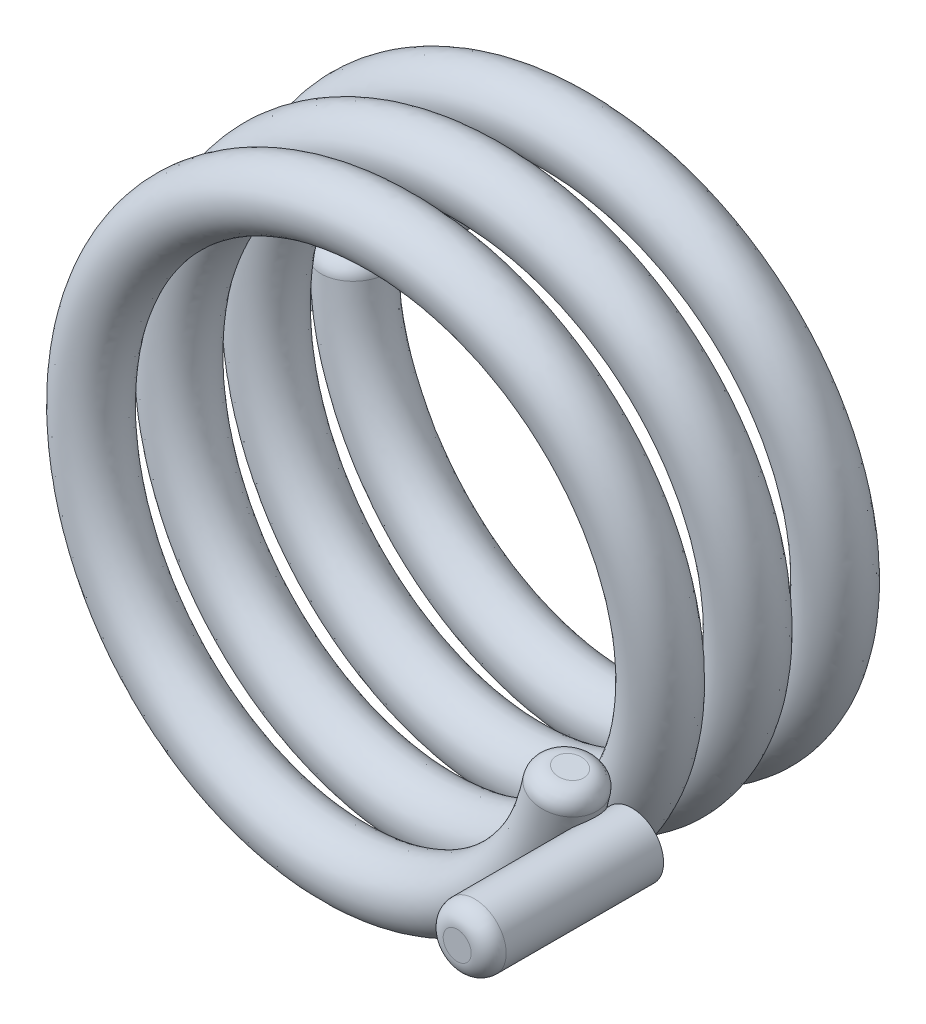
ISO-10303-21;
HEADER;
FILE_DESCRIPTION(('STEP AP214'),'2;1');
FILE_NAME('part.step','',(''),(''),'','','');
FILE_SCHEMA(('AUTOMOTIVE_DESIGN { 1 0 10303 214 1 1 1 1 }'));
ENDSEC;
DATA;
#1=APPLICATION_CONTEXT('core data for automotive mechanical design processes');
#2=APPLICATION_PROTOCOL_DEFINITION('international standard','automotive_design',2000,#1);
#3=PRODUCT_CONTEXT('',#1,'mechanical');
#4=PRODUCT('Part','Part','',(#3));
#5=PRODUCT_RELATED_PRODUCT_CATEGORY('part','',(#4));
#6=PRODUCT_DEFINITION_FORMATION('','',#4);
#7=PRODUCT_DEFINITION_CONTEXT('part definition',#1,'design');
#8=PRODUCT_DEFINITION('design','',#6,#7);
#9=PRODUCT_DEFINITION_SHAPE('','',#8);
#10=(LENGTH_UNIT() NAMED_UNIT(*) SI_UNIT(.MILLI.,.METRE.));
#11=(NAMED_UNIT(*) PLANE_ANGLE_UNIT() SI_UNIT($,.RADIAN.));
#12=(NAMED_UNIT(*) SI_UNIT($,.STERADIAN.) SOLID_ANGLE_UNIT());
#13=UNCERTAINTY_MEASURE_WITH_UNIT(LENGTH_MEASURE(1.E-05),#10,'distance_accuracy_value','');
#14=(GEOMETRIC_REPRESENTATION_CONTEXT(3) GLOBAL_UNCERTAINTY_ASSIGNED_CONTEXT((#13)) GLOBAL_UNIT_ASSIGNED_CONTEXT((#10,
#11,#12)) REPRESENTATION_CONTEXT('',''));
#15=CARTESIAN_POINT('',(0.,0.,0.));
#16=DIRECTION('',(0.,0.,1.));
#17=DIRECTION('',(1.,0.,0.));
#18=AXIS2_PLACEMENT_3D('',#15,#16,#17);
#19=CARTESIAN_POINT('',(-7.5,0.,0.899999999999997));
#20=CARTESIAN_POINT('',(-7.46217785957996,-0.56677797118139,0.930070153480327));
#21=CARTESIAN_POINT('',(-7.38640817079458,-1.70221319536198,0.990310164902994));
#22=CARTESIAN_POINT('',(-6.79371583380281,-3.3187660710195,1.080716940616));
#23=CARTESIAN_POINT('',(-5.87690301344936,-4.76478406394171,1.1711049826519));
#24=CARTESIAN_POINT('',(-4.65114333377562,-5.9644187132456,1.26146192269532));
#25=CARTESIAN_POINT('',(-3.18976654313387,-6.8596617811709,1.35181170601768));
#26=CARTESIAN_POINT('',(-1.56287897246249,-7.40058968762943,1.44219600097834));
#27=CARTESIAN_POINT('',(0.143549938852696,-7.56373611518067,1.53255203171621));
#28=CARTESIAN_POINT('',(1.84272054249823,-7.33604205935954,1.62290986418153));
#29=CARTESIAN_POINT('',(3.44745563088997,-6.73337849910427,1.71329092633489));
#30=CARTESIAN_POINT('',(4.87502476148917,-5.78411749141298,1.80363534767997));
#31=CARTESIAN_POINT('',(6.05179611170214,-4.537644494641,1.89402031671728));
#32=CARTESIAN_POINT('',(6.91903850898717,-3.0588772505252,1.98436751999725));
#33=CARTESIAN_POINT('',(7.42884732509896,-1.42215024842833,2.07474300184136));
#34=CARTESIAN_POINT('',(7.55962543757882,0.287076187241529,2.16510570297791));
#35=CARTESIAN_POINT('',(7.29979129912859,1.98163249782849,2.25546257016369));
#36=CARTESIAN_POINT('',(6.66669545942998,3.57460962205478,2.34584268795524));
#37=CARTESIAN_POINT('',(5.69058357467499,4.9839524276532,2.43618721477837));
#38=CARTESIAN_POINT('',(4.42194601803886,6.13680081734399,2.52657238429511));
#39=CARTESIAN_POINT('',(2.92701960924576,6.97586930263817,2.61692009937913));
#40=CARTESIAN_POINT('',(1.28089768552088,7.45450113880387,2.70729434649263));
#41=CARTESIAN_POINT('',(-0.430498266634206,7.55279085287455,2.79765849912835));
#42=CARTESIAN_POINT('',(-2.11983006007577,7.26089915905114,2.88801409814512));
#43=CARTESIAN_POINT('',(-3.70047427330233,6.59761188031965,2.97839508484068));
#44=CARTESIAN_POINT('',(-5.09108660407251,5.59499996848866,3.06873928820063));
#45=CARTESIAN_POINT('',(-6.21959553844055,4.30465687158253,3.15912417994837));
#46=CARTESIAN_POINT('',(-7.03018465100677,2.79410527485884,3.24947272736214));
#47=CARTESIAN_POINT('',(-7.47747179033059,1.13918418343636,3.33984573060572));
#48=CARTESIAN_POINT('',(-7.5432332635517,-0.57376423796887,3.43021126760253));
#49=CARTESIAN_POINT('',(-7.21939255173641,-2.25726564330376,3.52056564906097));
#50=CARTESIAN_POINT('',(-6.52615206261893,-3.82500437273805,3.61094744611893));
#51=CARTESIAN_POINT('',(-5.49739940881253,-5.19638759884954,3.70129140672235));
#52=CARTESIAN_POINT('',(-4.18581899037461,-6.30015050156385,3.79167593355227));
#53=CARTESIAN_POINT('',(-2.66018264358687,-7.08196511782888,3.88202538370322));
#54=CARTESIAN_POINT('',(-0.997060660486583,-7.49775123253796,3.97239710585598));
#55=CARTESIAN_POINT('',(0.716822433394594,-7.53095603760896,4.06276402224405));
#56=CARTESIAN_POINT('',(2.39388974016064,-7.17528623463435,4.15311723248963));
#57=CARTESIAN_POINT('',(3.9481551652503,-6.45234197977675,4.24349976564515));
#58=CARTESIAN_POINT('',(5.29981732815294,-5.39781692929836,4.33384356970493));
#59=CARTESIAN_POINT('',(6.37843685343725,-4.06547517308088,4.42422764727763));
#60=CARTESIAN_POINT('',(7.13119182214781,-2.52530003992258,4.5145780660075));
#61=CARTESIAN_POINT('',(7.51533218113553,-0.854578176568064,4.60494847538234));
#62=CARTESIAN_POINT('',(7.51596378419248,0.85962121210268,4.69531676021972));
#63=CARTESIAN_POINT('',(7.12859592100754,2.52965316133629,4.78566885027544));
#64=CARTESIAN_POINT('',(6.37620838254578,4.06988238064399,4.87605204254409));
#65=CARTESIAN_POINT('',(5.29628829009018,5.40133836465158,4.96639577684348));
#66=CARTESIAN_POINT('',(3.94366875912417,6.45442657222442,5.05677932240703));
#67=CARTESIAN_POINT('',(2.38950614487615,7.17784679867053,5.14713077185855));
#68=CARTESIAN_POINT('',(0.71178792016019,7.53020831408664,5.23749984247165));
#69=CARTESIAN_POINT('',(-1.00210903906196,7.4982620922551,5.32786947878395));
#70=CARTESIAN_POINT('',(-2.66450701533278,7.07933825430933,5.41822050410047));
#71=CARTESIAN_POINT('',(-4.19014227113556,6.29777885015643,5.50860427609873));
#72=CARTESIAN_POINT('',(-5.50091395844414,5.19284996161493,5.59894802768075));
#73=CARTESIAN_POINT('',(-6.52809246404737,3.82044360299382,5.68933096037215));
#74=CARTESIAN_POINT('',(-7.22191300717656,2.2528499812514,5.77968349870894));
#75=CARTESIAN_POINT('',(-7.5423742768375,0.568741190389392,5.87005121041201));
#76=CARTESIAN_POINT('',(-7.47785752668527,-1.14423450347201,5.96042217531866));
#77=CARTESIAN_POINT('',(-7.02753080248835,-2.7984027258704,6.05077219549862));
#78=CARTESIAN_POINT('',(-6.21708178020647,-4.30889162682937,6.14115646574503));
#79=CARTESIAN_POINT('',(-5.08753911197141,-5.59850805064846,6.23150032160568));
#80=CARTESIAN_POINT('',(-3.69584405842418,-6.59940817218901,6.32188256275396));
#81=CARTESIAN_POINT('',(-2.11538089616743,-7.26337433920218,6.41223624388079));
#82=CARTESIAN_POINT('',(-0.425489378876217,-7.55182568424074,6.50260258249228));
#83=CARTESIAN_POINT('',(1.28594633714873,-7.45475762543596,6.59297484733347));
#84=CARTESIAN_POINT('',(2.93129204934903,-6.97319205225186,6.68332392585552));
#85=CARTESIAN_POINT('',(4.42608779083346,-6.13414637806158,6.773708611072));
#86=CARTESIAN_POINT('',(5.69408528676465,-4.98039359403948,6.8640526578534));
#87=CARTESIAN_POINT('',(6.66834818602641,-3.56991496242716,6.95443413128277));
#88=CARTESIAN_POINT('',(7.30221562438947,-1.9771485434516,7.04478900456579));
#89=CARTESIAN_POINT('',(7.55855912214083,-0.282083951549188,7.13515396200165));
#90=CARTESIAN_POINT('',(7.42897089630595,1.42719343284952,7.22552749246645));
#91=CARTESIAN_POINT('',(6.91634140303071,3.06312709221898,7.31587569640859));
#92=CARTESIAN_POINT('',(6.04900264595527,4.54168867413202,7.40626071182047));
#93=CARTESIAN_POINT('',(4.8714519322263,5.78761102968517,7.49660503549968));
#94=CARTESIAN_POINT('',(3.44270161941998,6.73488785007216,7.5869856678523));
#95=CARTESIAN_POINT('',(1.83820286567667,7.33842263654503,7.67734177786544));
#96=CARTESIAN_POINT('',(0.138576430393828,7.56257214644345,7.7677053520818));
#97=CARTESIAN_POINT('',(-1.56792486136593,7.40050681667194,7.85808010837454));
#98=CARTESIAN_POINT('',(-3.19386033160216,6.85699916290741,7.94842750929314));
#99=CARTESIAN_POINT('',(-4.65565276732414,5.9616813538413,8.03881276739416));
#100=CARTESIAN_POINT('',(-5.87905137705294,4.76075334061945,8.12915744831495));
#101=CARTESIAN_POINT('',(-6.7990034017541,3.3142498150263,8.21953718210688));
#102=CARTESIAN_POINT('',(-7.3719818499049,1.6985939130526,8.30989457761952));
#103=CARTESIAN_POINT('',(-7.56386358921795,-0.00498157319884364,8.40025670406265));
#104=CARTESIAN_POINT('',(-7.36937663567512,-1.7080897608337,8.49063267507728));
#105=CARTESIAN_POINT('',(-6.79518361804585,-3.32344369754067,8.58097959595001));
#106=CARTESIAN_POINT('',(-5.87221459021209,-4.76793989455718,8.6713646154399));
#107=CARTESIAN_POINT('',(-4.6483472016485,-5.9683841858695,8.76170922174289));
#108=CARTESIAN_POINT('',(-3.18459694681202,-6.8606550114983,8.85208987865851));
#109=CARTESIAN_POINT('',(-1.5583611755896,-7.40283487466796,8.94244824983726));
#110=CARTESIAN_POINT('',(0.148510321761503,-7.56255829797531,9.03280369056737));
#111=CARTESIAN_POINT('',(1.84779024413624,-7.33560141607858,9.12318850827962));
#112=CARTESIAN_POINT('',(3.4512356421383,-6.7304760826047,9.21353803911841));
#113=CARTESIAN_POINT('',(4.87980640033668,-5.78139817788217,9.30389490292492));
#114=CARTESIAN_POINT('',(6.05188576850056,-4.53332341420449,9.3942832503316));
#115=CARTESIAN_POINT('',(6.9363225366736,-3.05597249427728,9.48468956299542));
#116=CARTESIAN_POINT('',(7.22362730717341,-1.95494146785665,9.54492979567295));
#117=CARTESIAN_POINT('',(7.36704161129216,-1.40533834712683,9.57499999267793));
#118=CARTESIAN_POINT('',(-5.70000000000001,0.,0.899999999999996));
#119=CARTESIAN_POINT('',(-5.67106009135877,-0.430942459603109,0.930144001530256));
#120=CARTESIAN_POINT('',(-5.6130843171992,-1.29425626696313,0.990531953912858));
#121=CARTESIAN_POINT('',(-5.16354158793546,-2.52193630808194,1.08009769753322));
#122=CARTESIAN_POINT('',(-4.46566061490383,-3.62200969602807,1.17126345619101));
#123=CARTESIAN_POINT('',(-3.53662987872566,-4.53139822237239,1.26115247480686));
#124=CARTESIAN_POINT('',(-2.42206657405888,-5.21452974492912,1.35197561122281));
#125=CARTESIAN_POINT('',(-1.18866788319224,-5.62379152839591,1.44188003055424));
#126=CARTESIAN_POINT('',(0.108815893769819,-5.74875782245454,1.53245404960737));
#127=CARTESIAN_POINT('',(1.40157689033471,-5.57471395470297,1.62298748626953));
#128=CARTESIAN_POINT('',(2.61814817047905,-5.1184441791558,1.71281641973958));
#129=CARTESIAN_POINT('',(3.70682203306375,-4.39431046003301,1.80390234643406));
#130=CARTESIAN_POINT('',(4.59780952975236,-3.45029354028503,1.89354906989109));
#131=CARTESIAN_POINT('',(5.25945724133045,-2.32306589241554,1.98455488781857));
#132=CARTESIAN_POINT('',(5.64533080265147,-1.08147103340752,2.07450995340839));
#133=CARTESIAN_POINT('',(5.74562303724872,0.217765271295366,2.16492525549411));
#134=CARTESIAN_POINT('',(5.54713721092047,1.50723406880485,2.2555559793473));
#135=CARTESIAN_POINT('',(5.067817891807,2.71473371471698,2.34537121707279));
#136=CARTESIAN_POINT('',(4.32318512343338,3.78961743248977,2.43645754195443));
#137=CARTESIAN_POINT('',(3.36233006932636,4.66246291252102,2.52610741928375));
#138=CARTESIAN_POINT('',(2.22294212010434,5.30258906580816,2.61709179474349));
#139=CARTESIAN_POINT('',(0.973981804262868,5.66485851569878,2.70708520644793));
#140=CARTESIAN_POINT('',(-0.326575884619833,5.74043967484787,2.79744682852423));
#141=CARTESIAN_POINT('',(-1.61238036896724,5.51753896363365,2.88812792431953));
#142=CARTESIAN_POINT('',(-2.81035034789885,5.01536029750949,2.97791436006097));
#143=CARTESIAN_POINT('',(-3.8710367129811,4.2505132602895,3.06901242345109));
#144=CARTESIAN_POINT('',(-4.72544127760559,3.27314916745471,3.15867013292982));
#145=CARTESIAN_POINT('',(-5.34380801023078,2.12202420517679,3.24962600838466));
#146=CARTESIAN_POINT('',(-5.68234370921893,0.866141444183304,3.33966009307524));
#147=CARTESIAN_POINT('',(-5.73319200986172,-0.435278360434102,3.42997049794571));
#148=CARTESIAN_POINT('',(-5.48595176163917,-1.71693988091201,3.5206987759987));
#149=CARTESIAN_POINT('',(-4.96109345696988,-2.90496234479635,3.61045896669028));
#150=CARTESIAN_POINT('',(-4.17631413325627,-3.95105550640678,3.70156591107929));
#151=CARTESIAN_POINT('',(-3.18278348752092,-4.78672030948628,3.79123407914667));
#152=CARTESIAN_POINT('',(-2.02035001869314,-5.38309970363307,3.88215876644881));
#153=CARTESIAN_POINT('',(-0.757988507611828,-5.6977803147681,3.97223504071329));
#154=CARTESIAN_POINT('',(0.543833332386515,-5.72388199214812,4.06249572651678));
#155=CARTESIAN_POINT('',(1.82087487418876,-5.45238723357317,4.15326853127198));
#156=CARTESIAN_POINT('',(2.99853539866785,-4.90503668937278,4.24300509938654));
#157=CARTESIAN_POINT('',(4.02964505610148,-4.10061484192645,4.33411797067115));
#158=CARTESIAN_POINT('',(4.84627763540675,-3.09126547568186,4.4237992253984));
#159=CARTESIAN_POINT('',(5.42045024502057,-1.91795650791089,4.51469005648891));
#160=CARTESIAN_POINT('',(5.7111627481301,-0.649561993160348,4.60481002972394));
#161=CARTESIAN_POINT('',(5.71251259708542,0.652201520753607,4.69502249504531));
#162=CARTESIAN_POINT('',(5.41685774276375,1.92414785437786,4.78583716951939));
#163=CARTESIAN_POINT('',(4.84720992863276,3.09103552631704,4.8755527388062));
#164=CARTESIAN_POINT('',(4.02344301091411,4.10677714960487,4.96666858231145));
#165=CARTESIAN_POINT('',(2.99862800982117,4.9040915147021,5.05636555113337));
#166=CARTESIAN_POINT('',(1.8148808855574,5.45584643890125,5.14721986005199));
#167=CARTESIAN_POINT('',(0.54090099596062,5.72248616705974,5.23738503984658));
#168=CARTESIAN_POINT('',(-0.76034370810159,5.69908755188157,5.32755078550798));
#169=CARTESIAN_POINT('',(-2.026721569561,5.3793763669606,5.41840466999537));
#170=CARTESIAN_POINT('',(-3.1824291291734,4.78763375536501,5.50810186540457));
#171=CARTESIAN_POINT('',(-4.18242410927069,3.94482679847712,5.59921772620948));
#172=CARTESIAN_POINT('',(-4.96014083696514,2.90490437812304,5.68893303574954));
#173=CARTESIAN_POINT('',(-5.4892758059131,1.71116060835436,5.77974815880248));
#174=CARTESIAN_POINT('',(-5.73174647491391,0.432044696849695,5.86996005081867));
#175=CARTESIAN_POINT('',(-5.68361133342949,-0.868220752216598,5.96008057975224));
#176=CARTESIAN_POINT('',(-5.33995689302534,-2.12855902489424,6.05097101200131));
#177=CARTESIAN_POINT('',(-4.72632938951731,-3.27268300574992,6.14065245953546));
#178=CARTESIAN_POINT('',(-3.86479488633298,-4.25655880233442,6.23176538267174));
#179=CARTESIAN_POINT('',(-2.81012826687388,-5.01440512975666,6.32150165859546));
#180=CARTESIAN_POINT('',(-1.6068333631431,-5.52072658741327,6.41227493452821));
#181=CARTESIAN_POINT('',(-0.323032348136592,-5.7389403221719,6.50253504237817));
#182=CARTESIAN_POINT('',(0.975793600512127,-5.66608916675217,6.59261185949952));
#183=CARTESIAN_POINT('',(2.22962349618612,-5.29861381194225,6.68353617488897));
#184=CARTESIAN_POINT('',(3.36176436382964,-4.66331868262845,6.77320450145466));
#185=CARTESIAN_POINT('',(4.32915465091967,-3.78337646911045,6.86431153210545));
#186=CARTESIAN_POINT('',(5.06686456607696,-2.7143337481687,6.9540713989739));
#187=CARTESIAN_POINT('',(5.55018774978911,-1.5019370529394,7.04480016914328));
#188=CARTESIAN_POINT('',(5.74406510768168,-0.213903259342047,7.13510999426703));
#189=CARTESIAN_POINT('',(5.64652702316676,1.08302330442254,7.22514460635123));
#190=CARTESIAN_POINT('',(5.25536231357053,2.32987854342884,7.31610013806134));
#191=CARTESIAN_POINT('',(4.59862410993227,3.44964083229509,7.4057579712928));
#192=CARTESIAN_POINT('',(3.70060124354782,4.40018564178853,7.49685615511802));
#193=CARTESIAN_POINT('',(2.61755526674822,5.11749997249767,7.58664223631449));
#194=CARTESIAN_POINT('',(1.39650978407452,5.57764898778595,7.67732384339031));
#195=CARTESIAN_POINT('',(0.104696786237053,5.74711897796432,7.76768488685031));
#196=CARTESIAN_POINT('',(-1.18987104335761,5.62493162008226,7.85767880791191));
#197=CARTESIAN_POINT('',(-2.42928802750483,5.21021828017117,7.94866286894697));
#198=CARTESIAN_POINT('',(-3.53628044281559,4.53226876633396,8.03831283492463));
#199=CARTESIAN_POINT('',(-4.46962636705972,3.61649940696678,8.12939931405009));
#200=CARTESIAN_POINT('',(-5.16629286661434,2.51982762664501,8.21921416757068));
#201=CARTESIAN_POINT('',(-5.60310047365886,1.29058978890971,8.3098454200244));
#202=CARTESIAN_POINT('',(-5.74810113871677,-0.00454797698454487,8.40026014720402));
#203=CARTESIAN_POINT('',(-5.60131120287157,-1.29629724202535,8.49021570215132));
#204=CARTESIAN_POINT('',(-5.16319637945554,-2.52781401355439,8.58122123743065));
#205=CARTESIAN_POINT('',(-4.4642722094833,-3.62165913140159,8.67086801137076));
#206=CARTESIAN_POINT('',(-3.53111143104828,-4.53745866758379,8.76195412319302));
#207=CARTESIAN_POINT('',(-2.42121500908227,-5.21319256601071,8.85178265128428));
#208=CARTESIAN_POINT('',(-1.18413856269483,-5.62651563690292,8.94231662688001));
#209=CARTESIAN_POINT('',(0.113879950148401,-5.74711169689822,9.03289005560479));
#210=CARTESIAN_POINT('',(1.40196628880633,-5.57575373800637,9.12279499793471));
#211=CARTESIAN_POINT('',(2.62499565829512,-5.11399374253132,9.21361788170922));
#212=CARTESIAN_POINT('',(3.70770529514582,-4.39441672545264,9.30350682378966));
#213=CARTESIAN_POINT('',(4.59990416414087,-3.44513444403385,9.3946728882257));
#214=CARTESIAN_POINT('',(5.27085811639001,-2.32294152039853,9.48423816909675));
#215=CARTESIAN_POINT('',(5.48969150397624,-1.48587808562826,9.5446263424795));
#216=CARTESIAN_POINT('',(5.59892685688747,-1.06804001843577,9.57477038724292));
#217=CARTESIAN_POINT('',(-5.70000000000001,0.,-0.899999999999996));
#218=CARTESIAN_POINT('',(-5.67099330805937,-0.430913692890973,-0.869856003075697));
#219=CARTESIAN_POINT('',(-5.61288374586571,-1.29416987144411,-0.809468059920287));
#220=CARTESIAN_POINT('',(-5.16407843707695,-2.52224027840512,-0.719902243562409));
#221=CARTESIAN_POINT('',(-4.46554628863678,-3.62190580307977,-0.628736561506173));
#222=CARTESIAN_POINT('',(-3.53682862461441,-4.53163465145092,-0.538847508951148));
#223=CARTESIAN_POINT('',(-2.42196049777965,-5.21440070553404,-0.448024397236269));
#224=CARTESIAN_POINT('',(-1.18878023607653,-5.62409066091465,-0.358119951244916));
#225=CARTESIAN_POINT('',(0.108878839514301,-5.74885550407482,-0.267545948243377));
#226=CARTESIAN_POINT('',(1.40151030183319,-5.57465309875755,-0.1770125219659));
#227=CARTESIAN_POINT('',(2.61839672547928,-5.11884871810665,-0.0871835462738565));
#228=CARTESIAN_POINT('',(3.70664982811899,-4.39411153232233,0.00390233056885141));
#229=CARTESIAN_POINT('',(4.59817652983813,-3.45058659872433,0.0935491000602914));
#230=CARTESIAN_POINT('',(5.25930646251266,-2.32295026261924,0.184554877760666));
#231=CARTESIAN_POINT('',(5.64554964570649,-1.08156789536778,0.274509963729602));
#232=CARTESIAN_POINT('',(5.74580169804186,0.217834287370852,0.364925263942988));
#233=CARTESIAN_POINT('',(5.54706152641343,1.50716654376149,0.455555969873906));
#234=CARTESIAN_POINT('',(5.0682168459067,2.71498442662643,0.545371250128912));
#235=CARTESIAN_POINT('',(4.32298463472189,3.78944207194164,0.636457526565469));
#236=CARTESIAN_POINT('',(3.36261512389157,4.66282843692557,0.726107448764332));
#237=CARTESIAN_POINT('',(2.22283290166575,5.30245146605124,0.817091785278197));
#238=CARTESIAN_POINT('',(0.974072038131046,5.6650555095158,0.907085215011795));
#239=CARTESIAN_POINT('',(-0.32664943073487,5.74064806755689,0.997446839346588));
#240=CARTESIAN_POINT('',(-1.61230828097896,5.51744439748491,1.08812791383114));
#241=CARTESIAN_POINT('',(-2.81061009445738,5.01576403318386,1.17791439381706));
#242=CARTESIAN_POINT('',(-3.87085839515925,4.25031159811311,1.26901240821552));
#243=CARTESIAN_POINT('',(-4.72580127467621,3.27342388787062,1.35867016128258));
#244=CARTESIAN_POINT('',(-5.34368626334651,2.12192201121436,1.44962599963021));
#245=CARTESIAN_POINT('',(-5.68251915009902,0.866225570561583,1.53966009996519));
#246=CARTESIAN_POINT('',(-5.7334279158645,-0.43535714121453,1.6299705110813));
#247=CARTESIAN_POINT('',(-5.48583948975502,-1.7168629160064,1.72069876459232));
#248=CARTESIAN_POINT('',(-4.96150051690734,-2.90523060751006,1.81045900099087));
#249=CARTESIAN_POINT('',(-4.1761123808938,-3.95087509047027,1.90156589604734));
#250=CARTESIAN_POINT('',(-3.18304742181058,-4.78707351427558,1.99123410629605));
#251=CARTESIAN_POINT('',(-2.02025492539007,-5.3829953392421,2.08215875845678));
#252=CARTESIAN_POINT('',(-0.75806703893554,-5.697934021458,2.17223504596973));
#253=CARTESIAN_POINT('',(0.543918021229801,-5.72414373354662,2.26249574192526));
#254=CARTESIAN_POINT('',(1.82079279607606,-5.45225843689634,2.35326851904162));
#255=CARTESIAN_POINT('',(2.99881154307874,-4.905445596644,2.44300513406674));
#256=CARTESIAN_POINT('',(4.02946348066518,-4.10041405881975,2.53411795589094));
#257=CARTESIAN_POINT('',(4.84662278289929,-3.0915182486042,2.62379925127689));
#258=CARTESIAN_POINT('',(5.42036482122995,-1.91786852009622,2.71469004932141));
#259=CARTESIAN_POINT('',(5.71129456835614,-0.649635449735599,2.80481003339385));
#260=CARTESIAN_POINT('',(5.71279850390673,0.652292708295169,2.89502251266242));
#261=CARTESIAN_POINT('',(5.41671361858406,1.92406049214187,2.98583715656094));
#262=CARTESIAN_POINT('',(4.84761926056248,3.09131885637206,3.07555277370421));
#263=CARTESIAN_POINT('',(4.02324421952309,4.10659542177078,3.16666856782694));
#264=CARTESIAN_POINT('',(2.99886931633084,4.90442733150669,3.2563655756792));
#265=CARTESIAN_POINT('',(1.81479993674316,5.45578154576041,3.34721985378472));
#266=CARTESIAN_POINT('',(0.540969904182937,5.72259597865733,3.4373850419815));
#267=CARTESIAN_POINT('',(-0.760441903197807,5.69939596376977,3.52755080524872));
#268=CARTESIAN_POINT('',(-2.02662881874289,5.37921812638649,3.61840465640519));
#269=CARTESIAN_POINT('',(-3.18271889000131,4.78804214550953,3.7081019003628));
#270=CARTESIAN_POINT('',(-4.18224330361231,3.94463098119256,3.79921771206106));
#271=CARTESIAN_POINT('',(-4.96046604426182,2.90513398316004,3.88893305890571));
#272=CARTESIAN_POINT('',(-5.48923306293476,1.71108655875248,3.97974815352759));
#273=CARTESIAN_POINT('',(-5.73183418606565,0.432109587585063,4.0699600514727));
#274=CARTESIAN_POINT('',(-5.68394060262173,-0.86832638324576,4.16008060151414));
#275=CARTESIAN_POINT('',(-5.33978575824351,-2.12846084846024,4.25097099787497));
#276=CARTESIAN_POINT('',(-4.72673552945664,-3.27297838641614,4.34065249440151));
#277=CARTESIAN_POINT('',(-3.86460298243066,-4.25638005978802,4.43176536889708));
#278=CARTESIAN_POINT('',(-2.81034600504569,-5.01471844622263,4.52150168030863));
#279=CARTESIAN_POINT('',(-1.6067659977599,-5.52070764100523,4.61227493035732));
#280=CARTESIAN_POINT('',(-0.323093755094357,-5.73900587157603,4.70253504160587));
#281=CARTESIAN_POINT('',(0.97590701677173,-5.66643766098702,4.79261188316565));
#282=CARTESIAN_POINT('',(2.2295199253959,-5.29843101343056,4.88353616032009));
#283=CARTESIAN_POINT('',(3.36206450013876,-4.66372132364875,4.97320453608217));
#284=CARTESIAN_POINT('',(4.32897917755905,-3.78318937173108,5.06431151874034));
#285=CARTESIAN_POINT('',(5.06716471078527,-2.71453952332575,5.15407141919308));
#286=CARTESIAN_POINT('',(5.5501942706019,-1.50187607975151,5.24480016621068));
#287=CARTESIAN_POINT('',(5.74410846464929,-0.2139617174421,5.33510999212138));
#288=CARTESIAN_POINT('',(5.64689312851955,1.08314477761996,5.42514463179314));
#289=CARTESIAN_POINT('',(5.25516908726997,2.32976967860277,5.51610012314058));
#290=CARTESIAN_POINT('',(4.59902206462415,3.44994480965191,5.60575800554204));
#291=CARTESIAN_POINT('',(3.70041979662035,4.40001470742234,5.6968561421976));
#292=CARTESIAN_POINT('',(2.61774905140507,5.11778566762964,5.78664225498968));
#293=CARTESIAN_POINT('',(1.39645483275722,5.57768266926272,5.87732384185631));
#294=CARTESIAN_POINT('',(0.104752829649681,5.74714014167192,5.96768488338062));
#295=CARTESIAN_POINT('',(-1.19000076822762,5.62531373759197,6.05767883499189));
#296=CARTESIAN_POINT('',(-2.42917404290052,5.21001587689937,6.14866285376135));
#297=CARTESIAN_POINT('',(-3.53658730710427,4.53266092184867,6.23831286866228));
#298=CARTESIAN_POINT('',(-4.46946124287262,3.61632433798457,6.32939930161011));
#299=CARTESIAN_POINT('',(-5.16656282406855,2.52000947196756,6.4192141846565));
#300=CARTESIAN_POINT('',(-5.60316354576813,1.29054056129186,6.5098454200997));
#301=CARTESIAN_POINT('',(-5.74809963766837,-0.00449389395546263,6.60026014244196));
#302=CARTESIAN_POINT('',(-5.60170650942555,-1.2964350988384,6.69021573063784));
#303=CARTESIAN_POINT('',(-5.1629891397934,-2.52769640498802,6.78122122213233));
#304=CARTESIAN_POINT('',(-4.46465823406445,-3.62196848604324,6.87086804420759));
#305=CARTESIAN_POINT('',(-3.53093398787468,-4.53729039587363,6.96195411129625));
#306=CARTESIAN_POINT('',(-2.42138919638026,-5.21345001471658,7.05178266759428));
#307=CARTESIAN_POINT('',(-1.18410616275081,-5.62665806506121,7.14231663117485));
#308=CARTESIAN_POINT('',(0.113830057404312,-5.74702838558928,7.23289004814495));
#309=CARTESIAN_POINT('',(1.40210317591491,-5.57612485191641,7.32279502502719));
#310=CARTESIAN_POINT('',(2.62495012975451,-5.11393045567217,7.41361787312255));
#311=CARTESIAN_POINT('',(3.70794764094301,-4.39471712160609,7.50350684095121));
#312=CARTESIAN_POINT('',(4.59961899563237,-3.44487406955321,7.59467288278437));
#313=CARTESIAN_POINT('',(5.2712513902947,-2.32315747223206,7.68423819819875));
#314=CARTESIAN_POINT('',(5.48997289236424,-1.48597868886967,7.74462636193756));
#315=CARTESIAN_POINT('',(5.59915239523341,-1.06808304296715,7.77477040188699));
#316=CARTESIAN_POINT('',(-7.5,0.,-0.899999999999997));
#317=CARTESIAN_POINT('',(-7.46211107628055,-0.566749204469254,-0.869929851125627));
#318=CARTESIAN_POINT('',(-7.38620759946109,-1.70212679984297,-0.809689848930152));
#319=CARTESIAN_POINT('',(-6.7942526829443,-3.31907004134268,-0.719283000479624));
#320=CARTESIAN_POINT('',(-5.8767886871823,-4.7646801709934,-0.628895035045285));
#321=CARTESIAN_POINT('',(-4.65134207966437,-5.96465514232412,-0.538538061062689));
#322=CARTESIAN_POINT('',(-3.18966046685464,-6.85953274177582,-0.448188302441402));
#323=CARTESIAN_POINT('',(-1.56299132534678,-7.40088882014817,-0.357803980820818));
#324=CARTESIAN_POINT('',(0.143612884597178,-7.56383379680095,-0.267447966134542));
#325=CARTESIAN_POINT('',(1.84265395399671,-7.33598120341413,-0.177090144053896));
#326=CARTESIAN_POINT('',(3.44770418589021,-6.73378303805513,-0.0867090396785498));
#327=CARTESIAN_POINT('',(4.87485255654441,-5.7839185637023,0.00363533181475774));
#328=CARTESIAN_POINT('',(6.05216311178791,-4.5379375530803,0.0940203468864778));
#329=CARTESIAN_POINT('',(6.91888773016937,-3.0587616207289,0.184367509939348));
#330=CARTESIAN_POINT('',(7.42906616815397,-1.42224711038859,0.274743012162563));
#331=CARTESIAN_POINT('',(7.55980409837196,0.287145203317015,0.365105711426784));
#332=CARTESIAN_POINT('',(7.29971561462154,1.98156497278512,0.455462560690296));
#333=CARTESIAN_POINT('',(6.66709441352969,3.57486033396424,0.545842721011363));
#334=CARTESIAN_POINT('',(5.69038308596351,4.98377706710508,0.63618719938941));
#335=CARTESIAN_POINT('',(4.42223107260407,6.13716634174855,0.726572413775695));
#336=CARTESIAN_POINT('',(2.92691039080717,6.97573170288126,0.816920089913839));
#337=CARTESIAN_POINT('',(1.28098791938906,7.45469813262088,0.907294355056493));
#338=CARTESIAN_POINT('',(-0.430571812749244,7.55299924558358,0.997658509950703));
#339=CARTESIAN_POINT('',(-2.11975797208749,7.2608045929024,1.08801408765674));
#340=CARTESIAN_POINT('',(-3.70073401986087,6.59801561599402,1.17839511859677));
#341=CARTESIAN_POINT('',(-5.09090828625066,5.59479830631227,1.26873927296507));
#342=CARTESIAN_POINT('',(-6.21995553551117,4.30493159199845,1.35912420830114));
#343=CARTESIAN_POINT('',(-7.03006290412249,2.79400308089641,1.44947271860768));
#344=CARTESIAN_POINT('',(-7.47764723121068,1.13926830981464,1.53984573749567));
#345=CARTESIAN_POINT('',(-7.54346916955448,-0.573843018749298,1.63021128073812));
#346=CARTESIAN_POINT('',(-7.21928027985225,-2.25718867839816,1.72056563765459));
#347=CARTESIAN_POINT('',(-6.52655912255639,-3.82527263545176,1.81094748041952));
#348=CARTESIAN_POINT('',(-5.49719765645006,-5.19620718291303,1.90129139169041));
#349=CARTESIAN_POINT('',(-4.18608292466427,-6.30050370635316,1.99167596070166));
#350=CARTESIAN_POINT('',(-2.6600875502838,-7.08186075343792,2.08202537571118));
#351=CARTESIAN_POINT('',(-0.997139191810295,-7.49790493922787,2.17239711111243));
#352=CARTESIAN_POINT('',(0.716907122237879,-7.53121777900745,2.26276403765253));
#353=CARTESIAN_POINT('',(2.39380766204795,-7.17515743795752,2.35311722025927));
#354=CARTESIAN_POINT('',(3.94843130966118,-6.45275088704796,2.44349980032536));
#355=CARTESIAN_POINT('',(5.29963575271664,-5.39761614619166,2.53384355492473));
#356=CARTESIAN_POINT('',(6.37878200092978,-4.06572794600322,2.62422767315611));
#357=CARTESIAN_POINT('',(7.13110639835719,-2.5252120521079,2.71457805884));
#358=CARTESIAN_POINT('',(7.51546400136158,-0.854651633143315,2.80494847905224));
#359=CARTESIAN_POINT('',(7.51624969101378,0.859712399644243,2.89531677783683));
#360=CARTESIAN_POINT('',(7.12845179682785,2.5295657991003,2.98566883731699));
#361=CARTESIAN_POINT('',(6.37661771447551,4.07016571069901,3.07605207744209));
#362=CARTESIAN_POINT('',(5.29608949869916,5.40115663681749,3.16639576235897));
#363=CARTESIAN_POINT('',(3.94391006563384,6.45476238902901,3.25677934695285));
#364=CARTESIAN_POINT('',(2.38942519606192,7.17778190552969,3.34713076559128));
#365=CARTESIAN_POINT('',(0.711856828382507,7.53031812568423,3.43749984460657));
#366=CARTESIAN_POINT('',(-1.00220723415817,7.4985705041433,3.5278694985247));
#367=CARTESIAN_POINT('',(-2.66441426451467,7.07918001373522,3.61822049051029));
#368=CARTESIAN_POINT('',(-4.19043203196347,6.29818724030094,3.70860431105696));
#369=CARTESIAN_POINT('',(-5.50073315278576,5.19265414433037,3.79894801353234));
#370=CARTESIAN_POINT('',(-6.52841767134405,3.82067320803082,3.88933098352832));
#371=CARTESIAN_POINT('',(-7.22187026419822,2.25277593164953,3.97968349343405));
#372=CARTESIAN_POINT('',(-7.54246198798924,0.56880608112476,4.07005121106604));
#373=CARTESIAN_POINT('',(-7.47818679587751,-1.14434013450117,4.16042219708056));
#374=CARTESIAN_POINT('',(-7.02735966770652,-2.7983045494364,4.25077218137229));
#375=CARTESIAN_POINT('',(-6.2174879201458,-4.30918700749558,4.34115650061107));
#376=CARTESIAN_POINT('',(-5.08734720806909,-5.59832930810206,4.43150030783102));
#377=CARTESIAN_POINT('',(-3.69606179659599,-6.59972148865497,4.52188258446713));
#378=CARTESIAN_POINT('',(-2.11531353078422,-7.26335539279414,4.6122362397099));
#379=CARTESIAN_POINT('',(-0.425550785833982,-7.55189123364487,4.70260258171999));
#380=CARTESIAN_POINT('',(1.28605975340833,-7.45510611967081,4.7929748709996));
#381=CARTESIAN_POINT('',(2.9311884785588,-6.97300925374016,4.88332391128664));
#382=CARTESIAN_POINT('',(4.42638792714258,-6.13454901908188,4.9737086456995));
#383=CARTESIAN_POINT('',(5.69390981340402,-4.98020649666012,5.0640526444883));
#384=CARTESIAN_POINT('',(6.66864833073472,-3.57012073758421,5.15443415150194));
#385=CARTESIAN_POINT('',(7.30222214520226,-1.97708757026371,5.24478900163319));
#386=CARTESIAN_POINT('',(7.55860247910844,-0.282142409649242,5.33515395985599));
#387=CARTESIAN_POINT('',(7.42933700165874,1.42731490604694,5.42552751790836));
#388=CARTESIAN_POINT('',(6.91614817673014,3.0630182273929,5.51587568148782));
#389=CARTESIAN_POINT('',(6.04940060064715,4.54199265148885,5.60626074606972));
#390=CARTESIAN_POINT('',(4.87127048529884,5.78744009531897,5.69660502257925));
#391=CARTESIAN_POINT('',(3.44289540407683,6.73517354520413,5.78698568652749));
#392=CARTESIAN_POINT('',(1.83814791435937,7.33845631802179,5.87734177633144));
#393=CARTESIAN_POINT('',(0.138632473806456,7.56259331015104,5.96770534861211));
#394=CARTESIAN_POINT('',(-1.56805458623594,7.40088893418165,6.05808013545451));
#395=CARTESIAN_POINT('',(-3.19374634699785,6.85679675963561,6.14842749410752));
#396=CARTESIAN_POINT('',(-4.65595963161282,5.96207350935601,6.23881280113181));
#397=CARTESIAN_POINT('',(-5.87888625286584,4.76057827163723,6.32915743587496));
#398=CARTESIAN_POINT('',(-6.79927335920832,3.31443166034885,6.4195371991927));
#399=CARTESIAN_POINT('',(-7.37204492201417,1.69854468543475,6.50989457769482));
#400=CARTESIAN_POINT('',(-7.56386208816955,-0.00492749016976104,6.60025669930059));
#401=CARTESIAN_POINT('',(-7.3697719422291,-1.70822761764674,6.69063270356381));
#402=CARTESIAN_POINT('',(-6.79497637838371,-3.3233260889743,6.7809795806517));
#403=CARTESIAN_POINT('',(-5.87260061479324,-4.76824924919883,6.87136464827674));
#404=CARTESIAN_POINT('',(-4.6481697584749,-5.96821591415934,6.96170920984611));
#405=CARTESIAN_POINT('',(-3.18477113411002,-6.86091246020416,7.05208989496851));
#406=CARTESIAN_POINT('',(-1.55832877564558,-7.40297730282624,7.1424482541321));
#407=CARTESIAN_POINT('',(0.148460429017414,-7.56247498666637,7.23280368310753));
#408=CARTESIAN_POINT('',(1.84792713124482,-7.33597252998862,7.32318853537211));
#409=CARTESIAN_POINT('',(3.45119011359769,-6.73041279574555,7.41353803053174));
#410=CARTESIAN_POINT('',(4.88004874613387,-5.78169857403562,7.50389492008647));
#411=CARTESIAN_POINT('',(6.05160059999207,-4.53306303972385,7.59428324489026));
#412=CARTESIAN_POINT('',(6.93671581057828,-3.05618844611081,7.68468959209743));
#413=CARTESIAN_POINT('',(7.22390869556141,-1.95504207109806,7.74492981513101));
#414=CARTESIAN_POINT('',(7.36726714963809,-1.40538137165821,7.77500000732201));
#415=CARTESIAN_POINT('',(-9.29999999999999,0.,-0.899999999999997));
#416=CARTESIAN_POINT('',(-9.25322884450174,-0.702584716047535,-0.870003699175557));
#417=CARTESIAN_POINT('',(-9.15953145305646,-2.11008372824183,-0.809911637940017));
#418=CARTESIAN_POINT('',(-8.42442692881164,-4.11589980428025,-0.718663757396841));
#419=CARTESIAN_POINT('',(-7.28803108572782,-5.90745453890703,-0.629053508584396));
#420=CARTESIAN_POINT('',(-5.76585553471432,-7.39767563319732,-0.538228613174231));
#421=CARTESIAN_POINT('',(-3.95736043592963,-8.50466477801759,-0.448352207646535));
#422=CARTESIAN_POINT('',(-1.93720241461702,-9.17768697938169,-0.357488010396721));
#423=CARTESIAN_POINT('',(0.178346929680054,-9.37881208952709,-0.267349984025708));
#424=CARTESIAN_POINT('',(2.28379760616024,-9.0973093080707,-0.177167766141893));
#425=CARTESIAN_POINT('',(4.27701164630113,-8.3487173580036,-0.0862345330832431));
#426=CARTESIAN_POINT('',(6.04305528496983,-7.17372559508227,0.00336833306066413));
#427=CARTESIAN_POINT('',(7.50614969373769,-5.62528850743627,0.094491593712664));
#428=CARTESIAN_POINT('',(8.57846899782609,-3.79457297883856,0.184180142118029));
#429=CARTESIAN_POINT('',(9.21258269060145,-1.76292632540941,0.274976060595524));
#430=CARTESIAN_POINT('',(9.37380649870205,0.356456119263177,0.365286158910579));
#431=CARTESIAN_POINT('',(9.05236970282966,2.45596340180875,0.455369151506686));
#432=CARTESIAN_POINT('',(8.26597198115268,4.43473624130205,0.546314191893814));
#433=CARTESIAN_POINT('',(7.05778153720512,6.17811206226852,0.635916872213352));
#434=CARTESIAN_POINT('',(5.48184702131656,7.61150424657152,0.727037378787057));
#435=CARTESIAN_POINT('',(3.6309878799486,8.64901193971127,0.816748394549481));
#436=CARTESIAN_POINT('',(1.58790380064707,9.24434075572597,0.90750349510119));
#437=CARTESIAN_POINT('',(-0.534494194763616,9.36535042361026,0.997870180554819));
#438=CARTESIAN_POINT('',(-2.62720766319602,9.00416478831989,1.08790026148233));
#439=CARTESIAN_POINT('',(-4.59085794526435,8.18026719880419,1.17887584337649));
#440=CARTESIAN_POINT('',(-6.31095817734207,6.93928501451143,1.26846613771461));
#441=CARTESIAN_POINT('',(-7.71410979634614,5.33643929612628,1.3595782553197));
#442=CARTESIAN_POINT('',(-8.71643954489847,3.46608415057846,1.44931943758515));
#443=CARTESIAN_POINT('',(-9.27277531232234,1.4123110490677,1.54003137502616));
#444=CARTESIAN_POINT('',(-9.35351042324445,-0.712328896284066,1.63045205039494));
#445=CARTESIAN_POINT('',(-8.95272106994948,-2.79751444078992,1.72043251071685));
#446=CARTESIAN_POINT('',(-8.09161772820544,-4.74531466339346,1.81143595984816));
#447=CARTESIAN_POINT('',(-6.81828293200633,-6.44153927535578,1.90101688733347));
#448=CARTESIAN_POINT('',(-5.18911842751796,-7.81393389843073,1.99211781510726));
#449=CARTESIAN_POINT('',(-3.29992017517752,-8.78072616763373,2.08189199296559));
#450=CARTESIAN_POINT('',(-1.23621134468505,-9.29787585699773,2.17255917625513));
#451=CARTESIAN_POINT('',(0.889896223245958,-9.33829182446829,2.26303233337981));
#452=CARTESIAN_POINT('',(2.96682252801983,-8.89805643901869,2.35296592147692));
#453=CARTESIAN_POINT('',(4.89805107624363,-8.00005617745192,2.44399446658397));
#454=CARTESIAN_POINT('',(6.5698080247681,-6.69481823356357,2.53356915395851));
#455=CARTESIAN_POINT('',(7.91094121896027,-5.03993764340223,2.62465609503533));
#456=CARTESIAN_POINT('',(8.84184797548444,-3.13255558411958,2.71446606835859));
#457=CARTESIAN_POINT('',(9.31963343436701,-1.05966781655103,2.80508692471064));
#458=CARTESIAN_POINT('',(9.31970087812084,1.06713209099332,2.89561104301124));
#459=CARTESIAN_POINT('',(8.84018997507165,3.13507110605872,2.98550051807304));
#460=CARTESIAN_POINT('',(7.90561616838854,5.04901256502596,3.07655138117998));
#461=CARTESIAN_POINT('',(6.56893477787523,6.6957178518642,3.166122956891));
#462=CARTESIAN_POINT('',(4.88895081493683,8.00509744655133,3.25719311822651));
#463=CARTESIAN_POINT('',(2.96405045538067,8.89978226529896,3.34704167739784));
#464=CARTESIAN_POINT('',(0.882743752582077,9.33804027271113,3.43761464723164));
#465=CARTESIAN_POINT('',(-1.24397256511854,9.29774504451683,3.52818819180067));
#466=CARTESIAN_POINT('',(-3.30219971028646,8.77914190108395,3.61803632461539));
#467=CARTESIAN_POINT('',(-5.19814517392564,7.80833233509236,3.70910672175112));
#468=CARTESIAN_POINT('',(-6.81922300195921,6.44067730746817,3.79867831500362));
#469=CARTESIAN_POINT('',(-8.09636929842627,4.7362124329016,3.88972890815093));
#470=CARTESIAN_POINT('',(-8.95450746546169,2.79446530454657,3.97961883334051));
#471=CARTESIAN_POINT('',(-9.35308978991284,0.705502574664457,4.07014237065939));
#472=CARTESIAN_POINT('',(-9.27243298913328,-1.42035388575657,4.16076379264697));
#473=CARTESIAN_POINT('',(-8.71493357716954,-3.46814825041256,4.2505733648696));
#474=CARTESIAN_POINT('',(-7.70824031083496,-5.34539562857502,4.34166050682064));
#475=CARTESIAN_POINT('',(-6.31009143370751,-6.94027855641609,4.43123524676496));
#476=CARTESIAN_POINT('',(-4.58177758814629,-8.18472453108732,4.52226348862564));
#477=CARTESIAN_POINT('',(-2.62386106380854,-9.00600314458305,4.61219754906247));
#478=CARTESIAN_POINT('',(-0.528007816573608,-9.36477659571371,4.70267012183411));
#479=CARTESIAN_POINT('',(1.59621249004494,-9.2437745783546,4.79333785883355));
#480=CARTESIAN_POINT('',(3.63285703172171,-8.64758749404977,4.88311166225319));
#481=CARTESIAN_POINT('',(5.4907113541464,-7.60537671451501,4.97421275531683));
#482=CARTESIAN_POINT('',(7.058840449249,-6.17722362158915,5.06379377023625));
#483=CARTESIAN_POINT('',(8.27013195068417,-4.42570195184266,5.15479688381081));
#484=CARTESIAN_POINT('',(9.05425001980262,-2.45229906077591,5.24477783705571));
#485=CARTESIAN_POINT('',(9.37309649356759,-0.350323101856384,5.3351979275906));
#486=CARTESIAN_POINT('',(9.21178087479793,1.77148503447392,5.42591040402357));
#487=CARTESIAN_POINT('',(8.57712726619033,3.79626677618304,5.51565123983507));
#488=CARTESIAN_POINT('',(7.49977913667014,5.63404049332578,5.60676348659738));
#489=CARTESIAN_POINT('',(6.04212117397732,7.17486548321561,5.69635390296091));
#490=CARTESIAN_POINT('',(4.26804175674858,8.35256142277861,5.78732911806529));
#491=CARTESIAN_POINT('',(2.27984099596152,9.09922996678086,5.87735971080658));
#492=CARTESIAN_POINT('',(0.172512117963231,9.37804647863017,5.9677258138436));
#493=CARTESIAN_POINT('',(-1.94610840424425,9.17646413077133,6.05848143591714));
#494=CARTESIAN_POINT('',(-3.95831865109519,8.50357764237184,6.14819213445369));
#495=CARTESIAN_POINT('',(-5.77533195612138,7.39148609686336,6.23931273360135));
#496=CARTESIAN_POINT('',(-7.28831126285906,5.90483220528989,6.32891557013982));
#497=CARTESIAN_POINT('',(-8.43198389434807,4.10885384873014,6.41986021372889));
#498=CARTESIAN_POINT('',(-9.14092629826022,2.10654880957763,6.50994373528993));
#499=CARTESIAN_POINT('',(-9.37962453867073,-0.00536108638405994,6.60025325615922));
#500=CARTESIAN_POINT('',(-9.13783737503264,-2.12002013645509,6.69104967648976));
#501=CARTESIAN_POINT('',(-8.42696361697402,-4.11895577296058,6.78073793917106));
#502=CARTESIAN_POINT('',(-7.28054299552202,-5.91453001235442,6.87186125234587));
#503=CARTESIAN_POINT('',(-5.76540552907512,-7.39914143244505,6.96146430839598));
#504=CARTESIAN_POINT('',(-3.94815307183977,-8.50837490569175,7.05239712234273));
#505=CARTESIAN_POINT('',(-1.93255138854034,-9.17929654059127,7.14257987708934));
#506=CARTESIAN_POINT('',(0.183090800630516,-9.37792158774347,7.23271731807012));
#507=CARTESIAN_POINT('',(2.29375108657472,-9.09582020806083,7.32358204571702));
#508=CARTESIAN_POINT('',(4.27743009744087,-8.34689513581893,7.41345818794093));
#509=CARTESIAN_POINT('',(6.05214985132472,-7.16868002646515,7.50428299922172));
#510=CARTESIAN_POINT('',(7.50358220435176,-5.6212520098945,7.59389360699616));
#511=CARTESIAN_POINT('',(8.60218023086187,-3.78921941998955,7.6851409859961));
#512=CARTESIAN_POINT('',(8.95784449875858,-2.42410545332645,7.74523326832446));
#513=CARTESIAN_POINT('',(9.13538190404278,-1.74267970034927,7.77522961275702));
#514=CARTESIAN_POINT('',(-9.29999999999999,0.,0.899999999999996));
#515=CARTESIAN_POINT('',(-9.25329562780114,-0.702613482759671,0.929996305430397));
#516=CARTESIAN_POINT('',(-9.15973202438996,-2.11017012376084,0.990088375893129));
#517=CARTESIAN_POINT('',(-8.42389007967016,-4.11559583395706,1.08133618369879));
#518=CARTESIAN_POINT('',(-7.28814541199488,-5.90755843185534,1.17094650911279));
#519=CARTESIAN_POINT('',(-5.76565678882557,-7.39743920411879,1.26177137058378));
#520=CARTESIAN_POINT('',(-3.95746651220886,-8.50479381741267,1.35164780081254));
#521=CARTESIAN_POINT('',(-1.93709006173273,-9.17738784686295,1.44251197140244));
#522=CARTESIAN_POINT('',(0.178283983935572,-9.37871440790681,1.53265001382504));
#523=CARTESIAN_POINT('',(2.28386419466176,-9.09737016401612,1.62283224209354));
#524=CARTESIAN_POINT('',(4.2767630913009,-8.34831281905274,1.7137654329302));
#525=CARTESIAN_POINT('',(6.04322748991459,-7.17392452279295,1.80336834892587));
#526=CARTESIAN_POINT('',(7.50578269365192,-5.62499544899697,1.89449156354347));
#527=CARTESIAN_POINT('',(8.57861977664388,-3.79468860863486,1.98418015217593));
#528=CARTESIAN_POINT('',(9.21236384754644,-1.76282946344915,2.07497605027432));
#529=CARTESIAN_POINT('',(9.37362783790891,0.356387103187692,2.1652861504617));
#530=CARTESIAN_POINT('',(9.05244538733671,2.45603092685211,2.25536916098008));
#531=CARTESIAN_POINT('',(8.26557302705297,4.43448552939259,2.34631415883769));
#532=CARTESIAN_POINT('',(7.0579820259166,6.17828742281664,2.43591688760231));
#533=CARTESIAN_POINT('',(5.48156196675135,7.61113872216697,2.52703734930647));
#534=CARTESIAN_POINT('',(3.63109709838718,8.64914953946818,2.61674840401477));
#535=CARTESIAN_POINT('',(1.58781356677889,9.24414376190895,2.70750348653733));
#536=CARTESIAN_POINT('',(-0.53442064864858,9.36514203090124,2.79787016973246));
#537=CARTESIAN_POINT('',(-2.6272797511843,9.00425935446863,2.88790027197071));
#538=CARTESIAN_POINT('',(-4.59059819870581,8.17986346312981,2.9788758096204));
#539=CARTESIAN_POINT('',(-6.31113649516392,6.93948667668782,3.06846615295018));
#540=CARTESIAN_POINT('',(-7.71374979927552,5.33616457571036,3.15957822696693));
#541=CARTESIAN_POINT('',(-8.71656129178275,3.46618634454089,3.24931944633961));
#542=CARTESIAN_POINT('',(-9.27259987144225,1.41222692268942,3.34003136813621));
#543=CARTESIAN_POINT('',(-9.35327451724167,-0.712250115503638,3.43045203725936));
#544=CARTESIAN_POINT('',(-8.95283334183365,-2.79759140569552,3.52043252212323));
#545=CARTESIAN_POINT('',(-8.09121066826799,-4.74504640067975,3.61143592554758));
#546=CARTESIAN_POINT('',(-6.81848468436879,-6.44171969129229,3.70101690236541));
#547=CARTESIAN_POINT('',(-5.1888544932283,-7.81358069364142,3.79211778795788));
#548=CARTESIAN_POINT('',(-3.30001526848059,-8.78083053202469,3.88189200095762));
#549=CARTESIAN_POINT('',(-1.23613281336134,-9.29772215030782,3.97255917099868));
#550=CARTESIAN_POINT('',(0.889811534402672,-9.33803008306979,4.06303231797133));
#551=CARTESIAN_POINT('',(2.96690460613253,-8.89818523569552,4.15296593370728));
#552=CARTESIAN_POINT('',(4.89777493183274,-7.9996472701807,4.24399443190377));
#553=CARTESIAN_POINT('',(6.5699896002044,-6.69501901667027,4.33356916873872));
#554=CARTESIAN_POINT('',(7.91059607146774,-5.03968487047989,4.42465606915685));
#555=CARTESIAN_POINT('',(8.84193339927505,-3.13264357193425,4.51446607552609));
#556=CARTESIAN_POINT('',(9.31950161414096,-1.05959435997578,4.60508692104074));
#557=CARTESIAN_POINT('',(9.31941497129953,1.06704090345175,4.69561102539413));
#558=CARTESIAN_POINT('',(8.84033409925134,3.13515846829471,4.78550053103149));
#559=CARTESIAN_POINT('',(7.90520683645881,5.04872923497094,4.87655134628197));
#560=CARTESIAN_POINT('',(6.56913356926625,6.69589957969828,4.96612297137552));
#561=CARTESIAN_POINT('',(4.88870950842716,8.00476162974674,5.05719309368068));
#562=CARTESIAN_POINT('',(2.9641314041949,8.8998471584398,5.14704168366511));
#563=CARTESIAN_POINT('',(0.88267484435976,9.33793046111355,5.23761464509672));
#564=CARTESIAN_POINT('',(-1.24387437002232,9.29743663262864,5.32818817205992));
#565=CARTESIAN_POINT('',(-3.30229246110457,8.77930014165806,5.41803633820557));
#566=CARTESIAN_POINT('',(-5.19785541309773,7.80792394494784,5.50910668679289));
#567=CARTESIAN_POINT('',(-6.81940380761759,6.44087312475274,5.59867832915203));
#568=CARTESIAN_POINT('',(-8.09604409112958,4.73598282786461,5.68972888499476));
#569=CARTESIAN_POINT('',(-8.95455020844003,2.79453935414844,5.7796188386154));
#570=CARTESIAN_POINT('',(-9.3530020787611,0.705437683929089,5.87014237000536));
#571=CARTESIAN_POINT('',(-9.27210371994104,-1.42024825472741,5.96076377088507));
#572=CARTESIAN_POINT('',(-8.71510471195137,-3.46824642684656,6.05057337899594));
#573=CARTESIAN_POINT('',(-7.70783417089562,-5.34510024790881,6.14166047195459));
#574=CARTESIAN_POINT('',(-6.31028333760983,-6.94045729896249,6.23123526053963));
#575=CARTESIAN_POINT('',(-4.58155984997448,-8.18441121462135,6.32226346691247));
#576=CARTESIAN_POINT('',(-2.62392842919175,-9.00602209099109,6.41219755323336));
#577=CARTESIAN_POINT('',(-0.527946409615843,-9.36471104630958,6.5026701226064));
#578=CARTESIAN_POINT('',(1.59609907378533,-9.24342608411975,6.59333783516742));
#579=CARTESIAN_POINT('',(3.63296060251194,-8.64777029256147,6.68311167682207));
#580=CARTESIAN_POINT('',(5.49041121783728,-7.6049740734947,6.77421272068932));
#581=CARTESIAN_POINT('',(7.05901592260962,-6.17741071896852,6.86379378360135));
#582=CARTESIAN_POINT('',(8.26983180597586,-4.42549617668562,6.95479686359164));
#583=CARTESIAN_POINT('',(9.05424349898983,-2.45236003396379,7.04477783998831));
#584=CARTESIAN_POINT('',(9.37305313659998,-0.35026464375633,7.13519792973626));
#585=CARTESIAN_POINT('',(9.21141476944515,1.77136356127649,7.22591037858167));
#586=CARTESIAN_POINT('',(8.57732049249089,3.79637564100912,7.31565125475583));
#587=CARTESIAN_POINT('',(7.49938118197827,5.63373651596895,7.40676345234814));
#588=CARTESIAN_POINT('',(6.04230262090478,7.17503641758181,7.49635391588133));
#589=CARTESIAN_POINT('',(4.26784797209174,8.35227572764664,7.5873290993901));
#590=CARTESIAN_POINT('',(2.27989594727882,9.0991962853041,7.67735971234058));
#591=CARTESIAN_POINT('',(0.172456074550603,9.37802531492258,7.76772581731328));
#592=CARTESIAN_POINT('',(-1.94597867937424,9.17608201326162,7.85848140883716));
#593=CARTESIAN_POINT('',(-3.95843263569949,8.50378004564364,7.94819214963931));
#594=CARTESIAN_POINT('',(-5.77502509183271,7.39109394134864,8.0393126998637));
#595=CARTESIAN_POINT('',(-7.28847638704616,5.90500727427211,8.1289155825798));
#596=CARTESIAN_POINT('',(-8.43171393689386,4.10867200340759,8.21986019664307));
#597=CARTESIAN_POINT('',(-9.14086322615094,2.10659803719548,8.30994373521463));
#598=CARTESIAN_POINT('',(-9.37962603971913,-0.00541516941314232,8.40025326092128));
#599=CARTESIAN_POINT('',(-9.13744206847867,-2.11988227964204,8.49104964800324));
#600=CARTESIAN_POINT('',(-8.42717085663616,-4.11907338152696,8.58073795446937));
#601=CARTESIAN_POINT('',(-7.28015697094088,-5.91422065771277,8.67186121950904));
#602=CARTESIAN_POINT('',(-5.76558297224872,-7.39930970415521,8.76146432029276));
#603=CARTESIAN_POINT('',(-3.94797888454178,-8.50811745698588,8.85239710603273));
#604=CARTESIAN_POINT('',(-1.93258378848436,-9.17915411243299,8.9425798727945));
#605=CARTESIAN_POINT('',(0.183140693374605,-9.37800489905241,9.03271732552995));
#606=CARTESIAN_POINT('',(2.29361419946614,-9.09544909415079,9.12358201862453));
#607=CARTESIAN_POINT('',(4.27747562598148,-8.34695842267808,9.21345819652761));
#608=CARTESIAN_POINT('',(6.05190750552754,-7.1683796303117,9.30428298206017));
#609=CARTESIAN_POINT('',(7.50386737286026,-5.62151238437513,9.39389361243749));
#610=CARTESIAN_POINT('',(8.60178695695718,-3.78900346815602,9.4851409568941));
#611=CARTESIAN_POINT('',(8.95756311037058,-2.42400485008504,9.54523324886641));
#612=CARTESIAN_POINT('',(9.13515636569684,-1.74263667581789,9.57522959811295));
#613=CARTESIAN_POINT('',(-7.5,0.,0.899999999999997));
#614=CARTESIAN_POINT('',(-7.46217785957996,-0.56677797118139,0.930070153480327));
#615=CARTESIAN_POINT('',(-7.38640817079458,-1.70221319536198,0.990310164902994));
#616=CARTESIAN_POINT('',(-6.79371583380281,-3.3187660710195,1.080716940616));
#617=CARTESIAN_POINT('',(-5.87690301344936,-4.76478406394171,1.1711049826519));
#618=CARTESIAN_POINT('',(-4.65114333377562,-5.9644187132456,1.26146192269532));
#619=CARTESIAN_POINT('',(-3.18976654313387,-6.8596617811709,1.35181170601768));
#620=CARTESIAN_POINT('',(-1.56287897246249,-7.40058968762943,1.44219600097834));
#621=CARTESIAN_POINT('',(0.143549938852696,-7.56373611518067,1.53255203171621));
#622=CARTESIAN_POINT('',(1.84272054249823,-7.33604205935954,1.62290986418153));
#623=CARTESIAN_POINT('',(3.44745563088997,-6.73337849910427,1.71329092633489));
#624=CARTESIAN_POINT('',(4.87502476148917,-5.78411749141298,1.80363534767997));
#625=CARTESIAN_POINT('',(6.05179611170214,-4.537644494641,1.89402031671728));
#626=CARTESIAN_POINT('',(6.91903850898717,-3.0588772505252,1.98436751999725));
#627=CARTESIAN_POINT('',(7.42884732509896,-1.42215024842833,2.07474300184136));
#628=CARTESIAN_POINT('',(7.55962543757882,0.287076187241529,2.16510570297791));
#629=CARTESIAN_POINT('',(7.29979129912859,1.98163249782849,2.25546257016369));
#630=CARTESIAN_POINT('',(6.66669545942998,3.57460962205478,2.34584268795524));
#631=CARTESIAN_POINT('',(5.69058357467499,4.9839524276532,2.43618721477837));
#632=CARTESIAN_POINT('',(4.42194601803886,6.13680081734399,2.52657238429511));
#633=CARTESIAN_POINT('',(2.92701960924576,6.97586930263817,2.61692009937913));
#634=CARTESIAN_POINT('',(1.28089768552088,7.45450113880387,2.70729434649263));
#635=CARTESIAN_POINT('',(-0.430498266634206,7.55279085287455,2.79765849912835));
#636=CARTESIAN_POINT('',(-2.11983006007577,7.26089915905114,2.88801409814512));
#637=CARTESIAN_POINT('',(-3.70047427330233,6.59761188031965,2.97839508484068));
#638=CARTESIAN_POINT('',(-5.09108660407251,5.59499996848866,3.06873928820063));
#639=CARTESIAN_POINT('',(-6.21959553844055,4.30465687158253,3.15912417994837));
#640=CARTESIAN_POINT('',(-7.03018465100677,2.79410527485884,3.24947272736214));
#641=CARTESIAN_POINT('',(-7.47747179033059,1.13918418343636,3.33984573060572));
#642=CARTESIAN_POINT('',(-7.5432332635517,-0.57376423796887,3.43021126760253));
#643=CARTESIAN_POINT('',(-7.21939255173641,-2.25726564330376,3.52056564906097));
#644=CARTESIAN_POINT('',(-6.52615206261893,-3.82500437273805,3.61094744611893));
#645=CARTESIAN_POINT('',(-5.49739940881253,-5.19638759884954,3.70129140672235));
#646=CARTESIAN_POINT('',(-4.18581899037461,-6.30015050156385,3.79167593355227));
#647=CARTESIAN_POINT('',(-2.66018264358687,-7.08196511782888,3.88202538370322));
#648=CARTESIAN_POINT('',(-0.997060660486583,-7.49775123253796,3.97239710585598));
#649=CARTESIAN_POINT('',(0.716822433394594,-7.53095603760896,4.06276402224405));
#650=CARTESIAN_POINT('',(2.39388974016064,-7.17528623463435,4.15311723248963));
#651=CARTESIAN_POINT('',(3.9481551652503,-6.45234197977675,4.24349976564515));
#652=CARTESIAN_POINT('',(5.29981732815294,-5.39781692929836,4.33384356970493));
#653=CARTESIAN_POINT('',(6.37843685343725,-4.06547517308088,4.42422764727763));
#654=CARTESIAN_POINT('',(7.13119182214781,-2.52530003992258,4.5145780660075));
#655=CARTESIAN_POINT('',(7.51533218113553,-0.854578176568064,4.60494847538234));
#656=CARTESIAN_POINT('',(7.51596378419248,0.85962121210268,4.69531676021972));
#657=CARTESIAN_POINT('',(7.12859592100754,2.52965316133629,4.78566885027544));
#658=CARTESIAN_POINT('',(6.37620838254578,4.06988238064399,4.87605204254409));
#659=CARTESIAN_POINT('',(5.29628829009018,5.40133836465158,4.96639577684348));
#660=CARTESIAN_POINT('',(3.94366875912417,6.45442657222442,5.05677932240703));
#661=CARTESIAN_POINT('',(2.38950614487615,7.17784679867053,5.14713077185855));
#662=CARTESIAN_POINT('',(0.71178792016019,7.53020831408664,5.23749984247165));
#663=CARTESIAN_POINT('',(-1.00210903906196,7.4982620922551,5.32786947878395));
#664=CARTESIAN_POINT('',(-2.66450701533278,7.07933825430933,5.41822050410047));
#665=CARTESIAN_POINT('',(-4.19014227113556,6.29777885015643,5.50860427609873));
#666=CARTESIAN_POINT('',(-5.50091395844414,5.19284996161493,5.59894802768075));
#667=CARTESIAN_POINT('',(-6.52809246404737,3.82044360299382,5.68933096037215));
#668=CARTESIAN_POINT('',(-7.22191300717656,2.2528499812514,5.77968349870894));
#669=CARTESIAN_POINT('',(-7.5423742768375,0.568741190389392,5.87005121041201));
#670=CARTESIAN_POINT('',(-7.47785752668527,-1.14423450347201,5.96042217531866));
#671=CARTESIAN_POINT('',(-7.02753080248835,-2.7984027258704,6.05077219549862));
#672=CARTESIAN_POINT('',(-6.21708178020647,-4.30889162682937,6.14115646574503));
#673=CARTESIAN_POINT('',(-5.08753911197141,-5.59850805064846,6.23150032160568));
#674=CARTESIAN_POINT('',(-3.69584405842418,-6.59940817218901,6.32188256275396));
#675=CARTESIAN_POINT('',(-2.11538089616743,-7.26337433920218,6.41223624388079));
#676=CARTESIAN_POINT('',(-0.425489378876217,-7.55182568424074,6.50260258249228));
#677=CARTESIAN_POINT('',(1.28594633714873,-7.45475762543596,6.59297484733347));
#678=CARTESIAN_POINT('',(2.93129204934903,-6.97319205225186,6.68332392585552));
#679=CARTESIAN_POINT('',(4.42608779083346,-6.13414637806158,6.773708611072));
#680=CARTESIAN_POINT('',(5.69408528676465,-4.98039359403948,6.8640526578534));
#681=CARTESIAN_POINT('',(6.66834818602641,-3.56991496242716,6.95443413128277));
#682=CARTESIAN_POINT('',(7.30221562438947,-1.9771485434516,7.04478900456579));
#683=CARTESIAN_POINT('',(7.55855912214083,-0.282083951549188,7.13515396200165));
#684=CARTESIAN_POINT('',(7.42897089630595,1.42719343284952,7.22552749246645));
#685=CARTESIAN_POINT('',(6.91634140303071,3.06312709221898,7.31587569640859));
#686=CARTESIAN_POINT('',(6.04900264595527,4.54168867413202,7.40626071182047));
#687=CARTESIAN_POINT('',(4.8714519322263,5.78761102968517,7.49660503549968));
#688=CARTESIAN_POINT('',(3.44270161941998,6.73488785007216,7.5869856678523));
#689=CARTESIAN_POINT('',(1.83820286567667,7.33842263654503,7.67734177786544));
#690=CARTESIAN_POINT('',(0.138576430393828,7.56257214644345,7.7677053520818));
#691=CARTESIAN_POINT('',(-1.56792486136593,7.40050681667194,7.85808010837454));
#692=CARTESIAN_POINT('',(-3.19386033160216,6.85699916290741,7.94842750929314));
#693=CARTESIAN_POINT('',(-4.65565276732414,5.9616813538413,8.03881276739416));
#694=CARTESIAN_POINT('',(-5.87905137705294,4.76075334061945,8.12915744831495));
#695=CARTESIAN_POINT('',(-6.7990034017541,3.3142498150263,8.21953718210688));
#696=CARTESIAN_POINT('',(-7.3719818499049,1.6985939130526,8.30989457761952));
#697=CARTESIAN_POINT('',(-7.56386358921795,-0.00498157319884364,8.40025670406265));
#698=CARTESIAN_POINT('',(-7.36937663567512,-1.7080897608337,8.49063267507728));
#699=CARTESIAN_POINT('',(-6.79518361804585,-3.32344369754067,8.58097959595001));
#700=CARTESIAN_POINT('',(-5.87221459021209,-4.76793989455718,8.6713646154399));
#701=CARTESIAN_POINT('',(-4.6483472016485,-5.9683841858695,8.76170922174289));
#702=CARTESIAN_POINT('',(-3.18459694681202,-6.8606550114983,8.85208987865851));
#703=CARTESIAN_POINT('',(-1.5583611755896,-7.40283487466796,8.94244824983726));
#704=CARTESIAN_POINT('',(0.148510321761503,-7.56255829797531,9.03280369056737));
#705=CARTESIAN_POINT('',(1.84779024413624,-7.33560141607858,9.12318850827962));
#706=CARTESIAN_POINT('',(3.4512356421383,-6.7304760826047,9.21353803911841));
#707=CARTESIAN_POINT('',(4.87980640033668,-5.78139817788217,9.30389490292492));
#708=CARTESIAN_POINT('',(6.05188576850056,-4.53332341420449,9.3942832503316));
#709=CARTESIAN_POINT('',(6.9363225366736,-3.05597249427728,9.48468956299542));
#710=CARTESIAN_POINT('',(7.22362730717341,-1.95494146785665,9.54492979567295));
#711=CARTESIAN_POINT('',(7.36704161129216,-1.40533834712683,9.57499999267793));
#712=(BOUNDED_SURFACE() B_SPLINE_SURFACE(3,3,((#19,#20,#21,#22,#23,#24,#25,#26,#27,#28,#29,#30,
#31,#32,#33,#34,#35,#36,#37,#38,#39,#40,#41,#42,#43,#44,#45,#46,#47,#48,#49,#50,#51,#52,#53,#54,
#55,#56,#57,#58,#59,#60,#61,#62,#63,#64,#65,#66,#67,#68,#69,#70,#71,#72,#73,#74,#75,#76,#77,#78,
#79,#80,#81,#82,#83,#84,#85,#86,#87,#88,#89,#90,#91,#92,#93,#94,#95,#96,#97,#98,#99,#100,#101,
#102,#103,#104,#105,#106,#107,#108,#109,#110,#111,#112,#113,#114,#115,#116,#117),(#118,#119,
#120,#121,#122,#123,#124,#125,#126,#127,#128,#129,#130,#131,#132,#133,#134,#135,#136,#137,#138,
#139,#140,#141,#142,#143,#144,#145,#146,#147,#148,#149,#150,#151,#152,#153,#154,#155,#156,#157,
#158,#159,#160,#161,#162,#163,#164,#165,#166,#167,#168,#169,#170,#171,#172,#173,#174,#175,#176,
#177,#178,#179,#180,#181,#182,#183,#184,#185,#186,#187,#188,#189,#190,#191,#192,#193,#194,#195,
#196,#197,#198,#199,#200,#201,#202,#203,#204,#205,#206,#207,#208,#209,#210,#211,#212,#213,#214,
#215,#216),(#217,#218,#219,#220,#221,#222,#223,#224,#225,#226,#227,#228,#229,#230,#231,#232,
#233,#234,#235,#236,#237,#238,#239,#240,#241,#242,#243,#244,#245,#246,#247,#248,#249,#250,#251,
#252,#253,#254,#255,#256,#257,#258,#259,#260,#261,#262,#263,#264,#265,#266,#267,#268,#269,#270,
#271,#272,#273,#274,#275,#276,#277,#278,#279,#280,#281,#282,#283,#284,#285,#286,#287,#288,#289,
#290,#291,#292,#293,#294,#295,#296,#297,#298,#299,#300,#301,#302,#303,#304,#305,#306,#307,#308,
#309,#310,#311,#312,#313,#314,#315),(#316,#317,#318,#319,#320,#321,#322,#323,#324,#325,#326,
#327,#328,#329,#330,#331,#332,#333,#334,#335,#336,#337,#338,#339,#340,#341,#342,#343,#344,#345,
#346,#347,#348,#349,#350,#351,#352,#353,#354,#355,#356,#357,#358,#359,#360,#361,#362,#363,#364,
#365,#366,#367,#368,#369,#370,#371,#372,#373,#374,#375,#376,#377,#378,#379,#380,#381,#382,#383,
#384,#385,#386,#387,#388,#389,#390,#391,#392,#393,#394,#395,#396,#397,#398,#399,#400,#401,#402,
#403,#404,#405,#406,#407,#408,#409,#410,#411,#412,#413,#414),(#415,#416,#417,#418,#419,#420,
#421,#422,#423,#424,#425,#426,#427,#428,#429,#430,#431,#432,#433,#434,#435,#436,#437,#438,#439,
#440,#441,#442,#443,#444,#445,#446,#447,#448,#449,#450,#451,#452,#453,#454,#455,#456,#457,#458,
#459,#460,#461,#462,#463,#464,#465,#466,#467,#468,#469,#470,#471,#472,#473,#474,#475,#476,#477,
#478,#479,#480,#481,#482,#483,#484,#485,#486,#487,#488,#489,#490,#491,#492,#493,#494,#495,#496,
#497,#498,#499,#500,#501,#502,#503,#504,#505,#506,#507,#508,#509,#510,#511,#512,#513),(#514,
#515,#516,#517,#518,#519,#520,#521,#522,#523,#524,#525,#526,#527,#528,#529,#530,#531,#532,#533,
#534,#535,#536,#537,#538,#539,#540,#541,#542,#543,#544,#545,#546,#547,#548,#549,#550,#551,#552,
#553,#554,#555,#556,#557,#558,#559,#560,#561,#562,#563,#564,#565,#566,#567,#568,#569,#570,#571,
#572,#573,#574,#575,#576,#577,#578,#579,#580,#581,#582,#583,#584,#585,#586,#587,#588,#589,#590,
#591,#592,#593,#594,#595,#596,#597,#598,#599,#600,#601,#602,#603,#604,#605,#606,#607,#608,#609,
#610,#611,#612),(#613,#614,#615,#616,#617,#618,#619,#620,#621,#622,#623,#624,#625,#626,#627,
#628,#629,#630,#631,#632,#633,#634,#635,#636,#637,#638,#639,#640,#641,#642,#643,#644,#645,#646,
#647,#648,#649,#650,#651,#652,#653,#654,#655,#656,#657,#658,#659,#660,#661,#662,#663,#664,#665,
#666,#667,#668,#669,#670,#671,#672,#673,#674,#675,#676,#677,#678,#679,#680,#681,#682,#683,#684,
#685,#686,#687,#688,#689,#690,#691,#692,#693,#694,#695,#696,#697,#698,#699,#700,#701,#702,#703,
#704,#705,#706,#707,#708,#709,#710,#711)),.UNSPECIFIED.,.T.,.F.,
.F.) B_SPLINE_SURFACE_WITH_KNOTS((4,3,4),(4,1,1,1,1,1,1,1,1,1,1,1,1,1,1,1,1,1,1,1,1,1,1,1,1,1,1,
1,1,1,1,1,1,1,1,1,1,1,1,1,1,1,1,1,1,1,1,1,1,1,1,1,1,1,1,1,1,1,1,1,1,1,1,1,1,1,1,1,1,1,1,1,1,1,1,
1,1,1,1,1,1,1,1,1,1,1,1,1,1,1,1,1,1,1,1,1,4),(0.,0.5,1.),(0.,0.010400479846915,
0.0208354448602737,0.0312524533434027,0.0416652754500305,0.0520831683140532,0.0624996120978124,
0.0729163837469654,0.0833333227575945,0.0937493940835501,0.10416682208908,0.114582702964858,
0.125000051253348,0.135416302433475,0.145833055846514,0.156250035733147,0.166666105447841,
0.177083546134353,0.187499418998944,0.19791674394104,0.208333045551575,0.218749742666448,
0.229166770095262,0.239582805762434,0.250000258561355,0.260416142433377,0.270833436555,
0.281249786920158,0.291666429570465,0.30208350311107,0.312499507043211,0.32291696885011,
0.333332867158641,0.343750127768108,0.354166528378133,0.364583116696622,0.375000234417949,
0.3854162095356,0.395833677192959,0.406249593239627,0.416666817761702,0.427083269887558,
0.437499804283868,0.447916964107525,0.458332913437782,0.468750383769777,0.479166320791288,
0.489583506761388,0.500000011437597,0.510416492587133,0.520833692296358,0.531249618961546,
0.541667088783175,0.552083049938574,0.562500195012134,0.572916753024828,0.583333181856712,
0.593750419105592,0.604166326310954,0.614583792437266,0.624999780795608,0.635416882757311,
0.645833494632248,0.656249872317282,0.666667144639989,0.677083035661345,0.687500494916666,
0.697916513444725,0.708333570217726,0.718750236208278,0.729166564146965,0.739583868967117,
0.749999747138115,0.760417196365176,0.770833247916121,0.781250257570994,0.791666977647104,
0.802083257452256,0.812500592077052,0.822916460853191,0.83333389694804,0.84374998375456,
0.854166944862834,0.864583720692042,0.874999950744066,0.885417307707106,0.895833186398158,
0.90625060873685,0.916666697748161,0.927083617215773,0.937500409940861,0.947916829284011,
0.958334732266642,0.968747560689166,0.979164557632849,0.989599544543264,1.),
.UNSPECIFIED.) GEOMETRIC_REPRESENTATION_ITEM() RATIONAL_B_SPLINE_SURFACE(((1.,1.,1.,1.,1.,1.,1.,
1.,1.,1.,1.,1.,1.,1.,1.,1.,1.,1.,1.,1.,1.,1.,1.,1.,1.,1.,1.,1.,1.,1.,1.,1.,1.,1.,1.,1.,1.,1.,1.,
1.,1.,1.,1.,1.,1.,1.,1.,1.,1.,1.,1.,1.,1.,1.,1.,1.,1.,1.,1.,1.,1.,1.,1.,1.,1.,1.,1.,1.,1.,1.,1.,
1.,1.,1.,1.,0.999999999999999,1.,1.,1.,1.,1.,1.,1.,1.,1.,1.,1.,1.,1.,1.,1.,1.,1.,1.,1.,1.,1.,1.,
1.),(0.333333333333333,0.333333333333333,0.333333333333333,0.333333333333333,0.333333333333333,
0.333333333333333,0.333333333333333,0.333333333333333,0.333333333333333,0.333333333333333,
0.333333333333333,0.333333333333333,0.333333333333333,0.333333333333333,0.333333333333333,
0.333333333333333,0.333333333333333,0.333333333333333,0.333333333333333,0.333333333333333,
0.333333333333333,0.333333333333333,0.333333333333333,0.333333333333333,0.333333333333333,
0.333333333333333,0.333333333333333,0.333333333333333,0.333333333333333,0.333333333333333,
0.333333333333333,0.333333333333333,0.333333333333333,0.333333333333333,0.333333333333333,
0.333333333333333,0.333333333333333,0.333333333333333,0.333333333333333,0.333333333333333,
0.333333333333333,0.333333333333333,0.333333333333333,0.333333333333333,0.333333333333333,
0.333333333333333,0.333333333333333,0.333333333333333,0.333333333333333,0.333333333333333,
0.333333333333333,0.333333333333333,0.333333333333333,0.333333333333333,0.333333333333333,
0.333333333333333,0.333333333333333,0.333333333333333,0.333333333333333,0.333333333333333,
0.333333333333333,0.333333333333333,0.333333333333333,0.333333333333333,0.333333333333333,
0.333333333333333,0.333333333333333,0.333333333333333,0.333333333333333,0.333333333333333,
0.333333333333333,0.333333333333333,0.333333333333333,0.333333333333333,0.333333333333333,
0.333333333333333,0.333333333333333,0.333333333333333,0.333333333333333,0.333333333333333,
0.333333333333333,0.333333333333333,0.333333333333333,0.333333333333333,0.333333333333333,
0.333333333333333,0.333333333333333,0.333333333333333,0.333333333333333,0.333333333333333,
0.333333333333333,0.333333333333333,0.333333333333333,0.333333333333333,0.333333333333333,
0.333333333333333,0.333333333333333,0.333333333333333,0.333333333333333),(0.333333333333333,
0.333333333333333,0.333333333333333,0.333333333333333,0.333333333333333,0.333333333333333,
0.333333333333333,0.333333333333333,0.333333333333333,0.333333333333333,0.333333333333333,
0.333333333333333,0.333333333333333,0.333333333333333,0.333333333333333,0.333333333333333,
0.333333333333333,0.333333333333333,0.333333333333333,0.333333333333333,0.333333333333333,
0.333333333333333,0.333333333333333,0.333333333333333,0.333333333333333,0.333333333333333,
0.333333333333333,0.333333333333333,0.333333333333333,0.333333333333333,0.333333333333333,
0.333333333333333,0.333333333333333,0.333333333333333,0.333333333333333,0.333333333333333,
0.333333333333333,0.333333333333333,0.333333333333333,0.333333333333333,0.333333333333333,
0.333333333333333,0.333333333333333,0.333333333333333,0.333333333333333,0.333333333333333,
0.333333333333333,0.333333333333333,0.333333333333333,0.333333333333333,0.333333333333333,
0.333333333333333,0.333333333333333,0.333333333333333,0.333333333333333,0.333333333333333,
0.333333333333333,0.333333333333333,0.333333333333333,0.333333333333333,0.333333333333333,
0.333333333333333,0.333333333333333,0.333333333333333,0.333333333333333,0.333333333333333,
0.333333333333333,0.333333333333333,0.333333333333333,0.333333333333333,0.333333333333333,
0.333333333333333,0.333333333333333,0.333333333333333,0.333333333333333,0.333333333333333,
0.333333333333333,0.333333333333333,0.333333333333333,0.333333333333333,0.333333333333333,
0.333333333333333,0.333333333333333,0.333333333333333,0.333333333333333,0.333333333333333,
0.333333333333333,0.333333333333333,0.333333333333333,0.333333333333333,0.333333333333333,
0.333333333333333,0.333333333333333,0.333333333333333,0.333333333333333,0.333333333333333,
0.333333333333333,0.333333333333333,0.333333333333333),(1.,1.,1.,1.,1.,1.,1.,1.,1.,1.,1.,1.,1.,
1.,1.,1.,1.,1.,1.,1.,1.,1.,1.,1.,1.,1.,1.,1.,1.,1.,1.,1.,1.,1.,1.,1.,1.,1.,1.,1.,1.,1.,1.,1.,1.,
1.,1.,1.,1.,1.,1.,1.,1.,1.,1.,1.,1.,1.,1.,1.,1.,1.,1.,1.,1.,1.,1.,1.,1.,1.,1.,1.,1.,1.,1.,
0.999999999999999,1.,1.,1.,1.,1.,1.,1.,1.,1.,1.,1.,1.,1.,1.,1.,1.,1.,1.,1.,1.,1.,1.,1.),
(0.333333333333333,0.333333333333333,0.333333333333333,0.333333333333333,0.333333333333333,
0.333333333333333,0.333333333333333,0.333333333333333,0.333333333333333,0.333333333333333,
0.333333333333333,0.333333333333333,0.333333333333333,0.333333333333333,0.333333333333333,
0.333333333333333,0.333333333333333,0.333333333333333,0.333333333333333,0.333333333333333,
0.333333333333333,0.333333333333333,0.333333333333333,0.333333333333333,0.333333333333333,
0.333333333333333,0.333333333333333,0.333333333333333,0.333333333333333,0.333333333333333,
0.333333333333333,0.333333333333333,0.333333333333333,0.333333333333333,0.333333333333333,
0.333333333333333,0.333333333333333,0.333333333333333,0.333333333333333,0.333333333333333,
0.333333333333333,0.333333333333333,0.333333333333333,0.333333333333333,0.333333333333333,
0.333333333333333,0.333333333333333,0.333333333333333,0.333333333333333,0.333333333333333,
0.333333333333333,0.333333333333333,0.333333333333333,0.333333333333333,0.333333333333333,
0.333333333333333,0.333333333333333,0.333333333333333,0.333333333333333,0.333333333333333,
0.333333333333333,0.333333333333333,0.333333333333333,0.333333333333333,0.333333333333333,
0.333333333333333,0.333333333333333,0.333333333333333,0.333333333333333,0.333333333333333,
0.333333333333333,0.333333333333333,0.333333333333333,0.333333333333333,0.333333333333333,
0.333333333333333,0.333333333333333,0.333333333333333,0.333333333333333,0.333333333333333,
0.333333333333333,0.333333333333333,0.333333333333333,0.333333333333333,0.333333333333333,
0.333333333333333,0.333333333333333,0.333333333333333,0.333333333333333,0.333333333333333,
0.333333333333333,0.333333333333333,0.333333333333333,0.333333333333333,0.333333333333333,
0.333333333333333,0.333333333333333,0.333333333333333,0.333333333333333),(0.333333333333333,
0.333333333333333,0.333333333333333,0.333333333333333,0.333333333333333,0.333333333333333,
0.333333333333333,0.333333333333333,0.333333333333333,0.333333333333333,0.333333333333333,
0.333333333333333,0.333333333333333,0.333333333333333,0.333333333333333,0.333333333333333,
0.333333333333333,0.333333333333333,0.333333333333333,0.333333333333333,0.333333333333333,
0.333333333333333,0.333333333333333,0.333333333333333,0.333333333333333,0.333333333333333,
0.333333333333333,0.333333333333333,0.333333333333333,0.333333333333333,0.333333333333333,
0.333333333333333,0.333333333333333,0.333333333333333,0.333333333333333,0.333333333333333,
0.333333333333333,0.333333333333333,0.333333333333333,0.333333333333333,0.333333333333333,
0.333333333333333,0.333333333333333,0.333333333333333,0.333333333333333,0.333333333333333,
0.333333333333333,0.333333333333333,0.333333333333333,0.333333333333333,0.333333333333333,
0.333333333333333,0.333333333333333,0.333333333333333,0.333333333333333,0.333333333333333,
0.333333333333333,0.333333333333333,0.333333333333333,0.333333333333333,0.333333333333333,
0.333333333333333,0.333333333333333,0.333333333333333,0.333333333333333,0.333333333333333,
0.333333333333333,0.333333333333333,0.333333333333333,0.333333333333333,0.333333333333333,
0.333333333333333,0.333333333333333,0.333333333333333,0.333333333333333,0.333333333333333,
0.333333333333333,0.333333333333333,0.333333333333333,0.333333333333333,0.333333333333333,
0.333333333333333,0.333333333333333,0.333333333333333,0.333333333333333,0.333333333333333,
0.333333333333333,0.333333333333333,0.333333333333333,0.333333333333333,0.333333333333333,
0.333333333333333,0.333333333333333,0.333333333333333,0.333333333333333,0.333333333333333,
0.333333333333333,0.333333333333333,0.333333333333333),(1.,1.,1.,1.,1.,1.,1.,1.,1.,1.,1.,1.,1.,
1.,1.,1.,1.,1.,1.,1.,1.,1.,1.,1.,1.,1.,1.,1.,1.,1.,1.,1.,1.,1.,1.,1.,1.,1.,1.,1.,1.,1.,1.,1.,1.,
1.,1.,1.,1.,1.,1.,1.,1.,1.,1.,1.,1.,1.,1.,1.,1.,1.,1.,1.,1.,1.,1.,1.,1.,1.,1.,1.,1.,1.,1.,
0.999999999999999,1.,1.,1.,1.,1.,1.,1.,1.,1.,1.,1.,1.,1.,1.,1.,1.,1.,1.,1.,1.,1.,1.,1.))) REPRESENTATION_ITEM('') SURFACE());
#713=CARTESIAN_POINT('',(6.94088428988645,-1.32404150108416,8.66746406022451));
#714=CARTESIAN_POINT('',(6.48684022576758,-1.2374247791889,8.69089250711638));
#715=CARTESIAN_POINT('',(6.36536150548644,-1.68401969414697,8.69269895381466));
#716=CARTESIAN_POINT('',(6.93976482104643,-1.32382794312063,8.64497887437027));
#717=CARTESIAN_POINT('',(6.48602649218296,-1.23726954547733,8.64234768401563));
#718=CARTESIAN_POINT('',(6.36330631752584,-1.68184273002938,8.6421418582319));
#719=CARTESIAN_POINT('',(6.94051738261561,-1.32397150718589,8.6223969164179));
#720=CARTESIAN_POINT('',(6.48907697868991,-1.23785147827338,8.59376023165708));
#721=CARTESIAN_POINT('',(6.3654201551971,-1.68064924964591,8.59136636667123));
#722=CARTESIAN_POINT('',(6.9457475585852,-1.32496925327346,8.57771697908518));
#723=CARTESIAN_POINT('',(6.50275975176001,-1.2404617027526,8.49800151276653));
#724=CARTESIAN_POINT('',(6.37792024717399,-1.68027876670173,8.49089825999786));
#725=CARTESIAN_POINT('',(6.95021986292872,-1.32582242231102,8.55561835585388));
#726=CARTESIAN_POINT('',(6.51336782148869,-1.24248537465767,8.45078712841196));
#727=CARTESIAN_POINT('',(6.38829470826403,-1.68109889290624,8.44120420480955));
#728=CARTESIAN_POINT('',(6.96274792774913,-1.32821236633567,8.51254517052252));
#729=CARTESIAN_POINT('',(6.54178276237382,-1.24790601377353,8.35892912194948));
#730=CARTESIAN_POINT('',(6.4169817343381,-1.68473523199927,8.34433120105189));
#731=CARTESIAN_POINT('',(6.97079694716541,-1.32974785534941,8.49156857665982));
#732=CARTESIAN_POINT('',(6.5595764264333,-1.25130046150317,8.31423731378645));
#733=CARTESIAN_POINT('',(6.43527936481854,-1.6875476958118,8.29714770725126));
#734=CARTESIAN_POINT('',(6.99023637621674,-1.33345626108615,8.45132335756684));
#735=CARTESIAN_POINT('',(6.60185090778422,-1.25936504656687,8.22845054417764));
#736=CARTESIAN_POINT('',(6.47926226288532,-1.69508773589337,8.20659937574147));
#737=CARTESIAN_POINT('',(7.00162204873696,-1.33562827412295,8.43205236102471));
#738=CARTESIAN_POINT('',(6.62633618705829,-1.26403603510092,8.1873092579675));
#739=CARTESIAN_POINT('',(6.50493705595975,-1.69981260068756,8.16322923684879));
#740=CARTESIAN_POINT('',(7.02740460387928,-1.34054674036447,8.39575122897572));
#741=CARTESIAN_POINT('',(6.68137541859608,-1.27453571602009,8.10956182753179));
#742=CARTESIAN_POINT('',(6.56293677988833,-1.711042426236,8.08149697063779));
#743=CARTESIAN_POINT('',(7.04179882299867,-1.34329268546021,8.37871913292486));
#744=CARTESIAN_POINT('',(6.71195004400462,-1.28036835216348,8.07291686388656));
#745=CARTESIAN_POINT('',(6.59525582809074,-1.71754581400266,8.04313046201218));
#746=CARTESIAN_POINT('',(7.0731727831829,-1.34927780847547,8.34738270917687));
#747=CARTESIAN_POINT('',(6.77841481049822,-1.29304765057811,8.00505069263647));
#748=CARTESIAN_POINT('',(6.6656022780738,-1.73213988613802,7.97249606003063));
#749=CARTESIAN_POINT('',(7.09014887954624,-1.35251629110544,8.33307459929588));
#750=CARTESIAN_POINT('',(6.81433286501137,-1.29989963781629,7.97379721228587));
#751=CARTESIAN_POINT('',(6.70362163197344,-1.74022833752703,7.94021971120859));
#752=CARTESIAN_POINT('',(7.12623596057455,-1.35940052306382,8.3075494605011));
#753=CARTESIAN_POINT('',(6.89072560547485,-1.31447286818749,7.91740749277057));
#754=CARTESIAN_POINT('',(6.78437734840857,-1.75777416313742,7.88258608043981));
#755=CARTESIAN_POINT('',(7.14534895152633,-1.36304665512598,8.29633537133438));
#756=CARTESIAN_POINT('',(6.93124576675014,-1.32220278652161,7.89226500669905));
#757=CARTESIAN_POINT('',(6.82711814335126,-1.76723282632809,7.85723537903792));
#758=CARTESIAN_POINT('',(7.18512124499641,-1.37063390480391,8.27734815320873));
#759=CARTESIAN_POINT('',(7.0158115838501,-1.33833517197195,7.84884893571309));
#760=CARTESIAN_POINT('',(6.91601708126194,-1.78722226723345,7.81425279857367));
#761=CARTESIAN_POINT('',(7.20577802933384,-1.37457454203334,8.26956955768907));
#762=CARTESIAN_POINT('',(7.05989441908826,-1.34674473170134,7.83056624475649));
#763=CARTESIAN_POINT('',(6.96216965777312,-1.79775130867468,7.7966086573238));
#764=CARTESIAN_POINT('',(7.2478104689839,-1.38259295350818,8.2577198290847));
#765=CARTESIAN_POINT('',(7.15002820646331,-1.36393930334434,7.80155180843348));
#766=CARTESIAN_POINT('',(7.05605415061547,-1.81944741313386,7.76965968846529));
#767=CARTESIAN_POINT('',(7.26917372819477,-1.38666836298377,8.25360305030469));
#768=CARTESIAN_POINT('',(7.19608771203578,-1.37272594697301,7.79074217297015));
#769=CARTESIAN_POINT('',(7.10375870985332,-1.83060472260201,7.76025221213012));
#770=CARTESIAN_POINT('',(7.3125691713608,-1.39494679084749,8.24898878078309));
#771=CARTESIAN_POINT('',(7.29024327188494,-1.3906877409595,7.77660395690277));
#772=CARTESIAN_POINT('',(7.20063732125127,-1.85351289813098,7.74959487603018));
#773=CARTESIAN_POINT('',(7.33460650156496,-1.39915079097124,8.24854128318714));
#774=CARTESIAN_POINT('',(7.33838845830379,-1.39987226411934,7.7734075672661));
#775=CARTESIAN_POINT('',(7.24982253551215,-1.86526977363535,7.7484577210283));
#776=CARTESIAN_POINT('',(7.37847901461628,-1.40752022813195,8.25140875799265));
#777=CARTESIAN_POINT('',(7.43497156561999,-1.41829715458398,7.77505143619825));
#778=CARTESIAN_POINT('',(7.34770905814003,-1.88890674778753,7.75468231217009));
#779=CARTESIAN_POINT('',(7.40031381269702,-1.41168559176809,8.25472981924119));
#780=CARTESIAN_POINT('',(7.48343137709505,-1.42754169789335,7.77994275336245));
#781=CARTESIAN_POINT('',(7.39640945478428,-1.90078701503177,7.76205781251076));
#782=CARTESIAN_POINT('',(7.44316510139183,-1.419860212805,8.26505540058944));
#783=CARTESIAN_POINT('',(7.57935831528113,-1.44584141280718,7.79786108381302));
#784=CARTESIAN_POINT('',(7.4919368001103,-1.92432271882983,7.78513793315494));
#785=CARTESIAN_POINT('',(7.4641801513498,-1.42386919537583,8.27206611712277));
#786=CARTESIAN_POINT('',(7.62683140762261,-1.45489772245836,7.81094565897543));
#787=CARTESIAN_POINT('',(7.5387604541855,-1.93597774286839,7.80085656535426));
#788=CARTESIAN_POINT('',(7.50476067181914,-1.43161062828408,8.28957354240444));
#789=CARTESIAN_POINT('',(7.7193689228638,-1.47255084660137,7.84510724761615));
#790=CARTESIAN_POINT('',(7.62911092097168,-1.9587022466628,7.84017526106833));
#791=CARTESIAN_POINT('',(7.52432602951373,-1.43534305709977,8.30007052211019));
#792=CARTESIAN_POINT('',(7.76442613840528,-1.48114628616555,7.86622965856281));
#793=CARTESIAN_POINT('',(7.67263747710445,-1.96977168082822,7.86377593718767));
#794=CARTESIAN_POINT('',(7.56148948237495,-1.44243262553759,8.32427386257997));
#795=CARTESIAN_POINT('',(7.8508758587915,-1.49763805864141,7.91612228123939));
#796=CARTESIAN_POINT('',(7.75522930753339,-1.99102524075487,7.91822261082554));
#797=CARTESIAN_POINT('',(7.57908378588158,-1.44578904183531,8.33798625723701));
#798=CARTESIAN_POINT('',(7.89223895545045,-1.50552878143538,7.94494720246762));
#799=CARTESIAN_POINT('',(7.79428598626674,-2.00120765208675,7.94908223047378));
#800=CARTESIAN_POINT('',(7.61176481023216,-1.45202350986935,8.36821851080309));
#801=CARTESIAN_POINT('',(7.96990394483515,-1.52034471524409,8.00958264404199));
#802=CARTESIAN_POINT('',(7.86673338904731,-2.02037432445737,8.0171232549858));
#803=CARTESIAN_POINT('',(7.62685165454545,-1.45490158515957,8.38473823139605));
#804=CARTESIAN_POINT('',(8.00617151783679,-1.52726337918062,8.04542410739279));
#805=CARTESIAN_POINT('',(7.9001243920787,-2.0293586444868,8.05430434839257));
#806=CARTESIAN_POINT('',(7.65411585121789,-1.46010270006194,8.42014593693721));
#807=CARTESIAN_POINT('',(8.07249953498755,-1.5399165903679,8.12326723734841));
#808=CARTESIAN_POINT('',(7.96035516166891,-2.04589474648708,8.13398148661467));
#809=CARTESIAN_POINT('',(7.66628841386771,-1.46242482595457,8.43903774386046));
#810=CARTESIAN_POINT('',(8.10250582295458,-1.54564080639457,8.16529666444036));
#811=CARTESIAN_POINT('',(7.98718414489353,-2.05344416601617,8.17648610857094));
#812=CARTESIAN_POINT('',(7.68734605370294,-1.46644193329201,8.47863202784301));
#813=CARTESIAN_POINT('',(8.15517080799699,-1.55568755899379,8.25433973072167));
#814=CARTESIAN_POINT('',(8.03346884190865,-2.06688777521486,8.26554343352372));
#815=CARTESIAN_POINT('',(7.69623146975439,-1.46813697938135,8.49933431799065));
#816=CARTESIAN_POINT('',(8.17778262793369,-1.56000115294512,8.30135532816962));
#817=CARTESIAN_POINT('',(8.0529253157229,-2.07278213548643,8.31209571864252));
#818=CARTESIAN_POINT('',(7.71047821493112,-1.47085479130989,8.54199979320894));
#819=CARTESIAN_POINT('',(8.21483601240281,-1.56706972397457,8.39911133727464));
#820=CARTESIAN_POINT('',(8.08396181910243,-2.08277233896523,8.40800928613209));
#821=CARTESIAN_POINT('',(7.7158326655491,-1.4718762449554,8.56396534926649));
#822=CARTESIAN_POINT('',(8.22921518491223,-1.56981279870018,8.44984444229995));
#823=CARTESIAN_POINT('',(8.09552647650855,-2.08686466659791,8.45737584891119));
#824=CARTESIAN_POINT('',(7.72282349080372,-1.47320986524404,8.60846173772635));
#825=CARTESIAN_POINT('',(8.2490823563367,-1.57360280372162,8.55334693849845));
#826=CARTESIAN_POINT('',(8.11037217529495,-2.09312317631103,8.55736171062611));
#827=CARTESIAN_POINT('',(7.72446955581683,-1.47352388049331,8.63099094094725));
#828=CARTESIAN_POINT('',(8.25455465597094,-1.57464673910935,8.60608277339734));
#829=CARTESIAN_POINT('',(8.11367480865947,-2.09529436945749,8.60797739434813));
#830=CARTESIAN_POINT('',(7.72418974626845,-1.47347050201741,8.65958084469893));
#831=CARTESIAN_POINT('',(8.25570245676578,-1.57486570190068,8.67329069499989));
#832=CARTESIAN_POINT('',(8.11259884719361,-2.09681027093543,8.67220801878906));
#833=CARTESIAN_POINT('',(7.72399166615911,-1.47343271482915,8.66569312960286));
#834=CARTESIAN_POINT('',(8.25560849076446,-1.57484777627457,8.68769311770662));
#835=CARTESIAN_POINT('',(8.11206138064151,-2.09706201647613,8.68593991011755));
#836=CARTESIAN_POINT('',(7.72242504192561,-1.47313385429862,8.6941419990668));
#837=CARTESIAN_POINT('',(8.25358225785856,-1.57446123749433,8.75487509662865));
#838=CARTESIAN_POINT('',(8.10812638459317,-2.09789698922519,8.74985376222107));
#839=CARTESIAN_POINT('',(7.71934479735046,-1.47254624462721,8.71641471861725));
#840=CARTESIAN_POINT('',(8.24742055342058,-1.57328578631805,8.80763310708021));
#841=CARTESIAN_POINT('',(8.10092398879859,-2.09758241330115,8.79989350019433));
#842=CARTESIAN_POINT('',(7.70955159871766,-1.4706780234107,8.7601578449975));
#843=CARTESIAN_POINT('',(8.22602910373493,-1.56920499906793,8.91155333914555));
#844=CARTESIAN_POINT('',(8.07845164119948,-2.0950187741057,8.89819106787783));
#845=CARTESIAN_POINT('',(7.70282924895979,-1.46939561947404,8.78162602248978));
#846=CARTESIAN_POINT('',(8.21076824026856,-1.56629372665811,8.96266309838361));
#847=CARTESIAN_POINT('',(8.06316082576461,-2.09276469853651,8.94644394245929));
#848=CARTESIAN_POINT('',(7.68594853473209,-1.46617533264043,8.82307099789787));
#849=CARTESIAN_POINT('',(8.1716002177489,-1.55882175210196,9.0614173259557));
#850=CARTESIAN_POINT('',(8.02494870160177,-2.08638993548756,9.03963435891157));
#851=CARTESIAN_POINT('',(7.67579673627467,-1.4642387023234,8.84305055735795));
#852=CARTESIAN_POINT('',(8.14771825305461,-1.55426585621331,9.10902142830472));
#853=CARTESIAN_POINT('',(8.0020419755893,-2.08227280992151,9.08457803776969));
#854=CARTESIAN_POINT('',(7.65232088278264,-1.45976027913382,8.88101390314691));
#855=CARTESIAN_POINT('',(8.09198635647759,-1.54363403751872,9.19933623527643));
#856=CARTESIAN_POINT('',(7.94917708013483,-2.07228088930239,9.17002348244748));
#857=CARTESIAN_POINT('',(7.63899229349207,-1.45721762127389,8.89899478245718));
#858=CARTESIAN_POINT('',(8.06014918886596,-1.53756054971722,9.241998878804));
#859=CARTESIAN_POINT('',(7.91920883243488,-2.06640357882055,9.2105187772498));
#860=CARTESIAN_POINT('',(7.60959978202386,-1.45161049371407,8.93235428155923));
#861=CARTESIAN_POINT('',(7.98968010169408,-1.52411735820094,9.32079486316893));
#862=CARTESIAN_POINT('',(7.85318736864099,-2.05308035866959,9.28570098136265));
#863=CARTESIAN_POINT('',(7.59354550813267,-1.44854786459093,8.94774171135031));
#864=CARTESIAN_POINT('',(7.95110850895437,-1.51675916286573,9.35692068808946));
#865=CARTESIAN_POINT('',(7.81715561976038,-2.04563996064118,9.32040755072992));
#866=CARTESIAN_POINT('',(7.5591003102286,-1.44197685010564,8.9755695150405));
#867=CARTESIAN_POINT('',(7.86831988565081,-1.50096580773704,9.42169578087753));
#868=CARTESIAN_POINT('',(7.73988999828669,-2.02937210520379,9.38322530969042));
#869=CARTESIAN_POINT('',(7.54070617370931,-1.43846785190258,8.98800576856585));
#870=CARTESIAN_POINT('',(7.82413916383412,-1.49253757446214,9.4503197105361));
#871=CARTESIAN_POINT('',(7.69864897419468,-2.02054273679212,9.41132727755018));
#872=CARTESIAN_POINT('',(7.50218701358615,-1.43111965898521,9.00951277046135));
#873=CARTESIAN_POINT('',(7.73181508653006,-1.47492516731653,9.49905934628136));
#874=CARTESIAN_POINT('',(7.61231928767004,-2.00178004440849,9.45997640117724));
#875=CARTESIAN_POINT('',(7.48206782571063,-1.42728157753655,9.01859435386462));
#876=CARTESIAN_POINT('',(7.68373165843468,-1.46575242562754,9.51920367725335));
#877=CARTESIAN_POINT('',(7.56724360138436,-1.99185041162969,9.48054787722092));
#878=CARTESIAN_POINT('',(7.44058917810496,-1.41936881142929,9.03320338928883));
#879=CARTESIAN_POINT('',(7.58501099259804,-1.44691975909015,9.55058948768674));
#880=CARTESIAN_POINT('',(7.47434868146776,-1.97112330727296,9.51369353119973));
#881=CARTESIAN_POINT('',(7.4192280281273,-1.41529380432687,9.0387258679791));
#882=CARTESIAN_POINT('',(7.5344130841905,-1.43726733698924,9.56183587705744));
#883=CARTESIAN_POINT('',(7.42652571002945,-1.96032464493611,9.52625651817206));
#884=CARTESIAN_POINT('',(7.37592385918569,-1.40703278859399,9.04603945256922));
#885=CARTESIAN_POINT('',(7.43244155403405,-1.41781451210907,9.57515944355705));
#886=CARTESIAN_POINT('',(7.32962283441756,-1.93818349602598,9.54297090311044));
#887=CARTESIAN_POINT('',(7.35398154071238,-1.40284691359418,9.04783486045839));
#888=CARTESIAN_POINT('',(7.38110375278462,-1.40802094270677,9.57727799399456));
#889=CARTESIAN_POINT('',(7.28054444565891,-1.92684165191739,9.54713199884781));
#890=CARTESIAN_POINT('',(7.31008050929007,-1.39447203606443,9.04766240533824));
#891=CARTESIAN_POINT('',(7.27914456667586,-1.38857047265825,9.57249273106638));
#892=CARTESIAN_POINT('',(7.18241168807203,-1.90389889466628,9.54696276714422));
#893=CARTESIAN_POINT('',(7.28812181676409,-1.39028303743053,9.04568923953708));
#894=CARTESIAN_POINT('',(7.22854658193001,-1.37891803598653,9.56561684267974));
#895=CARTESIAN_POINT('',(7.13335745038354,-1.89229763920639,9.54262047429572));
#896=CARTESIAN_POINT('',(7.244812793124,-1.38202109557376,9.03802741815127));
#897=CARTESIAN_POINT('',(7.12961155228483,-1.3600444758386,9.54323277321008));
#898=CARTESIAN_POINT('',(7.03668461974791,-1.86915722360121,9.52555086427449));
#899=CARTESIAN_POINT('',(7.22346320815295,-1.37794829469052,9.03233439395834));
#900=CARTESIAN_POINT('',(7.08128522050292,-1.35082539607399,9.52776008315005));
#901=CARTESIAN_POINT('',(6.98906778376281,-1.85761815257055,9.51281368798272));
#902=CARTESIAN_POINT('',(7.18197090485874,-1.37003292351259,9.0173859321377));
#903=CARTESIAN_POINT('',(6.98827373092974,-1.33308185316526,9.48883588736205));
#904=CARTESIAN_POINT('',(6.89661631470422,-1.83491732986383,9.47930346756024));
#905=CARTESIAN_POINT('',(7.16182987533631,-1.36619067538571,9.00812563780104));
#906=CARTESIAN_POINT('',(6.94358665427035,-1.32455702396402,9.46541896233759));
#907=CARTESIAN_POINT('',(6.85178557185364,-1.82375611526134,9.45851946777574));
#908=CARTESIAN_POINT('',(7.12329274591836,-1.35883905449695,8.98627646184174));
#909=CARTESIAN_POINT('',(6.858994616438,-1.30841963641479,9.41142784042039));
#910=CARTESIAN_POINT('',(6.76610949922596,-1.80210172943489,9.40944922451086));
#911=CARTESIAN_POINT('',(7.10490209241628,-1.35533072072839,8.97367762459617));
#912=CARTESIAN_POINT('',(6.81908323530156,-1.30080585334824,9.38087253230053));
#913=CARTESIAN_POINT('',(6.72527659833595,-1.79161067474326,9.38114054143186));
#914=CARTESIAN_POINT('',(7.07045175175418,-1.34875872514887,8.94552371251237));
#915=CARTESIAN_POINT('',(6.74519222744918,-1.28670987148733,9.31370547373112));
#916=CARTESIAN_POINT('',(6.64889705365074,-1.77162474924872,9.31786566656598));
#917=CARTESIAN_POINT('',(7.05439210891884,-1.34569507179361,8.92996858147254));
#918=CARTESIAN_POINT('',(6.71118082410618,-1.28022161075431,9.27712484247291));
#919=CARTESIAN_POINT('',(6.61335051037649,-1.76212989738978,9.2828993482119));
#920=CARTESIAN_POINT('',(7.02500542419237,-1.34008905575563,8.89628390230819));
#921=CARTESIAN_POINT('',(6.64976047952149,-1.26850462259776,9.19894341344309));
#922=CARTESIAN_POINT('',(6.54842701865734,-1.74437282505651,9.20717325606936));
#923=CARTESIAN_POINT('',(7.01168795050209,-1.33754851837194,8.87814570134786));
#924=CARTESIAN_POINT('',(6.62233428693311,-1.26327260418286,9.15734394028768));
#925=CARTESIAN_POINT('',(6.51907166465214,-1.73611494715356,9.16639400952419));
#926=CARTESIAN_POINT('',(6.98825060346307,-1.3330774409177,8.8398758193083));
#927=CARTESIAN_POINT('',(6.57483455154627,-1.25421121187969,9.07053207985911));
#928=CARTESIAN_POINT('',(6.46754810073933,-1.72112013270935,9.08035129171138));
#929=CARTESIAN_POINT('',(6.9781264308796,-1.33114608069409,8.81974686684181));
#930=CARTESIAN_POINT('',(6.55470834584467,-1.25037179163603,9.02532926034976));
#931=CARTESIAN_POINT('',(6.44537022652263,-1.7143811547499,9.03509395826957));
#932=CARTESIAN_POINT('',(6.96132876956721,-1.32794163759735,8.77801163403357));
#933=CARTESIAN_POINT('',(6.52208836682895,-1.24414896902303,8.93246409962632));
#934=CARTESIAN_POINT('',(6.40874575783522,-1.70260150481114,8.94125694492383));
#935=CARTESIAN_POINT('',(6.95466060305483,-1.32666957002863,8.75640313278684));
#936=CARTESIAN_POINT('',(6.50956462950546,-1.24175985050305,8.88478737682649));
#937=CARTESIAN_POINT('',(6.39431108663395,-1.69756345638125,8.8926722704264));
#938=CARTESIAN_POINT('',(6.94500126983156,-1.32482688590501,8.71238263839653));
#939=CARTESIAN_POINT('',(6.49237252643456,-1.23848016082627,8.78838863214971));
#940=CARTESIAN_POINT('',(6.37365341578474,-1.68936345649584,8.79369587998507));
#941=CARTESIAN_POINT('',(6.94200488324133,-1.32425527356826,8.6899718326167));
#942=CARTESIAN_POINT('',(6.48765743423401,-1.23758067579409,8.73964463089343));
#943=CARTESIAN_POINT('',(6.36741875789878,-1.68619884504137,8.74330683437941));
#944=CARTESIAN_POINT('',(6.94088428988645,-1.32404150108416,8.66746406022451));
#945=CARTESIAN_POINT('',(6.48684022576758,-1.2374247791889,8.69089250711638));
#946=CARTESIAN_POINT('',(6.36536150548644,-1.68401969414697,8.69269895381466));
#947=(BOUNDED_SURFACE() B_SPLINE_SURFACE(3,2,((#713,#714,#715),(#716,#717,#718),(#719,#720,
#721),(#722,#723,#724),(#725,#726,#727),(#728,#729,#730),(#731,#732,#733),(#734,#735,#736),
(#737,#738,#739),(#740,#741,#742),(#743,#744,#745),(#746,#747,#748),(#749,#750,#751),(#752,#753,
#754),(#755,#756,#757),(#758,#759,#760),(#761,#762,#763),(#764,#765,#766),(#767,#768,#769),
(#770,#771,#772),(#773,#774,#775),(#776,#777,#778),(#779,#780,#781),(#782,#783,#784),(#785,#786,
#787),(#788,#789,#790),(#791,#792,#793),(#794,#795,#796),(#797,#798,#799),(#800,#801,#802),
(#803,#804,#805),(#806,#807,#808),(#809,#810,#811),(#812,#813,#814),(#815,#816,#817),(#818,#819,
#820),(#821,#822,#823),(#824,#825,#826),(#827,#828,#829),(#830,#831,#832),(#833,#834,#835),
(#836,#837,#838),(#839,#840,#841),(#842,#843,#844),(#845,#846,#847),(#848,#849,#850),(#851,#852,
#853),(#854,#855,#856),(#857,#858,#859),(#860,#861,#862),(#863,#864,#865),(#866,#867,#868),
(#869,#870,#871),(#872,#873,#874),(#875,#876,#877),(#878,#879,#880),(#881,#882,#883),(#884,#885,
#886),(#887,#888,#889),(#890,#891,#892),(#893,#894,#895),(#896,#897,#898),(#899,#900,#901),
(#902,#903,#904),(#905,#906,#907),(#908,#909,#910),(#911,#912,#913),(#914,#915,#916),(#917,#918,
#919),(#920,#921,#922),(#923,#924,#925),(#926,#927,#928),(#929,#930,#931),(#932,#933,#934),
(#935,#936,#937),(#938,#939,#940),(#941,#942,#943),(#944,#945,#946)),.UNSPECIFIED.,.T.,.F.,
.F.) B_SPLINE_SURFACE_WITH_KNOTS((4,2,2,2,2,2,2,2,2,2,2,2,2,2,2,2,2,2,2,2,2,2,2,2,2,2,2,2,2,2,2,
2,2,2,2,2,2,2,4),(3,3),(0.,0.0674619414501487,0.134827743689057,0.202067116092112,
0.26921148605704,0.336296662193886,0.403288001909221,0.470342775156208,0.537290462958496,
0.603391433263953,0.670391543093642,0.737500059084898,0.804721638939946,0.871948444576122,
0.939302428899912,1.00665309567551,1.07411370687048,1.1415673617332,1.2091520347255,
1.27655989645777,1.29490569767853,1.36202025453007,1.42930877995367,1.49646919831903,
1.56372605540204,1.63074962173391,1.69786622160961,1.76476411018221,1.8317552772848,
1.89866907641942,1.96567709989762,2.03276395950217,2.09994248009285,2.16732362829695,
2.23470605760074,2.30231976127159,2.36984204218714,2.43746800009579,2.50499770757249),(0.,1.),
.UNSPECIFIED.) GEOMETRIC_REPRESENTATION_ITEM() RATIONAL_B_SPLINE_SURFACE(((1.,0.733861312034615,
1.),(1.,0.735055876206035,1.),(1.,0.736121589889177,1.),(1.,0.737957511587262,1.),(1.,
0.738728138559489,1.),(1.,0.739947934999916,1.),(1.,0.740397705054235,1.),(1.,0.740961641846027,
1.),(1.,0.741076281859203,1.),(1.,0.740966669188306,1.),(1.,0.740742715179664,1.),(1.,
0.73996370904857,1.),(1.,0.739409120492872,1.),(1.,0.737986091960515,1.),(1.,0.737117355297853,
1.),(1.,0.735095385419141,1.),(1.,0.733942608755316,1.),(1.,0.731404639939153,1.),(1.,
0.730022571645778,1.),(1.,0.727038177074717,1.),(1.,0.725433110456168,1.),(1.,0.722064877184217,
1.),(1.,0.72030145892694,1.),(1.,0.716670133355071,1.),(1.,0.714802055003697,1.),(1.,
0.711020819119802,1.),(1.,0.709107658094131,1.),(1.,0.705289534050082,1.),(1.,0.703384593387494,
1.),(1.,0.699641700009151,1.),(1.,0.697803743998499,1.),(1.,0.694243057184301,1.),(1.,
0.692520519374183,1.),(1.,0.689240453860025,1.),(1.,0.687682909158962,1.),(1.,0.68477034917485,
1.),(1.,0.683415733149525,1.),(1.,0.680948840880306,1.),(1.,0.679835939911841,1.),(1.,
0.678590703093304,1.),(1.,0.678334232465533,1.),(1.,0.677185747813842,1.),(1.,0.67641663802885,
1.),(1.,0.67516416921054,1.),(1.,0.674681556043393,1.),(1.,0.674015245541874,1.),(1.,
0.673830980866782,1.),(1.,0.673763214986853,1.),(1.,0.673880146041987,1.),(1.,0.674410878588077,
1.),(1.,0.674823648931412,1.),(1.,0.67593490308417,1.),(1.,0.676633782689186,1.),(1.,
0.678296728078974,1.),(1.,0.679259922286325,1.),(1.,0.681429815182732,1.),(1.,0.68263685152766,
1.),(1.,0.685261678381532,1.),(1.,0.68667922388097,1.),(1.,0.689692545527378,1.),(1.,
0.691288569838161,1.),(1.,0.694618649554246,1.),(1.,0.696352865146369,1.),(1.,0.699915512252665,
1.),(1.,0.70174406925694,1.),(1.,0.705450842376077,1.),(1.,0.707329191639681,1.),(1.,
0.711079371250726,1.),(1.,0.712951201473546,1.),(1.,0.716642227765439,1.),(1.,0.718461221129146,
1.),(1.,0.721983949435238,1.),(1.,0.723687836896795,1.),(1.,0.726933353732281,1.),(1.,
0.728474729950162,1.),(1.,0.731340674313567,1.),(1.,0.73266554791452,1.),(1.,0.733861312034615,1.))) REPRESENTATION_ITEM('') SURFACE());
#948=CARTESIAN_POINT('',(6.36536150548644,-1.68401969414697,8.69269895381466));
#949=CARTESIAN_POINT('',(6.36330631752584,-1.68184273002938,8.6421418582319));
#950=CARTESIAN_POINT('',(6.3654201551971,-1.68064924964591,8.59136636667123));
#951=CARTESIAN_POINT('',(6.37792024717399,-1.68027876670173,8.49089825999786));
#952=CARTESIAN_POINT('',(6.38829470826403,-1.68109889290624,8.44120420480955));
#953=CARTESIAN_POINT('',(6.4169817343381,-1.68473523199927,8.34433120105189));
#954=CARTESIAN_POINT('',(6.43527936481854,-1.6875476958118,8.29714770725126));
#955=CARTESIAN_POINT('',(6.47926226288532,-1.69508773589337,8.20659937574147));
#956=CARTESIAN_POINT('',(6.50493705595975,-1.69981260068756,8.16322923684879));
#957=CARTESIAN_POINT('',(6.56293677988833,-1.711042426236,8.08149697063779));
#958=CARTESIAN_POINT('',(6.59525582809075,-1.71754581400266,8.04313046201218));
#959=CARTESIAN_POINT('',(6.6656022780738,-1.73213988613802,7.97249606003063));
#960=CARTESIAN_POINT('',(6.70362163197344,-1.74022833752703,7.94021971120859));
#961=CARTESIAN_POINT('',(6.78437734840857,-1.75777416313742,7.88258608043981));
#962=CARTESIAN_POINT('',(6.82711814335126,-1.76723282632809,7.85723537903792));
#963=CARTESIAN_POINT('',(6.91601708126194,-1.78722226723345,7.81425279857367));
#964=CARTESIAN_POINT('',(6.96216965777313,-1.79775130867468,7.7966086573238));
#965=CARTESIAN_POINT('',(7.05605415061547,-1.81944741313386,7.76965968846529));
#966=CARTESIAN_POINT('',(7.10375870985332,-1.83060472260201,7.76025221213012));
#967=CARTESIAN_POINT('',(7.20063732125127,-1.85351289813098,7.74959487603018));
#968=CARTESIAN_POINT('',(7.24982253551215,-1.86526977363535,7.7484577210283));
#969=CARTESIAN_POINT('',(7.34770905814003,-1.88890674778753,7.75468231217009));
#970=CARTESIAN_POINT('',(7.39640945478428,-1.90078701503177,7.76205781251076));
#971=CARTESIAN_POINT('',(7.4919368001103,-1.92432271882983,7.78513793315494));
#972=CARTESIAN_POINT('',(7.5387604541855,-1.93597774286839,7.80085656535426));
#973=CARTESIAN_POINT('',(7.62911092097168,-1.9587022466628,7.84017526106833));
#974=CARTESIAN_POINT('',(7.67263747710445,-1.96977168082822,7.86377593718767));
#975=CARTESIAN_POINT('',(7.75522930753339,-1.99102524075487,7.91822261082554));
#976=CARTESIAN_POINT('',(7.79428598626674,-2.00120765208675,7.94908223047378));
#977=CARTESIAN_POINT('',(7.86673338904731,-2.02037432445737,8.0171232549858));
#978=CARTESIAN_POINT('',(7.9001243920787,-2.0293586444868,8.05430434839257));
#979=CARTESIAN_POINT('',(7.96035516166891,-2.04589474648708,8.13398148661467));
#980=CARTESIAN_POINT('',(7.98718414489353,-2.05344416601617,8.17648610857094));
#981=CARTESIAN_POINT('',(8.03346884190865,-2.06688777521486,8.26554343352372));
#982=CARTESIAN_POINT('',(8.0529253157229,-2.07278213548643,8.31209571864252));
#983=CARTESIAN_POINT('',(8.08396181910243,-2.08277233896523,8.40800928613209));
#984=CARTESIAN_POINT('',(8.09552647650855,-2.08686466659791,8.45737584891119));
#985=CARTESIAN_POINT('',(8.11037217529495,-2.09312317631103,8.55736171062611));
#986=CARTESIAN_POINT('',(8.11367480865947,-2.09529436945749,8.60797739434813));
#987=CARTESIAN_POINT('',(8.11259884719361,-2.09681027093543,8.67220801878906));
#988=CARTESIAN_POINT('',(8.11206138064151,-2.09706201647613,8.68593991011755));
#989=CARTESIAN_POINT('',(8.10812638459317,-2.09789698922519,8.74985376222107));
#990=CARTESIAN_POINT('',(8.10092398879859,-2.09758241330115,8.79989350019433));
#991=CARTESIAN_POINT('',(8.07845164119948,-2.0950187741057,8.89819106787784));
#992=CARTESIAN_POINT('',(8.0631608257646,-2.09276469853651,8.94644394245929));
#993=CARTESIAN_POINT('',(8.02494870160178,-2.08638993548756,9.03963435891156));
#994=CARTESIAN_POINT('',(8.0020419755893,-2.08227280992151,9.08457803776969));
#995=CARTESIAN_POINT('',(7.94917708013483,-2.07228088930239,9.17002348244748));
#996=CARTESIAN_POINT('',(7.91920883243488,-2.06640357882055,9.2105187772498));
#997=CARTESIAN_POINT('',(7.85318736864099,-2.05308035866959,9.28570098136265));
#998=CARTESIAN_POINT('',(7.81715561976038,-2.04563996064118,9.32040755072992));
#999=CARTESIAN_POINT('',(7.73988999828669,-2.02937210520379,9.38322530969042));
#1000=CARTESIAN_POINT('',(7.69864897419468,-2.02054273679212,9.41132727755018));
#1001=CARTESIAN_POINT('',(7.61231928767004,-2.00178004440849,9.45997640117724));
#1002=CARTESIAN_POINT('',(7.56724360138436,-1.99185041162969,9.48054787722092));
#1003=CARTESIAN_POINT('',(7.47434868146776,-1.97112330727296,9.51369353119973));
#1004=CARTESIAN_POINT('',(7.42652571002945,-1.96032464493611,9.52625651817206));
#1005=CARTESIAN_POINT('',(7.32962283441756,-1.93818349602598,9.54297090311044));
#1006=CARTESIAN_POINT('',(7.28054444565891,-1.92684165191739,9.54713199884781));
#1007=CARTESIAN_POINT('',(7.18241168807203,-1.90389889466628,9.54696276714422));
#1008=CARTESIAN_POINT('',(7.13335745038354,-1.89229763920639,9.54262047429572));
#1009=CARTESIAN_POINT('',(7.03668461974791,-1.86915722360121,9.52555086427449));
#1010=CARTESIAN_POINT('',(6.98906778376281,-1.85761815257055,9.51281368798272));
#1011=CARTESIAN_POINT('',(6.89661631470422,-1.83491732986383,9.47930346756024));
#1012=CARTESIAN_POINT('',(6.85178557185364,-1.82375611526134,9.45851946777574));
#1013=CARTESIAN_POINT('',(6.76610949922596,-1.80210172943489,9.40944922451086));
#1014=CARTESIAN_POINT('',(6.72527659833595,-1.79161067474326,9.38114054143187));
#1015=CARTESIAN_POINT('',(6.64889705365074,-1.77162474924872,9.31786566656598));
#1016=CARTESIAN_POINT('',(6.61335051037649,-1.76212989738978,9.2828993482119));
#1017=CARTESIAN_POINT('',(6.54842701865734,-1.74437282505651,9.20717325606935));
#1018=CARTESIAN_POINT('',(6.51907166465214,-1.73611494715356,9.16639400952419));
#1019=CARTESIAN_POINT('',(6.46754810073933,-1.72112013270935,9.08035129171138));
#1020=CARTESIAN_POINT('',(6.44537022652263,-1.71438115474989,9.03509395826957));
#1021=CARTESIAN_POINT('',(6.40874575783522,-1.70260150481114,8.94125694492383));
#1022=CARTESIAN_POINT('',(6.39431108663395,-1.69756345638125,8.8926722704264));
#1023=CARTESIAN_POINT('',(6.37365341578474,-1.68936345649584,8.79369587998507));
#1024=CARTESIAN_POINT('',(6.36741875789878,-1.68619884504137,8.74330683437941));
#1025=CARTESIAN_POINT('',(6.36536150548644,-1.68401969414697,8.69269895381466));
#1026=B_SPLINE_CURVE_WITH_KNOTS('',3,(#948,#949,#950,#951,#952,#953,#954,#955,#956,#957,#958,
#959,#960,#961,#962,#963,#964,#965,#966,#967,#968,#969,#970,#971,#972,#973,#974,#975,#976,#977,
#978,#979,#980,#981,#982,#983,#984,#985,#986,#987,#988,#989,#990,#991,#992,#993,#994,#995,#996,
#997,#998,#999,#1000,#1001,#1002,#1003,#1004,#1005,#1006,#1007,#1008,#1009,#1010,#1011,#1012,
#1013,#1014,#1015,#1016,#1017,#1018,#1019,#1020,#1021,#1022,#1023,#1024,#1025),.UNSPECIFIED.,
.T.,.F.,(4,2,2,2,2,2,2,2,2,2,2,2,2,2,2,2,2,2,2,2,2,2,2,2,2,2,2,2,2,2,2,2,2,2,2,2,2,2,4),(0.,
0.0674619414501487,0.134827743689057,0.202067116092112,0.26921148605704,0.336296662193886,
0.403288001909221,0.470342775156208,0.537290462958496,0.603391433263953,0.670391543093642,
0.737500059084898,0.804721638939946,0.871948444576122,0.939302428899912,1.00665309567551,
1.07411370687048,1.1415673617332,1.2091520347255,1.27655989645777,1.29490569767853,
1.36202025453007,1.42930877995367,1.49646919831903,1.56372605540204,1.63074962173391,
1.69786622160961,1.76476411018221,1.8317552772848,1.89866907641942,1.96567709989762,
2.03276395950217,2.09994248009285,2.16732362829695,2.23470605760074,2.30231976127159,
2.36984204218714,2.43746800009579,2.50499770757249),.UNSPECIFIED.);
#1027=CARTESIAN_POINT('',(6.36536150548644,-1.68401969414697,8.69269895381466));
#1028=VERTEX_POINT('',#1027);
#1029=EDGE_CURVE('E181',#1028,#1028,#1026,.T.);
#1030=CARTESIAN_POINT('',(-7.49181888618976,-0.474775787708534,0.924766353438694));
#1031=CARTESIAN_POINT('',(-7.4910658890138,0.,0.900795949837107));
#1032=CARTESIAN_POINT('',(-7.47613980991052,0.,0.425649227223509));
#1033=CARTESIAN_POINT('',(-7.44200342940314,-0.472406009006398,0.926211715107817));
#1034=CARTESIAN_POINT('',(-7.44262236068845,0.,0.900063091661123));
#1035=CARTESIAN_POINT('',(-7.45401806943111,0.,0.426344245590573));
#1036=CARTESIAN_POINT('',(-7.39206582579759,-0.470145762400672,0.923490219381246));
#1037=CARTESIAN_POINT('',(-7.39429945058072,0.,0.895409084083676));
#1038=CARTESIAN_POINT('',(-7.43183905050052,0.,0.425194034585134));
#1039=CARTESIAN_POINT('',(-7.29277087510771,-0.465894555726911,0.909717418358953));
#1040=CARTESIAN_POINT('',(-7.29882730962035,0.,0.878390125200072));
#1041=CARTESIAN_POINT('',(-7.38772863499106,0.,0.419197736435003));
#1042=CARTESIAN_POINT('',(-7.24342652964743,-0.463906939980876,0.898572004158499));
#1043=CARTESIAN_POINT('',(-7.2516604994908,0.,0.865963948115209));
#1044=CARTESIAN_POINT('',(-7.36580289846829,0.,0.414309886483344));
#1045=CARTESIAN_POINT('',(-7.1472298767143,-0.460297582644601,0.868141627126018));
#1046=CARTESIAN_POINT('',(-7.16015882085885,0.,0.833766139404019));
#1047=CARTESIAN_POINT('',(-7.32304854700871,0.,0.400912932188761));
#1048=CARTESIAN_POINT('',(-7.1003816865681,-0.458676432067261,0.84884365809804));
#1049=CARTESIAN_POINT('',(-7.11578647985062,0.,0.813995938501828));
#1050=CARTESIAN_POINT('',(-7.30222174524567,0.,0.392398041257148));
#1051=CARTESIAN_POINT('',(-7.01067178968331,-0.455863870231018,0.802707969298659));
#1052=CARTESIAN_POINT('',(-7.03108159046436,0.,0.767769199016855));
#1053=CARTESIAN_POINT('',(-7.26233414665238,0.,0.372005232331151));
#1054=CARTESIAN_POINT('',(-6.9678028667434,-0.45467166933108,0.775884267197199));
#1055=CARTESIAN_POINT('',(-6.99069816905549,0.,0.741324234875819));
#1056=CARTESIAN_POINT('',(-7.24327015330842,0.,0.360133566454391));
#1057=CARTESIAN_POINT('',(-6.88710157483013,-0.452753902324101,0.715405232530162));
#1058=CARTESIAN_POINT('',(-6.91475097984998,0.,0.682417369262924));
#1059=CARTESIAN_POINT('',(-7.20738228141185,0.,0.333337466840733));
#1060=CARTESIAN_POINT('',(-6.8492762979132,-0.452028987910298,0.681740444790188));
#1061=CARTESIAN_POINT('',(-6.87915260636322,0.,0.649932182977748));
#1062=CARTESIAN_POINT('',(-7.19056155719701,0.,0.318408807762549));
#1063=CARTESIAN_POINT('',(-6.77988871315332,-0.451075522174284,0.608657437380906));
#1064=CARTESIAN_POINT('',(-6.81374085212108,0.,0.579896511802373));
#1065=CARTESIAN_POINT('',(-7.15971299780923,0.,0.285977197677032));
#1066=CARTESIAN_POINT('',(-6.74831009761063,-0.450845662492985,0.569254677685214));
#1067=CARTESIAN_POINT('',(-6.78387818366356,0.,0.542332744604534));
#1068=CARTESIAN_POINT('',(-7.14567789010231,0.,0.268481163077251));
#1069=CARTESIAN_POINT('',(-6.69213394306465,-0.450885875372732,0.48568145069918));
#1070=CARTESIAN_POINT('',(-6.73046823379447,0.,0.462933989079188));
#1071=CARTESIAN_POINT('',(-7.12072517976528,0.,0.231355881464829));
#1072=CARTESIAN_POINT('',(-6.66754622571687,-0.451156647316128,0.441504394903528));
#1073=CARTESIAN_POINT('',(-6.70690569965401,0.,0.421056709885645));
#1074=CARTESIAN_POINT('',(-7.10981196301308,0.,0.211723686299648));
#1075=CARTESIAN_POINT('',(-6.62613602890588,-0.452187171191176,0.349755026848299));
#1076=CARTESIAN_POINT('',(-6.66674952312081,0.,0.33414944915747));
#1077=CARTESIAN_POINT('',(-7.09145364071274,0.,0.170940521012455));
#1078=CARTESIAN_POINT('',(-6.60930035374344,-0.45294608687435,0.302188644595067));
#1079=CARTESIAN_POINT('',(-6.65013259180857,0.,0.28908310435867));
#1080=CARTESIAN_POINT('',(-7.08400264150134,0.,0.149792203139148));
#1081=CARTESIAN_POINT('',(-6.58377994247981,-0.454924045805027,0.204851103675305));
#1082=CARTESIAN_POINT('',(-6.62421674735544,0.,0.196721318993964));
#1083=CARTESIAN_POINT('',(-7.07273886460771,0.,0.106510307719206));
#1084=CARTESIAN_POINT('',(-6.57510886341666,-0.456143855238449,0.155076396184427));
#1085=CARTESIAN_POINT('',(-6.61493250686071,0.,0.149379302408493));
#1086=CARTESIAN_POINT('',(-7.06893218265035,0.,0.0843751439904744));
#1087=CARTESIAN_POINT('',(-6.56619944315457,-0.458999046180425,0.054727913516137));
#1088=CARTESIAN_POINT('',(-6.60401021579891,0.,0.0535969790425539));
#1089=CARTESIAN_POINT('',(-7.06507846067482,0.,0.0397475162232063));
#1090=CARTESIAN_POINT('',(-6.56597344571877,-0.460635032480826,0.00415307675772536));
#1091=CARTESIAN_POINT('',(-6.60239940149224,0.,0.0051154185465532));
#1092=CARTESIAN_POINT('',(-7.06503692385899,0.,0.0172545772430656));
#1093=CARTESIAN_POINT('',(-6.5739784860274,-0.464258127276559,-0.0962128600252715));
#1094=CARTESIAN_POINT('',(-6.60698728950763,0.,-0.0916144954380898));
#1095=CARTESIAN_POINT('',(-7.06871894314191,0.,-0.0273832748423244));
#1096=CARTESIAN_POINT('',(-6.58219568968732,-0.466244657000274,-0.146005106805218));
#1097=CARTESIAN_POINT('',(-6.61320111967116,0.,-0.139895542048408));
#1098=CARTESIAN_POINT('',(-7.07243634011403,0.,-0.0495286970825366));
#1099=CARTESIAN_POINT('',(-6.60688500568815,-0.470510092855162,-0.243714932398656));
#1100=CARTESIAN_POINT('',(-6.63343429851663,0.,-0.235311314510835));
#1101=CARTESIAN_POINT('',(-7.08354122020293,0.,-0.092985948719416));
#1102=CARTESIAN_POINT('',(-6.62339414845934,-0.472790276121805,-0.291623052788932));
#1103=CARTESIAN_POINT('',(-6.64752575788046,0.,-0.282460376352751));
#1104=CARTESIAN_POINT('',(-7.0909451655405,0.,-0.114293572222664));
#1105=CARTESIAN_POINT('',(-6.66418696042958,-0.477555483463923,-0.383909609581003));
#1106=CARTESIAN_POINT('',(-6.68330588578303,0.,-0.374079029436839));
#1107=CARTESIAN_POINT('',(-7.10920366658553,0.,-0.155339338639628));
#1108=CARTESIAN_POINT('',(-6.68845990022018,-0.480040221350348,-0.428292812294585));
#1109=CARTESIAN_POINT('',(-6.70502651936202,0.,-0.418560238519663));
#1110=CARTESIAN_POINT('',(-7.12005346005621,0.,-0.175079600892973));
#1111=CARTESIAN_POINT('',(-6.74423122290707,-0.485149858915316,-0.512547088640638));
#1112=CARTESIAN_POINT('',(-6.75578819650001,0.,-0.503881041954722));
#1113=CARTESIAN_POINT('',(-7.14495461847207,0.,-0.212554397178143));
#1114=CARTESIAN_POINT('',(-6.77576161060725,-0.487775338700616,-0.552396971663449));
#1115=CARTESIAN_POINT('',(-6.78490459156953,0.,-0.544695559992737));
#1116=CARTESIAN_POINT('',(-7.15902016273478,0.,-0.23027951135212));
#1117=CARTESIAN_POINT('',(-6.84505002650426,-0.493073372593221,-0.626167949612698));
#1118=CARTESIAN_POINT('',(-6.8497578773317,0.,-0.621192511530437));
#1119=CARTESIAN_POINT('',(-7.18990411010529,0.,-0.263095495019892));
#1120=CARTESIAN_POINT('',(-6.88279929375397,-0.495745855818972,-0.660097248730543));
#1121=CARTESIAN_POINT('',(-6.88552500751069,0.,-0.656861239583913));
#1122=CARTESIAN_POINT('',(-7.20671864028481,0.,-0.278190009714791));
#1123=CARTESIAN_POINT('',(-6.96360327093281,-0.501073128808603,-0.721208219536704));
#1124=CARTESIAN_POINT('',(-6.96299533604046,0.,-0.722087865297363));
#1125=CARTESIAN_POINT('',(-7.24268747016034,0.,-0.305383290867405));
#1126=CARTESIAN_POINT('',(-7.0066718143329,-0.503727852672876,-0.748371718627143));
#1127=CARTESIAN_POINT('',(-7.00474454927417,0.,-0.751595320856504));
#1128=CARTESIAN_POINT('',(-7.2618478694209,0.,-0.317473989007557));
#1129=CARTESIAN_POINT('',(-7.09675674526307,-0.50893771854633,-0.795006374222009));
#1130=CARTESIAN_POINT('',(-7.09301184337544,0.,-0.803306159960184));
#1131=CARTESIAN_POINT('',(-7.30190390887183,0.,-0.338243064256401));
#1132=CARTESIAN_POINT('',(-7.14376727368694,-0.511493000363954,-0.814488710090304));
#1133=CARTESIAN_POINT('',(-7.13954205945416,0.,-0.825477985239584));
#1134=CARTESIAN_POINT('',(-7.32279697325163,0.,-0.346926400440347));
#1135=CARTESIAN_POINT('',(-7.23968198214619,-0.51640410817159,-0.845008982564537));
#1136=CARTESIAN_POINT('',(-7.23540356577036,0.,-0.861431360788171));
#1137=CARTESIAN_POINT('',(-7.36540787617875,0.,-0.360549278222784));
#1138=CARTESIAN_POINT('',(-7.28854627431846,-0.518762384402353,-0.856171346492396));
#1139=CARTESIAN_POINT('',(-7.28468862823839,0.,-0.875292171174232));
#1140=CARTESIAN_POINT('',(-7.38710824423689,0.,-0.365543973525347));
#1141=CARTESIAN_POINT('',(-7.40268987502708,-0.523958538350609,-0.872331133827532));
#1142=CARTESIAN_POINT('',(-7.40089733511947,0.,-0.897457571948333));
#1143=CARTESIAN_POINT('',(-7.43778615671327,0.,-0.372816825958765));
#1144=CARTESIAN_POINT('',(-7.46842549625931,-0.526722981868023,-0.874405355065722));
#1145=CARTESIAN_POINT('',(-7.46848274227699,0.,-0.902666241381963));
#1146=CARTESIAN_POINT('',(-7.46696248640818,0.,-0.373799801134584));
#1147=CARTESIAN_POINT('',(-7.58378021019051,-0.531199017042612,-0.865422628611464));
#1148=CARTESIAN_POINT('',(-7.58813127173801,0.,-0.898394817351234));
#1149=CARTESIAN_POINT('',(-7.51815817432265,0.,-0.369929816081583));
#1150=CARTESIAN_POINT('',(-7.63364322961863,-0.533006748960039,-0.857263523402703));
#1151=CARTESIAN_POINT('',(-7.6402276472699,0.,-0.891960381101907));
#1152=CARTESIAN_POINT('',(-7.54028665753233,0.,-0.366361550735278));
#1153=CARTESIAN_POINT('',(-7.73136949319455,-0.536306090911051,-0.832687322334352));
#1154=CARTESIAN_POINT('',(-7.74292051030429,0.,-0.870045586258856));
#1155=CARTESIAN_POINT('',(-7.58365952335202,0.,-0.355559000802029));
#1156=CARTESIAN_POINT('',(-7.77923102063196,-0.537797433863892,-0.816263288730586));
#1157=CARTESIAN_POINT('',(-7.79347580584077,0.,-0.854532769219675));
#1158=CARTESIAN_POINT('',(-7.604903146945,0.,-0.348321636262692));
#1159=CARTESIAN_POINT('',(-7.8714628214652,-0.540426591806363,-0.775643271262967));
#1160=CARTESIAN_POINT('',(-7.89129762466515,0.,-0.814813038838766));
#1161=CARTESIAN_POINT('',(-7.64584769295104,0.,-0.330389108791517));
#1162=CARTESIAN_POINT('',(-7.91583673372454,-0.541564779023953,-0.751455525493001));
#1163=CARTESIAN_POINT('',(-7.93852168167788,0.,-0.790605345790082));
#1164=CARTESIAN_POINT('',(-7.66555022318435,0.,-0.319697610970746));
#1165=CARTESIAN_POINT('',(-7.99995482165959,-0.543466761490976,-0.695966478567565));
#1166=CARTESIAN_POINT('',(-8.02822901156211,0.,-0.734133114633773));
#1167=CARTESIAN_POINT('',(-7.70290686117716,0.,-0.295141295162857));
#1168=CARTESIAN_POINT('',(-8.0396925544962,-0.544230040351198,-0.664655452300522));
#1169=CARTESIAN_POINT('',(-8.0706588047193,0.,-0.701864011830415));
#1170=CARTESIAN_POINT('',(-7.72055811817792,0.,-0.281272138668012));
#1171=CARTESIAN_POINT('',(-8.1132683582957,-0.545361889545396,-0.595916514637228));
#1172=CARTESIAN_POINT('',(-8.14918592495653,0.,-0.630354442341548));
#1173=CARTESIAN_POINT('',(-7.75324423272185,0.,-0.250796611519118));
#1174=CARTESIAN_POINT('',(-8.14711852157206,-0.545731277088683,-0.558501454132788));
#1175=CARTESIAN_POINT('',(-8.18525482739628,0.,-0.591150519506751));
#1176=CARTESIAN_POINT('',(-7.7682844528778,0.,-0.234195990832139));
#1177=CARTESIAN_POINT('',(-8.20812630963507,-0.546069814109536,-0.478521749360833));
#1178=CARTESIAN_POINT('',(-8.25001434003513,0.,-0.506923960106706));
#1179=CARTESIAN_POINT('',(-7.79538968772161,0.,-0.198684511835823));
#1180=CARTESIAN_POINT('',(-8.23527448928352,-0.546038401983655,-0.435949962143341));
#1181=CARTESIAN_POINT('',(-8.27866310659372,0.,-0.461928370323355));
#1182=CARTESIAN_POINT('',(-7.8074505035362,0.,-0.179770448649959));
#1183=CARTESIAN_POINT('',(-8.2820700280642,-0.545573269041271,-0.346912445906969));
#1184=CARTESIAN_POINT('',(-8.32758532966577,0.,-0.367642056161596));
#1185=CARTESIAN_POINT('',(-7.82823058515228,0.,-0.140191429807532));
#1186=CARTESIAN_POINT('',(-8.30171830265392,-0.545139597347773,-0.300447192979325));
#1187=CARTESIAN_POINT('',(-8.34784244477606,0.,-0.318395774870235));
#1188=CARTESIAN_POINT('',(-7.83695025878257,0.,-0.119526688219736));
#1189=CARTESIAN_POINT('',(-8.33301011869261,-0.543876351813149,-0.204858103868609));
#1190=CARTESIAN_POINT('',(-8.37939536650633,0.,-0.217151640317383));
#1191=CARTESIAN_POINT('',(-7.85081855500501,0.,-0.0770009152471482));
#1192=CARTESIAN_POINT('',(-8.3446427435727,-0.543046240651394,-0.155730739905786));
#1193=CARTESIAN_POINT('',(-8.39067780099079,0.,-0.165197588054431));
#1194=CARTESIAN_POINT('',(-7.85596230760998,0.,-0.0551382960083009));
#1195=CARTESIAN_POINT('',(-8.35956438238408,-0.541003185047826,-0.0561501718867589));
#1196=CARTESIAN_POINT('',(-8.40396599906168,0.,-0.0601908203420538));
#1197=CARTESIAN_POINT('',(-7.86252603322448,0.,-0.0108173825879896));
#1198=CARTESIAN_POINT('',(-8.36283700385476,-0.539789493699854,-0.00569455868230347));
#1199=CARTESIAN_POINT('',(-8.40596884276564,0.,-0.00718149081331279));
#1200=CARTESIAN_POINT('',(-7.86393869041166,0.,0.0116419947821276));
#1201=CARTESIAN_POINT('',(-8.36090684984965,-0.537003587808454,0.0950415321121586));
#1202=CARTESIAN_POINT('',(-8.40069933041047,0.,0.0981350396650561));
#1203=CARTESIAN_POINT('',(-7.862984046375,0.,0.0564803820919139));
#1204=CARTESIAN_POINT('',(-8.35570389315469,-0.535431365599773,0.145322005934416));
#1205=CARTESIAN_POINT('',(-8.39345668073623,0.,0.150404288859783));
#1206=CARTESIAN_POINT('',(-7.86061666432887,0.,0.0788593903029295));
#1207=CARTESIAN_POINT('',(-8.33693452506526,-0.531955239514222,0.244469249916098));
#1208=CARTESIAN_POINT('',(-8.37002611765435,0.,0.252776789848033));
#1209=CARTESIAN_POINT('',(-7.85215796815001,0.,0.122979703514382));
#1210=CARTESIAN_POINT('',(-8.32334031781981,-0.530050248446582,0.293330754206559));
#1211=CARTESIAN_POINT('',(-8.35384960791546,0.,0.302846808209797));
#1212=CARTESIAN_POINT('',(-7.84605427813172,0.,0.144718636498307));
#1213=CARTESIAN_POINT('',(-8.28816164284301,-0.525957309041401,0.388022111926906));
#1214=CARTESIAN_POINT('',(-8.31322332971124,0.,0.399051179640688));
#1215=CARTESIAN_POINT('',(-7.83029813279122,0.,0.186836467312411));
#1216=CARTESIAN_POINT('',(-8.26658786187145,-0.523769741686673,0.433855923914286));
#1217=CARTESIAN_POINT('',(-8.28883211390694,0.,0.445179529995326));
#1218=CARTESIAN_POINT('',(-7.82065042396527,0.,0.207217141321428));
#1219=CARTESIAN_POINT('',(-8.21596636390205,-0.519154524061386,0.521395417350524));
#1220=CARTESIAN_POINT('',(-8.23260124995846,0.,0.532371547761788));
#1221=CARTESIAN_POINT('',(-7.79804463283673,0.,0.24613296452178));
#1222=CARTESIAN_POINT('',(-8.18689668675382,-0.516726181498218,0.56308846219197));
#1223=CARTESIAN_POINT('',(-8.20078762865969,0.,0.573425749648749));
#1224=CARTESIAN_POINT('',(-7.785076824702,0.,0.264662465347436));
#1225=CARTESIAN_POINT('',(-8.12217281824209,-0.511700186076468,0.640936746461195));
#1226=CARTESIAN_POINT('',(-8.13092573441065,0.,0.64913194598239));
#1227=CARTESIAN_POINT('',(-7.75623319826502,0.,0.299255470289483));
#1228=CARTESIAN_POINT('',(-8.08652789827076,-0.509102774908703,0.677099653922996));
#1229=CARTESIAN_POINT('',(-8.09292966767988,0.,0.683813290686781));
#1230=CARTESIAN_POINT('',(-7.74036147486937,0.,0.315322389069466));
#1231=CARTESIAN_POINT('',(-8.00957278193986,-0.503801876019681,0.742960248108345));
#1232=CARTESIAN_POINT('',(-8.01188132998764,0.,0.746017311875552));
#1233=CARTESIAN_POINT('',(-7.70612077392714,0.,0.344586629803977));
#1234=CARTESIAN_POINT('',(-7.96825419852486,-0.501098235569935,0.772648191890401));
#1235=CARTESIAN_POINT('',(-7.96885462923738,0.,0.773562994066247));
#1236=CARTESIAN_POINT('',(-7.68774809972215,0.,0.357779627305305));
#1237=CARTESIAN_POINT('',(-7.88123401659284,-0.495670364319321,0.824583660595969));
#1238=CARTESIAN_POINT('',(-7.87922475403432,0.,0.820775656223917));
#1239=CARTESIAN_POINT('',(-7.64907270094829,0.,0.380871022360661));
#1240=CARTESIAN_POINT('',(-7.83553868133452,-0.492946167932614,0.846841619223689));
#1241=CARTESIAN_POINT('',(-7.83264676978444,0.,0.840495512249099));
#1242=CARTESIAN_POINT('',(-7.62877273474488,0.,0.390774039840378));
#1243=CARTESIAN_POINT('',(-7.74101045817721,-0.4875551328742,0.883328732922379));
#1244=CARTESIAN_POINT('',(-7.73725043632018,0.,0.871759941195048));
#1245=CARTESIAN_POINT('',(-7.58678923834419,0.,0.407029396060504));
#1246=CARTESIAN_POINT('',(-7.69217646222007,-0.484888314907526,0.897555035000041));
#1247=CARTESIAN_POINT('',(-7.68843547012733,0.,0.883347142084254));
#1248=CARTESIAN_POINT('',(-7.5651052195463,0.,0.413380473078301));
#1249=CARTESIAN_POINT('',(-7.59287474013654,-0.479702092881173,0.917533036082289));
#1250=CARTESIAN_POINT('',(-7.59005887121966,0.,0.898210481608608));
#1251=CARTESIAN_POINT('',(-7.52101293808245,0.,0.422334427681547));
#1252=CARTESIAN_POINT('',(-7.54240980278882,-0.477182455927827,0.923298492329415));
#1253=CARTESIAN_POINT('',(-7.54048773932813,0.,0.901543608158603));
#1254=CARTESIAN_POINT('',(-7.49860591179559,0.,0.424943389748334));
#1255=CARTESIAN_POINT('',(-7.49181888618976,-0.474775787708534,0.924766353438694));
#1256=CARTESIAN_POINT('',(-7.4910658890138,0.,0.900795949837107));
#1257=CARTESIAN_POINT('',(-7.47613980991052,0.,0.425649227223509));
#1258=(BOUNDED_SURFACE() B_SPLINE_SURFACE(3,2,((#1030,#1031,#1032),(#1033,#1034,#1035),(#1036,
#1037,#1038),(#1039,#1040,#1041),(#1042,#1043,#1044),(#1045,#1046,#1047),(#1048,#1049,#1050),
(#1051,#1052,#1053),(#1054,#1055,#1056),(#1057,#1058,#1059),(#1060,#1061,#1062),(#1063,#1064,
#1065),(#1066,#1067,#1068),(#1069,#1070,#1071),(#1072,#1073,#1074),(#1075,#1076,#1077),(#1078,
#1079,#1080),(#1081,#1082,#1083),(#1084,#1085,#1086),(#1087,#1088,#1089),(#1090,#1091,#1092),
(#1093,#1094,#1095),(#1096,#1097,#1098),(#1099,#1100,#1101),(#1102,#1103,#1104),(#1105,#1106,
#1107),(#1108,#1109,#1110),(#1111,#1112,#1113),(#1114,#1115,#1116),(#1117,#1118,#1119),(#1120,
#1121,#1122),(#1123,#1124,#1125),(#1126,#1127,#1128),(#1129,#1130,#1131),(#1132,#1133,#1134),
(#1135,#1136,#1137),(#1138,#1139,#1140),(#1141,#1142,#1143),(#1144,#1145,#1146),(#1147,#1148,
#1149),(#1150,#1151,#1152),(#1153,#1154,#1155),(#1156,#1157,#1158),(#1159,#1160,#1161),(#1162,
#1163,#1164),(#1165,#1166,#1167),(#1168,#1169,#1170),(#1171,#1172,#1173),(#1174,#1175,#1176),
(#1177,#1178,#1179),(#1180,#1181,#1182),(#1183,#1184,#1185),(#1186,#1187,#1188),(#1189,#1190,
#1191),(#1192,#1193,#1194),(#1195,#1196,#1197),(#1198,#1199,#1200),(#1201,#1202,#1203),(#1204,
#1205,#1206),(#1207,#1208,#1209),(#1210,#1211,#1212),(#1213,#1214,#1215),(#1216,#1217,#1218),
(#1219,#1220,#1221),(#1222,#1223,#1224),(#1225,#1226,#1227),(#1228,#1229,#1230),(#1231,#1232,
#1233),(#1234,#1235,#1236),(#1237,#1238,#1239),(#1240,#1241,#1242),(#1243,#1244,#1245),(#1246,
#1247,#1248),(#1249,#1250,#1251),(#1252,#1253,#1254),(#1255,#1256,#1257)),.UNSPECIFIED.,.T.,.F.,
.F.) B_SPLINE_SURFACE_WITH_KNOTS((4,2,2,2,2,2,2,2,2,2,2,2,2,2,2,2,2,2,2,2,2,2,2,2,2,2,2,2,2,2,2,
2,2,2,2,2,2,4),(3,3),(0.,0.0663207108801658,0.133393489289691,0.200573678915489,
0.267629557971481,0.334778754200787,0.401750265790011,0.46881540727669,0.535765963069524,
0.602828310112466,0.66998867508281,0.737039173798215,0.80439180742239,0.871651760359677,
0.939214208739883,1.00668227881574,1.07432965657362,1.14187821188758,1.20839509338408,
1.29522277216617,1.36216991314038,1.42917334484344,1.49610591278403,1.56313041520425,
1.63001558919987,1.69699449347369,1.76396521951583,1.83102697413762,1.89822012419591,
1.96541471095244,2.0328330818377,2.10016148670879,2.16768942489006,2.23512286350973,
2.3026570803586,2.37009605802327,2.43755897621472,2.50491207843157),(0.,1.),
.UNSPECIFIED.) GEOMETRIC_REPRESENTATION_ITEM() RATIONAL_B_SPLINE_SURFACE(((1.,0.724723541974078,
1.),(1.,0.726358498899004,1.),(1.,0.727912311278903,1.),(1.,0.730826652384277,1.),(1.,
0.732184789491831,1.),(1.,0.73464545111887,1.),(1.,0.73574756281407,1.),(1.,0.737656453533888,
1.),(1.,0.738463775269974,1.),(1.,0.73976112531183,1.),(1.,0.740250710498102,1.),(1.,
0.740894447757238,1.),(1.,0.741049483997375,1.),(1.,0.741022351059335,1.),(1.,0.740839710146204,
1.),(1.,0.740143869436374,1.),(1.,0.739631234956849,1.),(1.,0.738292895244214,1.),(1.,
0.73746666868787,1.),(1.,0.735528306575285,1.),(1.,0.734415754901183,1.),(1.,0.73194493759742,
1.),(1.,0.730587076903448,1.),(1.,0.727662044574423,1.),(1.,0.726093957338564,1.),(1.,
0.722805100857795,1.),(1.,0.721084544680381,1.),(1.,0.717532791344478,1.),(1.,0.715701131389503,
1.),(1.,0.711990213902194,1.),(1.,0.710111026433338,1.),(1.,0.7063500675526,1.),(1.,
0.704468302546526,1.),(1.,0.700760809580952,1.),(1.,0.698935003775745,1.),(1.,0.69541279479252,
1.),(1.,0.693714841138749,1.),(1.,0.68996084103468,1.),(1.,0.68795376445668,1.),(1.,
0.684691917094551,1.),(1.,0.683370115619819,1.),(1.,0.680951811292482,1.),(1.,0.679855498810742,
1.),(1.,0.677919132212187,1.),(1.,0.677078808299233,1.),(1.,0.675672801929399,1.),(1.,
0.67510749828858,1.),(1.,0.674268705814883,1.),(1.,0.673994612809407,1.),(1.,0.67374342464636,
1.),(1.,0.673766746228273,1.),(1.,0.674111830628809,1.),(1.,0.67443355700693,1.),(1.,
0.675369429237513,1.),(1.,0.675983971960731,1.),(1.,0.677493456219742,1.),(1.,0.678388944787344,
1.),(1.,0.680439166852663,1.),(1.,0.681593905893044,1.),(1.,0.684139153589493,1.),(1.,
0.685530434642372,1.),(1.,0.688509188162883,1.),(1.,0.690096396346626,1.),(1.,0.693432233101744,
1.),(1.,0.695181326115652,1.),(1.,0.69878684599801,1.),(1.,0.700643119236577,1.),(1.,
0.704415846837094,1.),(1.,0.706332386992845,1.),(1.,0.710164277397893,1.),(1.,0.712079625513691,
1.),(1.,0.715855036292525,1.),(1.,0.717715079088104,1.),(1.,0.721319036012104,1.),(1.,
0.723063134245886,1.),(1.,0.724723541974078,1.))) REPRESENTATION_ITEM('') SURFACE());
#1259=CARTESIAN_POINT('',(-7.49181888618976,-0.474775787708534,0.924766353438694));
#1260=CARTESIAN_POINT('',(-7.54240980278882,-0.477182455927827,0.923298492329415));
#1261=CARTESIAN_POINT('',(-7.59287474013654,-0.479702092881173,0.917533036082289));
#1262=CARTESIAN_POINT('',(-7.69217646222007,-0.484888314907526,0.897555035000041));
#1263=CARTESIAN_POINT('',(-7.74101045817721,-0.4875551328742,0.883328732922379));
#1264=CARTESIAN_POINT('',(-7.83553868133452,-0.492946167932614,0.846841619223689));
#1265=CARTESIAN_POINT('',(-7.88123401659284,-0.495670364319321,0.824583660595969));
#1266=CARTESIAN_POINT('',(-7.96825419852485,-0.501098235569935,0.772648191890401));
#1267=CARTESIAN_POINT('',(-8.00957278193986,-0.503801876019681,0.742960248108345));
#1268=CARTESIAN_POINT('',(-8.08652789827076,-0.509102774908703,0.677099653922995));
#1269=CARTESIAN_POINT('',(-8.12217281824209,-0.511700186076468,0.640936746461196));
#1270=CARTESIAN_POINT('',(-8.18689668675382,-0.516726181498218,0.56308846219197));
#1271=CARTESIAN_POINT('',(-8.21596636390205,-0.519154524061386,0.521395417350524));
#1272=CARTESIAN_POINT('',(-8.26658786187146,-0.523769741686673,0.433855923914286));
#1273=CARTESIAN_POINT('',(-8.28816164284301,-0.525957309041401,0.388022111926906));
#1274=CARTESIAN_POINT('',(-8.32334031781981,-0.530050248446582,0.293330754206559));
#1275=CARTESIAN_POINT('',(-8.33693452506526,-0.531955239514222,0.244469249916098));
#1276=CARTESIAN_POINT('',(-8.35570389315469,-0.535431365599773,0.145322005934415));
#1277=CARTESIAN_POINT('',(-8.36090684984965,-0.537003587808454,0.0950415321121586));
#1278=CARTESIAN_POINT('',(-8.36283700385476,-0.539789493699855,-0.00569455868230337));
#1279=CARTESIAN_POINT('',(-8.35956438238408,-0.541003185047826,-0.0561501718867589));
#1280=CARTESIAN_POINT('',(-8.3446427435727,-0.543046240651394,-0.155730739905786));
#1281=CARTESIAN_POINT('',(-8.33301011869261,-0.543876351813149,-0.204858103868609));
#1282=CARTESIAN_POINT('',(-8.30171830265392,-0.545139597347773,-0.300447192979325));
#1283=CARTESIAN_POINT('',(-8.2820700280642,-0.545573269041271,-0.346912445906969));
#1284=CARTESIAN_POINT('',(-8.23527448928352,-0.546038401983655,-0.435949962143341));
#1285=CARTESIAN_POINT('',(-8.20812630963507,-0.546069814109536,-0.478521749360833));
#1286=CARTESIAN_POINT('',(-8.14711852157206,-0.545731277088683,-0.558501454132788));
#1287=CARTESIAN_POINT('',(-8.1132683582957,-0.545361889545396,-0.595916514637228));
#1288=CARTESIAN_POINT('',(-8.0396925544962,-0.544230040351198,-0.664655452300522));
#1289=CARTESIAN_POINT('',(-7.99995482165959,-0.543466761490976,-0.695966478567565));
#1290=CARTESIAN_POINT('',(-7.91583673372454,-0.541564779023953,-0.751455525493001));
#1291=CARTESIAN_POINT('',(-7.8714628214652,-0.540426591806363,-0.775643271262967));
#1292=CARTESIAN_POINT('',(-7.77923102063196,-0.537797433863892,-0.816263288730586));
#1293=CARTESIAN_POINT('',(-7.73136949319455,-0.536306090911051,-0.832687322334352));
#1294=CARTESIAN_POINT('',(-7.63364322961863,-0.533006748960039,-0.857263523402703));
#1295=CARTESIAN_POINT('',(-7.58378021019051,-0.531199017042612,-0.865422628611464));
#1296=CARTESIAN_POINT('',(-7.46842549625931,-0.526722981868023,-0.874405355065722));
#1297=CARTESIAN_POINT('',(-7.40268987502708,-0.523958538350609,-0.872331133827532));
#1298=CARTESIAN_POINT('',(-7.28854627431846,-0.518762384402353,-0.856171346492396));
#1299=CARTESIAN_POINT('',(-7.23968198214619,-0.51640410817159,-0.845008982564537));
#1300=CARTESIAN_POINT('',(-7.14376727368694,-0.511493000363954,-0.814488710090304));
#1301=CARTESIAN_POINT('',(-7.09675674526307,-0.50893771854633,-0.795006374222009));
#1302=CARTESIAN_POINT('',(-7.0066718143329,-0.503727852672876,-0.748371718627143));
#1303=CARTESIAN_POINT('',(-6.96360327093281,-0.501073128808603,-0.721208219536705));
#1304=CARTESIAN_POINT('',(-6.88279929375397,-0.495745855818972,-0.660097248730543));
#1305=CARTESIAN_POINT('',(-6.84505002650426,-0.493073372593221,-0.626167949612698));
#1306=CARTESIAN_POINT('',(-6.77576161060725,-0.487775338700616,-0.552396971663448));
#1307=CARTESIAN_POINT('',(-6.74423122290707,-0.485149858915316,-0.512547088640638));
#1308=CARTESIAN_POINT('',(-6.68845990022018,-0.480040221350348,-0.428292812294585));
#1309=CARTESIAN_POINT('',(-6.66418696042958,-0.477555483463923,-0.383909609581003));
#1310=CARTESIAN_POINT('',(-6.62339414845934,-0.472790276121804,-0.291623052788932));
#1311=CARTESIAN_POINT('',(-6.60688500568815,-0.470510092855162,-0.243714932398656));
#1312=CARTESIAN_POINT('',(-6.58219568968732,-0.466244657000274,-0.146005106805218));
#1313=CARTESIAN_POINT('',(-6.5739784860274,-0.464258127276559,-0.0962128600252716));
#1314=CARTESIAN_POINT('',(-6.56597344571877,-0.460635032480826,0.00415307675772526));
#1315=CARTESIAN_POINT('',(-6.56619944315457,-0.458999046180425,0.0547279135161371));
#1316=CARTESIAN_POINT('',(-6.57510886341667,-0.456143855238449,0.155076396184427));
#1317=CARTESIAN_POINT('',(-6.58377994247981,-0.454924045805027,0.204851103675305));
#1318=CARTESIAN_POINT('',(-6.60930035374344,-0.45294608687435,0.302188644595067));
#1319=CARTESIAN_POINT('',(-6.62613602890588,-0.452187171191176,0.349755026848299));
#1320=CARTESIAN_POINT('',(-6.66754622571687,-0.451156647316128,0.441504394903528));
#1321=CARTESIAN_POINT('',(-6.69213394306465,-0.450885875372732,0.48568145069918));
#1322=CARTESIAN_POINT('',(-6.74831009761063,-0.450845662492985,0.569254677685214));
#1323=CARTESIAN_POINT('',(-6.77988871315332,-0.451075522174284,0.608657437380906));
#1324=CARTESIAN_POINT('',(-6.8492762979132,-0.452028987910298,0.681740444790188));
#1325=CARTESIAN_POINT('',(-6.88710157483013,-0.452753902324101,0.715405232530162));
#1326=CARTESIAN_POINT('',(-6.9678028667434,-0.45467166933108,0.775884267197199));
#1327=CARTESIAN_POINT('',(-7.01067178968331,-0.455863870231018,0.80270796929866));
#1328=CARTESIAN_POINT('',(-7.1003816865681,-0.458676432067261,0.84884365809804));
#1329=CARTESIAN_POINT('',(-7.1472298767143,-0.460297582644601,0.868141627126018));
#1330=CARTESIAN_POINT('',(-7.24342652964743,-0.463906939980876,0.898572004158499));
#1331=CARTESIAN_POINT('',(-7.29277087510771,-0.465894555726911,0.909717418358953));
#1332=CARTESIAN_POINT('',(-7.39206582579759,-0.470145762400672,0.923490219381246));
#1333=CARTESIAN_POINT('',(-7.44200342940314,-0.472406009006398,0.926211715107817));
#1334=CARTESIAN_POINT('',(-7.49181888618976,-0.474775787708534,0.924766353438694));
#1335=B_SPLINE_CURVE_WITH_KNOTS('',3,(#1259,#1260,#1261,#1262,#1263,#1264,#1265,#1266,#1267,
#1268,#1269,#1270,#1271,#1272,#1273,#1274,#1275,#1276,#1277,#1278,#1279,#1280,#1281,#1282,#1283,
#1284,#1285,#1286,#1287,#1288,#1289,#1290,#1291,#1292,#1293,#1294,#1295,#1296,#1297,#1298,#1299,
#1300,#1301,#1302,#1303,#1304,#1305,#1306,#1307,#1308,#1309,#1310,#1311,#1312,#1313,#1314,#1315,
#1316,#1317,#1318,#1319,#1320,#1321,#1322,#1323,#1324,#1325,#1326,#1327,#1328,#1329,#1330,#1331,
#1332,#1333,#1334),.UNSPECIFIED.,.T.,.F.,(4,2,2,2,2,2,2,2,2,2,2,2,2,2,2,2,2,2,2,2,2,2,2,2,2,2,2,
2,2,2,2,2,2,2,2,2,2,4),(0.,0.0673531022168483,0.134816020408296,0.202254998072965,
0.269789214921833,0.337222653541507,0.404750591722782,0.472078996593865,0.539497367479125,
0.606691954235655,0.673885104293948,0.740946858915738,0.807917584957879,0.874896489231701,
0.941781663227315,1.00880616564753,1.07573873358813,1.14274216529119,1.2096893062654,
1.29651698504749,1.36303386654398,1.43058242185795,1.49822979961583,1.56569786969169,
1.63326031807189,1.70052027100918,1.76787290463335,1.83492340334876,1.9020837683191,
1.96914611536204,2.03609667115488,2.10316181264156,2.17013332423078,2.23728252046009,
2.30433839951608,2.37151858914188,2.4385913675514,2.50491207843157),.UNSPECIFIED.);
#1336=CARTESIAN_POINT('',(-7.49181888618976,-0.474775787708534,0.924766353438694));
#1337=VERTEX_POINT('',#1336);
#1338=EDGE_CURVE('E185',#1337,#1337,#1335,.T.);
#1339=CARTESIAN_POINT('',(-8.13247871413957,-2.08813772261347,0.));
#1340=CARTESIAN_POINT('',(-8.13090343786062,-2.08594118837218,-0.0184363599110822));
#1341=CARTESIAN_POINT('',(-8.12889994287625,-2.0831386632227,-0.0367559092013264));
#1342=CARTESIAN_POINT('',(-8.12409630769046,-2.07629356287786,-0.0730591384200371));
#1343=CARTESIAN_POINT('',(-8.12129601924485,-2.0722507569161,-0.0910427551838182));
#1344=CARTESIAN_POINT('',(-8.11178626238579,-2.05821462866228,-0.144351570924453));
#1345=CARTESIAN_POINT('',(-8.10397034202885,-2.04631667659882,-0.179007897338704));
#1346=CARTESIAN_POINT('',(-8.08621612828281,-2.01723068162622,-0.245526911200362));
#1347=CARTESIAN_POINT('',(-8.07627327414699,-2.00003123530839,-0.27738338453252));
#1348=CARTESIAN_POINT('',(-8.05549827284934,-1.96033052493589,-0.337223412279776));
#1349=CARTESIAN_POINT('',(-8.04466752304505,-1.93783749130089,-0.365212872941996));
#1350=CARTESIAN_POINT('',(-8.02394615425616,-1.88874542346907,-0.415682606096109));
#1351=CARTESIAN_POINT('',(-8.01403589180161,-1.86231785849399,-0.438321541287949));
#1352=CARTESIAN_POINT('',(-7.99609369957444,-1.80550876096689,-0.478922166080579));
#1353=CARTESIAN_POINT('',(-7.9880623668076,-1.77512597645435,-0.49688236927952));
#1354=CARTESIAN_POINT('',(-7.97528263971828,-1.71268285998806,-0.527450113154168));
#1355=CARTESIAN_POINT('',(-7.97041784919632,-1.68073504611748,-0.540239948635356));
#1356=CARTESIAN_POINT('',(-7.9641862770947,-1.61513033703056,-0.561592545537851));
#1357=CARTESIAN_POINT('',(-7.96282002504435,-1.58147318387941,-0.570154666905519));
#1358=CARTESIAN_POINT('',(-7.96399334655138,-1.5127918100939,-0.583330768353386));
#1359=CARTESIAN_POINT('',(-7.96660825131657,-1.47775375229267,-0.587865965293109));
#1360=CARTESIAN_POINT('',(-7.97600024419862,-1.40793432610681,-0.592737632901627));
#1361=CARTESIAN_POINT('',(-7.98277813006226,-1.37315300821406,-0.593073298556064));
#1362=CARTESIAN_POINT('',(-8.0003736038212,-1.3046314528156,-0.589355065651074));
#1363=CARTESIAN_POINT('',(-8.01121558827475,-1.27089886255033,-0.585274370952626));
#1364=CARTESIAN_POINT('',(-8.03640575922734,-1.20574317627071,-0.572313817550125));
#1365=CARTESIAN_POINT('',(-8.05075205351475,-1.17431884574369,-0.563436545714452));
#1366=CARTESIAN_POINT('',(-8.08115221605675,-1.11639836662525,-0.541104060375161));
#1367=CARTESIAN_POINT('',(-8.09707300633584,-1.08972818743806,-0.527920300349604));
#1368=CARTESIAN_POINT('',(-8.13000393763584,-1.04014190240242,-0.4967486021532));
#1369=CARTESIAN_POINT('',(-8.14701336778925,-1.01722338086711,-0.478763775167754));
#1370=CARTESIAN_POINT('',(-8.1795070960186,-0.977095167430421,-0.439657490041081));
#1371=CARTESIAN_POINT('',(-8.19501368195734,-0.959594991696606,-0.418850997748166));
#1372=CARTESIAN_POINT('',(-8.22464597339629,-0.928306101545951,-0.373762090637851));
#1373=CARTESIAN_POINT('',(-8.23877158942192,-0.914517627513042,-0.349479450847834));
#1374=CARTESIAN_POINT('',(-8.26481980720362,-0.890393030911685,-0.297952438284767));
#1375=CARTESIAN_POINT('',(-8.27672729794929,-0.880080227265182,-0.270689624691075));
#1376=CARTESIAN_POINT('',(-8.29759328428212,-0.862694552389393,-0.214068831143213));
#1377=CARTESIAN_POINT('',(-8.30654978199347,-0.855623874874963,-0.184709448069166));
#1378=CARTESIAN_POINT('',(-8.31993248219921,-0.845306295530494,-0.129548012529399));
#1379=CARTESIAN_POINT('',(-8.32485876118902,-0.84162435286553,-0.103944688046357));
#1380=CARTESIAN_POINT('',(-8.33226457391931,-0.836165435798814,-0.0522550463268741));
#1381=CARTESIAN_POINT('',(-8.33475051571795,-0.834383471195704,-0.0261701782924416));
#1382=CARTESIAN_POINT('',(-8.33597855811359,-0.833474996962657,0.));
#1383=B_SPLINE_CURVE_WITH_KNOTS('',3,(#1339,#1340,#1341,#1342,#1343,#1344,#1345,#1346,#1347,
#1348,#1349,#1350,#1351,#1352,#1353,#1354,#1355,#1356,#1357,#1358,#1359,#1360,#1361,#1362,#1363,
#1364,#1365,#1366,#1367,#1368,#1369,#1370,#1371,#1372,#1373,#1374,#1375,#1376,#1377,#1378,#1379,
#1380,#1381,#1382),.UNSPECIFIED.,.F.,.F.,(4,2,2,2,2,2,2,2,2,2,2,2,2,2,2,2,2,2,2,2,2,4),(0.,
0.0558688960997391,0.111748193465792,0.223587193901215,0.335668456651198,0.447576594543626,
0.555563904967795,0.663585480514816,0.767370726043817,0.871171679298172,0.976961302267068,
1.08277120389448,1.1892267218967,1.29562488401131,1.39630910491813,1.49692823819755,
1.59037508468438,1.68382798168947,1.77789593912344,1.87202745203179,1.95083866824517,
2.02944237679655),.UNSPECIFIED.);
#1384=CARTESIAN_POINT('',(-8.13247871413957,-2.08813772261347,0.));
#1385=VERTEX_POINT('',#1384);
#1386=CARTESIAN_POINT('',(-8.33597855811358,-0.833474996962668,0.));
#1387=VERTEX_POINT('',#1386);
#1388=EDGE_CURVE('E71',#1385,#1387,#1383,.T.);
#1389=CARTESIAN_POINT('',(-8.35238060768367,-0.65203359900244,0.));
#1390=CARTESIAN_POINT('',(-8.34581623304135,-0.729226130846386,0.));
#1391=CARTESIAN_POINT('',(-8.33877106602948,-0.806383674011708,0.));
#1392=CARTESIAN_POINT('',(-8.32340394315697,-0.960415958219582,0.));
#1393=CARTESIAN_POINT('',(-8.31508454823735,-1.03729095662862,0.));
#1394=CARTESIAN_POINT('',(-8.29684566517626,-1.19072311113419,0.));
#1395=CARTESIAN_POINT('',(-8.28692888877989,-1.26728058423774,0.));
#1396=CARTESIAN_POINT('',(-8.26516731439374,-1.42003711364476,0.));
#1397=CARTESIAN_POINT('',(-8.25332465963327,-1.49623647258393,0.));
#1398=CARTESIAN_POINT('',(-8.22738526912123,-1.6483123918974,0.));
#1399=CARTESIAN_POINT('',(-8.21328687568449,-1.72418867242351,0.));
#1400=CARTESIAN_POINT('',(-8.18248060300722,-1.87545086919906,0.));
#1401=CARTESIAN_POINT('',(-8.16577146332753,-1.95083653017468,0.));
#1402=CARTESIAN_POINT('',(-8.12968995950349,-2.10109678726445,0.));
#1403=CARTESIAN_POINT('',(-8.11031328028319,-2.17597034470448,0.));
#1404=CARTESIAN_POINT('',(-8.06900151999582,-2.32523362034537,0.));
#1405=CARTESIAN_POINT('',(-8.0470594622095,-2.39962140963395,0.));
#1406=CARTESIAN_POINT('',(-8.02393125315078,-2.47363359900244,0.));
#1407=B_SPLINE_CURVE_WITH_KNOTS('',3,(#1389,#1390,#1391,#1392,#1393,#1394,#1395,#1396,#1397,
#1398,#1399,#1400,#1401,#1402,#1403,#1404,#1405,#1406),.UNSPECIFIED.,.F.,.F.,(4,2,2,2,2,2,2,2,
4),(0.,0.23242082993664,0.46438052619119,0.695950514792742,0.927264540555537,1.15874934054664,
1.39034624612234,1.62232228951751,1.85494456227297),.UNSPECIFIED.);
#1408=EDGE_CURVE('E67',#1387,#1385,#1407,.T.);
#1409=CARTESIAN_POINT('',(7.54643358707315,-3.13624259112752,8.));
#1410=CARTESIAN_POINT('',(7.56451133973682,-3.08334241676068,8.));
#1411=CARTESIAN_POINT('',(7.58193768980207,-3.03022306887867,8.));
#1412=CARTESIAN_POINT('',(7.61559323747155,-2.92364638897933,8.));
#1413=CARTESIAN_POINT('',(7.63182325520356,-2.8701893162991,8.));
#1414=CARTESIAN_POINT('',(7.66321257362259,-2.76297752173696,8.));
#1415=CARTESIAN_POINT('',(7.67837214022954,-2.70922287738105,8.));
#1416=CARTESIAN_POINT('',(7.70774387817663,-2.6014623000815,8.));
#1417=CARTESIAN_POINT('',(7.72195615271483,-2.54745639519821,8.));
#1418=CARTESIAN_POINT('',(7.74956162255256,-2.43921596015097,8.));
#1419=CARTESIAN_POINT('',(7.76295452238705,-2.38498135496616,8.));
#1420=CARTESIAN_POINT('',(7.78904546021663,-2.27631307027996,8.));
#1421=CARTESIAN_POINT('',(7.80174310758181,-2.22187929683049,8.));
#1422=CARTESIAN_POINT('',(7.81415065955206,-2.16738128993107,8.));
#1423=B_SPLINE_CURVE_WITH_KNOTS('',3,(#1409,#1410,#1411,#1412,#1413,#1414,#1415,#1416,#1417,
#1418,#1419,#1420,#1421,#1422),.UNSPECIFIED.,.F.,.F.,(4,2,2,2,2,2,4),(0.,0.167702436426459,
0.335288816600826,0.502833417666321,0.670359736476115,0.837946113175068,1.00562570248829),.UNSPECIFIED.);
#1424=CARTESIAN_POINT('',(7.557585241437,-3.10333788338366,8.));
#1425=VERTEX_POINT('',#1424);
#1426=CARTESIAN_POINT('',(7.71681630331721,-2.56653468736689,8.));
#1427=VERTEX_POINT('',#1426);
#1428=EDGE_CURVE('E58',#1425,#1427,#1423,.T.);
#1429=CARTESIAN_POINT('',(7.71681630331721,-2.56653468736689,8.));
#1430=CARTESIAN_POINT('',(7.72644665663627,-2.55259459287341,8.00605919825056));
#1431=CARTESIAN_POINT('',(7.73635587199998,-2.53910096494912,8.01267802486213));
#1432=CARTESIAN_POINT('',(7.75658267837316,-2.51306218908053,8.02705866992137));
#1433=CARTESIAN_POINT('',(7.76690027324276,-2.50051705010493,8.03482049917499));
#1434=CARTESIAN_POINT('',(7.79817500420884,-2.46446451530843,8.05980293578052));
#1435=CARTESIAN_POINT('',(7.81951711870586,-2.44245082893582,8.07875867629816));
#1436=CARTESIAN_POINT('',(7.86174694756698,-2.40272522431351,8.12120965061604));
#1437=CARTESIAN_POINT('',(7.88263392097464,-2.38501990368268,8.14471174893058));
#1438=CARTESIAN_POINT('',(7.9224368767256,-2.35386615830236,8.19582237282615));
#1439=CARTESIAN_POINT('',(7.94135371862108,-2.34041587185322,8.22342909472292));
#1440=CARTESIAN_POINT('',(7.97566250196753,-2.31758371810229,8.28155172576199));
#1441=CARTESIAN_POINT('',(7.99110923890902,-2.30813614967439,8.31200974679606));
#1442=CARTESIAN_POINT('',(8.01802071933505,-2.29247435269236,8.37542921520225));
#1443=CARTESIAN_POINT('',(8.02948289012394,-2.28626221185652,8.40839226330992));
#1444=CARTESIAN_POINT('',(8.04826926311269,-2.27639139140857,8.4775005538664));
#1445=CARTESIAN_POINT('',(8.05538002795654,-2.27286261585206,8.51372239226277));
#1446=CARTESIAN_POINT('',(8.06425468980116,-2.26849489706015,8.58697839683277));
#1447=CARTESIAN_POINT('',(8.06601752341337,-2.26765648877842,8.62401272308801));
#1448=CARTESIAN_POINT('',(8.06401639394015,-2.26862445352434,8.69905554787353));
#1449=CARTESIAN_POINT('',(8.06007969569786,-2.27051348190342,8.7370587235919));
#1450=CARTESIAN_POINT('',(8.04642128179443,-2.27737447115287,8.81173862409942));
#1451=CARTESIAN_POINT('',(8.03669999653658,-2.2823462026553,8.84841544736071));
#1452=CARTESIAN_POINT('',(8.01229416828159,-2.29573984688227,8.91791452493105));
#1453=CARTESIAN_POINT('',(7.99779913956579,-2.30403229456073,8.95082762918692));
#1454=CARTESIAN_POINT('',(7.96456220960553,-2.32475229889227,9.01299629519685));
#1455=CARTESIAN_POINT('',(7.94582499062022,-2.33717530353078,9.04225583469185));
#1456=CARTESIAN_POINT('',(7.90740609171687,-2.3653013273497,9.09338810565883));
#1457=CARTESIAN_POINT('',(7.88799255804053,-2.38056900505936,9.11570214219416));
#1458=CARTESIAN_POINT('',(7.84812334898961,-2.41509952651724,9.15585518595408));
#1459=CARTESIAN_POINT('',(7.82766801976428,-2.43436104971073,9.173695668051));
#1460=CARTESIAN_POINT('',(7.78851926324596,-2.47521637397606,9.20364091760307));
#1461=CARTESIAN_POINT('',(7.76980059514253,-2.49656259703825,9.21605316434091));
#1462=CARTESIAN_POINT('',(7.73370782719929,-2.54212587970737,9.23693094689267));
#1463=CARTESIAN_POINT('',(7.7163340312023,-2.56634358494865,9.24539559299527));
#1464=CARTESIAN_POINT('',(7.68318805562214,-2.617937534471,9.25884107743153));
#1465=CARTESIAN_POINT('',(7.66748693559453,-2.64539122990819,9.26369878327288));
#1466=CARTESIAN_POINT('',(7.63894637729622,-2.70212828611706,9.26975476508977));
#1467=CARTESIAN_POINT('',(7.62610794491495,-2.73141228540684,9.27095175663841));
#1468=CARTESIAN_POINT('',(7.60280393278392,-2.79335795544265,9.26983148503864));
#1469=CARTESIAN_POINT('',(7.59258696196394,-2.8261085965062,9.26724527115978));
#1470=CARTESIAN_POINT('',(7.57603696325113,-2.89204016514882,9.2581141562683));
#1471=CARTESIAN_POINT('',(7.56970484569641,-2.92522119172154,9.25156832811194));
#1472=CARTESIAN_POINT('',(7.5606762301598,-2.99231438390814,9.23407618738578));
#1473=CARTESIAN_POINT('',(7.55812944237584,-3.02620535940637,9.22296982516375));
#1474=CARTESIAN_POINT('',(7.55673788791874,-3.09220459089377,9.19618690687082));
#1475=CARTESIAN_POINT('',(7.55789195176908,-3.12431340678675,9.18051179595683));
#1476=CARTESIAN_POINT('',(7.56309406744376,-3.18510316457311,9.14479253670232));
#1477=CARTESIAN_POINT('',(7.56709889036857,-3.21382792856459,9.12481672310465));
#1478=CARTESIAN_POINT('',(7.5769259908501,-3.26739475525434,9.08057548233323));
#1479=CARTESIAN_POINT('',(7.58274812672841,-3.29223712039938,9.05631038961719));
#1480=CARTESIAN_POINT('',(7.59496170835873,-3.33706729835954,9.00435350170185));
#1481=CARTESIAN_POINT('',(7.60134474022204,-3.35711419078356,8.97671051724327));
#1482=CARTESIAN_POINT('',(7.61368518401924,-3.39247097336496,8.91845900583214));
#1483=CARTESIAN_POINT('',(7.61964244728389,-3.40777921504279,8.88784945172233));
#1484=CARTESIAN_POINT('',(7.63051278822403,-3.43419717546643,8.82300685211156));
#1485=CARTESIAN_POINT('',(7.63536519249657,-3.44508124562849,8.78867187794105));
#1486=CARTESIAN_POINT('',(7.6429758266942,-3.46167536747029,8.71854784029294));
#1487=CARTESIAN_POINT('',(7.64573338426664,-3.46738375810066,8.6827583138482));
#1488=CARTESIAN_POINT('',(7.6488661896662,-3.47385404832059,8.60853917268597));
#1489=CARTESIAN_POINT('',(7.64909485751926,-3.4743116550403,8.57007634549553));
#1490=CARTESIAN_POINT('',(7.64671154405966,-3.46941189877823,8.49358856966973));
#1491=CARTESIAN_POINT('',(7.6440984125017,-3.4640521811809,8.45556380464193));
#1492=CARTESIAN_POINT('',(7.63636452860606,-3.44731382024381,8.38123752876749));
#1493=CARTESIAN_POINT('',(7.63125178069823,-3.43595438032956,8.34493092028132));
#1494=CARTESIAN_POINT('',(7.61929292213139,-3.40696629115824,8.27523293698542));
#1495=CARTESIAN_POINT('',(7.61244890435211,-3.38934520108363,8.24183810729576));
#1496=CARTESIAN_POINT('',(7.59889975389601,-3.34959040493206,8.18201018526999));
#1497=CARTESIAN_POINT('',(7.59223313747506,-3.32797396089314,8.15522555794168));
#1498=CARTESIAN_POINT('',(7.579774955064,-3.27987101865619,8.10620732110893));
#1499=CARTESIAN_POINT('',(7.57398260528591,-3.2533889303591,8.08396962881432));
#1500=CARTESIAN_POINT('',(7.56617435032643,-3.20615377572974,8.05131902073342));
#1501=CARTESIAN_POINT('',(7.56354372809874,-3.18648796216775,8.03944939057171));
#1502=CARTESIAN_POINT('',(7.55954341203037,-3.14582226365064,8.01800158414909));
#1503=CARTESIAN_POINT('',(7.55817376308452,-3.12482233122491,8.00842348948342));
#1504=CARTESIAN_POINT('',(7.557585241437,-3.10333788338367,8.));
#1505=B_SPLINE_CURVE_WITH_KNOTS('',3,(#1429,#1430,#1431,#1432,#1433,#1434,#1435,#1436,#1437,
#1438,#1439,#1440,#1441,#1442,#1443,#1444,#1445,#1446,#1447,#1448,#1449,#1450,#1451,#1452,#1453,
#1454,#1455,#1456,#1457,#1458,#1459,#1460,#1461,#1462,#1463,#1464,#1465,#1466,#1467,#1468,#1469,
#1470,#1471,#1472,#1473,#1474,#1475,#1476,#1477,#1478,#1479,#1480,#1481,#1482,#1483,#1484,#1485,
#1486,#1487,#1488,#1489,#1490,#1491,#1492,#1493,#1494,#1495,#1496,#1497,#1498,#1499,#1500,#1501,
#1502,#1503,#1504),.UNSPECIFIED.,.F.,.F.,(4,2,2,2,2,2,2,2,2,2,2,2,2,2,2,2,2,2,2,2,2,2,2,2,2,2,2,
2,2,2,2,2,2,2,2,2,2,4),(0.,0.053949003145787,0.107898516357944,0.215455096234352,
0.323175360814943,0.430848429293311,0.536678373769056,0.642576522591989,0.753322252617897,
0.864090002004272,0.978285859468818,1.09247322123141,1.20258537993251,1.3125765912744,
1.41189301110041,1.51117664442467,1.60371063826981,1.69626547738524,1.79185054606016,
1.8874691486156,1.9902241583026,2.0930032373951,2.19974811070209,2.30645925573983,
2.41158578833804,2.51670412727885,2.62045171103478,2.72423534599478,2.83279532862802,
2.94139013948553,3.05624845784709,3.17115328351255,3.28569254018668,3.40009399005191,
3.5046743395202,3.60916036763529,3.67834520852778,3.74753251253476),.UNSPECIFIED.);
#1506=EDGE_CURVE('E46',#1427,#1425,#1505,.T.);
#1507=ORIENTED_EDGE('',*,*,#1029,.T.);
#1508=EDGE_LOOP('',(#1507));
#1509=FACE_BOUND('',#1508,.T.);
#1510=ORIENTED_EDGE('',*,*,#1338,.T.);
#1511=EDGE_LOOP('',(#1510));
#1512=FACE_BOUND('',#1511,.T.);
#1513=ORIENTED_EDGE('',*,*,#1388,.T.);
#1514=ORIENTED_EDGE('',*,*,#1408,.T.);
#1515=EDGE_LOOP('',(#1513,#1514));
#1516=FACE_BOUND('',#1515,.T.);
#1517=ORIENTED_EDGE('',*,*,#1428,.F.);
#1518=ORIENTED_EDGE('',*,*,#1506,.F.);
#1519=EDGE_LOOP('',(#1517,#1518));
#1520=FACE_BOUND('',#1519,.T.);
#1521=ADVANCED_FACE('F31',(#1509,#1512,#1516,#1520),#712,.F.);
#1522=CARTESIAN_POINT('',(-7.5,0.,-0.899999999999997));
#1523=DIRECTION('',(0.,-1.,0.));
#1524=DIRECTION('',(0.,0.,-1.));
#1525=AXIS2_PLACEMENT_3D('',#1522,#1523,#1524);
#1526=PLANE('',#1525);
#1527=CARTESIAN_POINT('',(-7.47613980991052,0.,0.425649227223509));
#1528=CARTESIAN_POINT('',(-7.45401806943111,0.,0.426344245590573));
#1529=CARTESIAN_POINT('',(-7.43183905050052,0.,0.425194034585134));
#1530=CARTESIAN_POINT('',(-7.38772863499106,0.,0.419197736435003));
#1531=CARTESIAN_POINT('',(-7.36580289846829,0.,0.414309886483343));
#1532=CARTESIAN_POINT('',(-7.32304854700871,0.,0.400912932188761));
#1533=CARTESIAN_POINT('',(-7.30222174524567,0.,0.392398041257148));
#1534=CARTESIAN_POINT('',(-7.26233414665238,0.,0.372005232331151));
#1535=CARTESIAN_POINT('',(-7.24327015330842,0.,0.360133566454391));
#1536=CARTESIAN_POINT('',(-7.20738228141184,0.,0.333337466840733));
#1537=CARTESIAN_POINT('',(-7.19056155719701,0.,0.318408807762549));
#1538=CARTESIAN_POINT('',(-7.15971299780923,0.,0.285977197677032));
#1539=CARTESIAN_POINT('',(-7.14567789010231,0.,0.268481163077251));
#1540=CARTESIAN_POINT('',(-7.12072517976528,0.,0.231355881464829));
#1541=CARTESIAN_POINT('',(-7.10981196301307,0.,0.211723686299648));
#1542=CARTESIAN_POINT('',(-7.09145364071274,0.,0.170940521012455));
#1543=CARTESIAN_POINT('',(-7.08400264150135,0.,0.149792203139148));
#1544=CARTESIAN_POINT('',(-7.07273886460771,0.,0.106510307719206));
#1545=CARTESIAN_POINT('',(-7.06893218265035,0.,0.0843751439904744));
#1546=CARTESIAN_POINT('',(-7.06507846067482,0.,0.0397475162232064));
#1547=CARTESIAN_POINT('',(-7.06503692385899,0.,0.0172545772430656));
#1548=CARTESIAN_POINT('',(-7.06871894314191,0.,-0.0273832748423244));
#1549=CARTESIAN_POINT('',(-7.07243634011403,0.,-0.0495286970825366));
#1550=CARTESIAN_POINT('',(-7.08354122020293,0.,-0.092985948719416));
#1551=CARTESIAN_POINT('',(-7.0909451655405,0.,-0.114293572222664));
#1552=CARTESIAN_POINT('',(-7.10920366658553,0.,-0.155339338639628));
#1553=CARTESIAN_POINT('',(-7.12005346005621,0.,-0.175079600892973));
#1554=CARTESIAN_POINT('',(-7.14495461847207,0.,-0.212554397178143));
#1555=CARTESIAN_POINT('',(-7.15902016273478,0.,-0.23027951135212));
#1556=CARTESIAN_POINT('',(-7.18990411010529,0.,-0.263095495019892));
#1557=CARTESIAN_POINT('',(-7.20671864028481,0.,-0.278190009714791));
#1558=CARTESIAN_POINT('',(-7.24268747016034,0.,-0.305383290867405));
#1559=CARTESIAN_POINT('',(-7.2618478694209,0.,-0.317473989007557));
#1560=CARTESIAN_POINT('',(-7.30190390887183,0.,-0.338243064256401));
#1561=CARTESIAN_POINT('',(-7.32279697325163,0.,-0.346926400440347));
#1562=CARTESIAN_POINT('',(-7.36540787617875,0.,-0.360549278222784));
#1563=CARTESIAN_POINT('',(-7.38710824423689,0.,-0.365543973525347));
#1564=CARTESIAN_POINT('',(-7.43778615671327,0.,-0.372816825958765));
#1565=CARTESIAN_POINT('',(-7.46696248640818,0.,-0.373799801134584));
#1566=CARTESIAN_POINT('',(-7.51815817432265,0.,-0.369929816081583));
#1567=CARTESIAN_POINT('',(-7.54028665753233,0.,-0.366361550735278));
#1568=CARTESIAN_POINT('',(-7.58365952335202,0.,-0.355559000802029));
#1569=CARTESIAN_POINT('',(-7.604903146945,0.,-0.348321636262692));
#1570=CARTESIAN_POINT('',(-7.64584769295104,0.,-0.330389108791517));
#1571=CARTESIAN_POINT('',(-7.66555022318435,0.,-0.319697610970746));
#1572=CARTESIAN_POINT('',(-7.70290686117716,0.,-0.295141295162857));
#1573=CARTESIAN_POINT('',(-7.72055811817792,0.,-0.281272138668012));
#1574=CARTESIAN_POINT('',(-7.75324423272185,0.,-0.250796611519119));
#1575=CARTESIAN_POINT('',(-7.7682844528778,0.,-0.234195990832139));
#1576=CARTESIAN_POINT('',(-7.79538968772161,0.,-0.198684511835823));
#1577=CARTESIAN_POINT('',(-7.8074505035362,0.,-0.179770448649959));
#1578=CARTESIAN_POINT('',(-7.82823058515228,0.,-0.140191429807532));
#1579=CARTESIAN_POINT('',(-7.83695025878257,0.,-0.119526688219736));
#1580=CARTESIAN_POINT('',(-7.85081855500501,0.,-0.0770009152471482));
#1581=CARTESIAN_POINT('',(-7.85596230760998,0.,-0.0551382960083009));
#1582=CARTESIAN_POINT('',(-7.86252603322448,0.,-0.0108173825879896));
#1583=CARTESIAN_POINT('',(-7.86393869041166,0.,0.0116419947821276));
#1584=CARTESIAN_POINT('',(-7.862984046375,0.,0.0564803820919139));
#1585=CARTESIAN_POINT('',(-7.86061666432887,0.,0.0788593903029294));
#1586=CARTESIAN_POINT('',(-7.85215796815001,0.,0.122979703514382));
#1587=CARTESIAN_POINT('',(-7.84605427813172,0.,0.144718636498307));
#1588=CARTESIAN_POINT('',(-7.83029813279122,0.,0.186836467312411));
#1589=CARTESIAN_POINT('',(-7.82065042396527,0.,0.207217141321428));
#1590=CARTESIAN_POINT('',(-7.79804463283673,0.,0.24613296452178));
#1591=CARTESIAN_POINT('',(-7.785076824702,0.,0.264662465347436));
#1592=CARTESIAN_POINT('',(-7.75623319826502,0.,0.299255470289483));
#1593=CARTESIAN_POINT('',(-7.74036147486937,0.,0.315322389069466));
#1594=CARTESIAN_POINT('',(-7.70612077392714,0.,0.344586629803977));
#1595=CARTESIAN_POINT('',(-7.68774809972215,0.,0.357779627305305));
#1596=CARTESIAN_POINT('',(-7.64907270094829,0.,0.380871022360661));
#1597=CARTESIAN_POINT('',(-7.62877273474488,0.,0.390774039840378));
#1598=CARTESIAN_POINT('',(-7.58678923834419,0.,0.407029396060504));
#1599=CARTESIAN_POINT('',(-7.5651052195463,0.,0.413380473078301));
#1600=CARTESIAN_POINT('',(-7.52101293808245,0.,0.422334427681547));
#1601=CARTESIAN_POINT('',(-7.49860591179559,0.,0.424943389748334));
#1602=CARTESIAN_POINT('',(-7.47613980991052,0.,0.425649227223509));
#1603=B_SPLINE_CURVE_WITH_KNOTS('',3,(#1527,#1528,#1529,#1530,#1531,#1532,#1533,#1534,#1535,
#1536,#1537,#1538,#1539,#1540,#1541,#1542,#1543,#1544,#1545,#1546,#1547,#1548,#1549,#1550,#1551,
#1552,#1553,#1554,#1555,#1556,#1557,#1558,#1559,#1560,#1561,#1562,#1563,#1564,#1565,#1566,#1567,
#1568,#1569,#1570,#1571,#1572,#1573,#1574,#1575,#1576,#1577,#1578,#1579,#1580,#1581,#1582,#1583,
#1584,#1585,#1586,#1587,#1588,#1589,#1590,#1591,#1592,#1593,#1594,#1595,#1596,#1597,#1598,#1599,
#1600,#1601,#1602),.UNSPECIFIED.,.T.,.F.,(4,2,2,2,2,2,2,2,2,2,2,2,2,2,2,2,2,2,2,2,2,2,2,2,2,2,2,
2,2,2,2,2,2,2,2,2,2,4),(0.,0.0663207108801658,0.133393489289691,0.200573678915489,
0.267629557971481,0.334778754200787,0.401750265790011,0.46881540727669,0.535765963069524,
0.602828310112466,0.66998867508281,0.737039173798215,0.80439180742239,0.871651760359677,
0.939214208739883,1.00668227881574,1.07432965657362,1.14187821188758,1.20839509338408,
1.29522277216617,1.36216991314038,1.42917334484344,1.49610591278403,1.56313041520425,
1.63001558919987,1.69699449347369,1.76396521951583,1.83102697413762,1.89822012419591,
1.96541471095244,2.0328330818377,2.10016148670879,2.16768942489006,2.23512286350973,
2.3026570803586,2.37009605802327,2.43755897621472,2.50491207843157),.UNSPECIFIED.);
#1604=CARTESIAN_POINT('',(-7.47613980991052,0.,0.425649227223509));
#1605=VERTEX_POINT('',#1604);
#1606=EDGE_CURVE('E187',#1605,#1605,#1603,.T.);
#1607=ORIENTED_EDGE('',*,*,#1606,.T.);
#1608=EDGE_LOOP('',(#1607));
#1609=FACE_BOUND('',#1608,.T.);
#1610=ADVANCED_FACE('F110',(#1609),#1526,.F.);
#1611=CARTESIAN_POINT('',(7.36726714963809,-1.40538137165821,7.77500000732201));
#1612=DIRECTION('',(0.187387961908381,0.982285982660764,4.31605977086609E-10));
#1613=DIRECTION('',(-0.982285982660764,0.187387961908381,0.));
#1614=AXIS2_PLACEMENT_3D('',#1611,#1612,#1613);
#1615=PLANE('',#1614);
#1616=CARTESIAN_POINT('',(6.94088428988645,-1.32404150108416,8.66746406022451));
#1617=CARTESIAN_POINT('',(6.94200488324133,-1.32425527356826,8.6899718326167));
#1618=CARTESIAN_POINT('',(6.94500126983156,-1.32482688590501,8.71238263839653));
#1619=CARTESIAN_POINT('',(6.95466060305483,-1.32666957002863,8.75640313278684));
#1620=CARTESIAN_POINT('',(6.96132876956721,-1.32794163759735,8.77801163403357));
#1621=CARTESIAN_POINT('',(6.9781264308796,-1.33114608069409,8.81974686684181));
#1622=CARTESIAN_POINT('',(6.98825060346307,-1.3330774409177,8.8398758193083));
#1623=CARTESIAN_POINT('',(7.01168795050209,-1.33754851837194,8.87814570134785));
#1624=CARTESIAN_POINT('',(7.02500542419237,-1.34008905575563,8.89628390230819));
#1625=CARTESIAN_POINT('',(7.05439210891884,-1.34569507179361,8.92996858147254));
#1626=CARTESIAN_POINT('',(7.07045175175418,-1.34875872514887,8.94552371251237));
#1627=CARTESIAN_POINT('',(7.10490209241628,-1.35533072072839,8.97367762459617));
#1628=CARTESIAN_POINT('',(7.12329274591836,-1.35883905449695,8.98627646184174));
#1629=CARTESIAN_POINT('',(7.16182987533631,-1.36619067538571,9.00812563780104));
#1630=CARTESIAN_POINT('',(7.18197090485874,-1.37003292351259,9.0173859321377));
#1631=CARTESIAN_POINT('',(7.22346320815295,-1.37794829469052,9.03233439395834));
#1632=CARTESIAN_POINT('',(7.244812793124,-1.38202109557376,9.03802741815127));
#1633=CARTESIAN_POINT('',(7.28812181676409,-1.39028303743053,9.04568923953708));
#1634=CARTESIAN_POINT('',(7.31008050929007,-1.39447203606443,9.04766240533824));
#1635=CARTESIAN_POINT('',(7.35398154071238,-1.40284691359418,9.04783486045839));
#1636=CARTESIAN_POINT('',(7.37592385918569,-1.40703278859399,9.04603945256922));
#1637=CARTESIAN_POINT('',(7.4192280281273,-1.41529380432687,9.0387258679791));
#1638=CARTESIAN_POINT('',(7.44058917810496,-1.41936881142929,9.03320338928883));
#1639=CARTESIAN_POINT('',(7.48206782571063,-1.42728157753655,9.01859435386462));
#1640=CARTESIAN_POINT('',(7.50218701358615,-1.43111965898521,9.00951277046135));
#1641=CARTESIAN_POINT('',(7.54070617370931,-1.43846785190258,8.98800576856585));
#1642=CARTESIAN_POINT('',(7.5591003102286,-1.44197685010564,8.9755695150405));
#1643=CARTESIAN_POINT('',(7.59354550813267,-1.44854786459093,8.94774171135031));
#1644=CARTESIAN_POINT('',(7.60959978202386,-1.45161049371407,8.93235428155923));
#1645=CARTESIAN_POINT('',(7.63899229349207,-1.45721762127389,8.89899478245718));
#1646=CARTESIAN_POINT('',(7.65232088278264,-1.45976027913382,8.88101390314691));
#1647=CARTESIAN_POINT('',(7.67579673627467,-1.4642387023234,8.84305055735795));
#1648=CARTESIAN_POINT('',(7.68594853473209,-1.46617533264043,8.82307099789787));
#1649=CARTESIAN_POINT('',(7.70282924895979,-1.46939561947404,8.78162602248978));
#1650=CARTESIAN_POINT('',(7.70955159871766,-1.4706780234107,8.7601578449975));
#1651=CARTESIAN_POINT('',(7.71934479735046,-1.47254624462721,8.71641471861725));
#1652=CARTESIAN_POINT('',(7.72242504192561,-1.47313385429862,8.6941419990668));
#1653=CARTESIAN_POINT('',(7.72399166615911,-1.47343271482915,8.66569312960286));
#1654=CARTESIAN_POINT('',(7.72418974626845,-1.47347050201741,8.65958084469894));
#1655=CARTESIAN_POINT('',(7.72446955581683,-1.47352388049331,8.63099094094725));
#1656=CARTESIAN_POINT('',(7.72282349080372,-1.47320986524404,8.60846173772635));
#1657=CARTESIAN_POINT('',(7.7158326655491,-1.4718762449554,8.56396534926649));
#1658=CARTESIAN_POINT('',(7.71047821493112,-1.47085479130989,8.54199979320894));
#1659=CARTESIAN_POINT('',(7.69623146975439,-1.46813697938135,8.49933431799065));
#1660=CARTESIAN_POINT('',(7.68734605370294,-1.46644193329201,8.47863202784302));
#1661=CARTESIAN_POINT('',(7.66628841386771,-1.46242482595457,8.43903774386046));
#1662=CARTESIAN_POINT('',(7.65411585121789,-1.46010270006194,8.42014593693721));
#1663=CARTESIAN_POINT('',(7.62685165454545,-1.45490158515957,8.38473823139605));
#1664=CARTESIAN_POINT('',(7.61176481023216,-1.45202350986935,8.36821851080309));
#1665=CARTESIAN_POINT('',(7.57908378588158,-1.44578904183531,8.33798625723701));
#1666=CARTESIAN_POINT('',(7.56148948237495,-1.44243262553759,8.32427386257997));
#1667=CARTESIAN_POINT('',(7.52432602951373,-1.43534305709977,8.30007052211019));
#1668=CARTESIAN_POINT('',(7.50476067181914,-1.43161062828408,8.28957354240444));
#1669=CARTESIAN_POINT('',(7.4641801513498,-1.42386919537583,8.27206611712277));
#1670=CARTESIAN_POINT('',(7.44316510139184,-1.419860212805,8.26505540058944));
#1671=CARTESIAN_POINT('',(7.40031381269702,-1.41168559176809,8.25472981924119));
#1672=CARTESIAN_POINT('',(7.37847901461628,-1.40752022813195,8.25140875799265));
#1673=CARTESIAN_POINT('',(7.33460650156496,-1.39915079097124,8.24854128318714));
#1674=CARTESIAN_POINT('',(7.3125691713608,-1.39494679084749,8.24898878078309));
#1675=CARTESIAN_POINT('',(7.26917372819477,-1.38666836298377,8.25360305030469));
#1676=CARTESIAN_POINT('',(7.2478104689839,-1.38259295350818,8.2577198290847));
#1677=CARTESIAN_POINT('',(7.20577802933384,-1.37457454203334,8.26956955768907));
#1678=CARTESIAN_POINT('',(7.18512124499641,-1.37063390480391,8.27734815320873));
#1679=CARTESIAN_POINT('',(7.14534895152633,-1.36304665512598,8.29633537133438));
#1680=CARTESIAN_POINT('',(7.12623596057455,-1.35940052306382,8.3075494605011));
#1681=CARTESIAN_POINT('',(7.09014887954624,-1.35251629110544,8.33307459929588));
#1682=CARTESIAN_POINT('',(7.0731727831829,-1.34927780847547,8.34738270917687));
#1683=CARTESIAN_POINT('',(7.04179882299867,-1.34329268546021,8.37871913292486));
#1684=CARTESIAN_POINT('',(7.02740460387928,-1.34054674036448,8.39575122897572));
#1685=CARTESIAN_POINT('',(7.00162204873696,-1.33562827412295,8.43205236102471));
#1686=CARTESIAN_POINT('',(6.99023637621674,-1.33345626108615,8.45132335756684));
#1687=CARTESIAN_POINT('',(6.97079694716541,-1.32974785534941,8.49156857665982));
#1688=CARTESIAN_POINT('',(6.96274792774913,-1.32821236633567,8.51254517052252));
#1689=CARTESIAN_POINT('',(6.95021986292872,-1.32582242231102,8.55561835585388));
#1690=CARTESIAN_POINT('',(6.9457475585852,-1.32496925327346,8.57771697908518));
#1691=CARTESIAN_POINT('',(6.94051738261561,-1.32397150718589,8.6223969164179));
#1692=CARTESIAN_POINT('',(6.93976482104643,-1.32382794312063,8.64497887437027));
#1693=CARTESIAN_POINT('',(6.94088428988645,-1.32404150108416,8.66746406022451));
#1694=B_SPLINE_CURVE_WITH_KNOTS('',3,(#1616,#1617,#1618,#1619,#1620,#1621,#1622,#1623,#1624,
#1625,#1626,#1627,#1628,#1629,#1630,#1631,#1632,#1633,#1634,#1635,#1636,#1637,#1638,#1639,#1640,
#1641,#1642,#1643,#1644,#1645,#1646,#1647,#1648,#1649,#1650,#1651,#1652,#1653,#1654,#1655,#1656,
#1657,#1658,#1659,#1660,#1661,#1662,#1663,#1664,#1665,#1666,#1667,#1668,#1669,#1670,#1671,#1672,
#1673,#1674,#1675,#1676,#1677,#1678,#1679,#1680,#1681,#1682,#1683,#1684,#1685,#1686,#1687,#1688,
#1689,#1690,#1691,#1692,#1693),.UNSPECIFIED.,.T.,.F.,(4,2,2,2,2,2,2,2,2,2,2,2,2,2,2,2,2,2,2,2,2,
2,2,2,2,2,2,2,2,2,2,2,2,2,2,2,2,2,4),(0.,0.0675297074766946,0.135155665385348,0.202677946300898,
0.270291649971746,0.33767407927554,0.405055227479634,0.472233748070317,0.539320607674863,
0.606328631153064,0.673242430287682,0.740233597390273,0.807131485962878,0.874248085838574,
0.941271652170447,1.00852850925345,1.07568892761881,1.14297745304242,1.21009200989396,
1.22843781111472,1.29584567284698,1.36343034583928,1.430884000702,1.49834461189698,
1.56569527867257,1.63304926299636,1.70027606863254,1.76749764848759,1.83460616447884,
1.90160627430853,1.96770724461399,2.03465493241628,2.10170970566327,2.1687010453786,
2.23578622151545,2.30293059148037,2.37016996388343,2.43753576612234,2.50499770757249),.UNSPECIFIED.);
#1695=CARTESIAN_POINT('',(6.94088428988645,-1.32404150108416,8.66746406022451));
#1696=VERTEX_POINT('',#1695);
#1697=EDGE_CURVE('E62',#1696,#1696,#1694,.T.);
#1698=ORIENTED_EDGE('',*,*,#1697,.T.);
#1699=EDGE_LOOP('',(#1698));
#1700=FACE_BOUND('',#1699,.T.);
#1701=ADVANCED_FACE('F108',(#1700),#1615,.T.);
#1702=CARTESIAN_POINT('',(-8.86326977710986,-1.56283359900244,0.));
#1703=DIRECTION('',(0.,0.,1.));
#1704=DIRECTION('',(1.,0.,0.));
#1705=AXIS2_PLACEMENT_3D('',#1702,#1703,#1704);
#1706=PLANE('',#1705);
#1707=ORIENTED_EDGE('',*,*,#1408,.F.);
#1708=CARTESIAN_POINT('',(-8.86326977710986,-1.56283359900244,0.));
#1709=DIRECTION('',(0.,0.,1.));
#1710=DIRECTION('',(1.,0.,0.));
#1711=AXIS2_PLACEMENT_3D('',#1708,#1709,#1710);
#1712=CIRCLE('',#1711,0.9);
#1713=EDGE_CURVE('E53',#1387,#1385,#1712,.T.);
#1714=ORIENTED_EDGE('',*,*,#1713,.T.);
#1715=EDGE_LOOP('',(#1707,#1714));
#1716=FACE_BOUND('',#1715,.T.);
#1717=ADVANCED_FACE('F101',(#1716),#1706,.T.);
#1718=CARTESIAN_POINT('',(-8.86326977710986,-1.56283359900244,-5.));
#1719=DIRECTION('',(0.,0.,1.));
#1720=DIRECTION('',(1.,0.,0.));
#1721=AXIS2_PLACEMENT_3D('',#1718,#1719,#1720);
#1722=CYLINDRICAL_SURFACE('',#1721,0.9);
#1723=CARTESIAN_POINT('',(-8.86326977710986,-1.56283359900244,-4.5));
#1724=DIRECTION('',(0.,0.,1.));
#1725=DIRECTION('',(1.,0.,0.));
#1726=AXIS2_PLACEMENT_3D('',#1723,#1724,#1725);
#1727=CIRCLE('',#1726,0.9);
#1728=CARTESIAN_POINT('',(-7.96326977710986,-1.56283359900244,-4.5));
#1729=VERTEX_POINT('',#1728);
#1730=EDGE_CURVE('E199',#1729,#1729,#1727,.T.);
#1731=ORIENTED_EDGE('',*,*,#1730,.T.);
#1732=EDGE_LOOP('',(#1731));
#1733=FACE_BOUND('',#1732,.T.);
#1734=ORIENTED_EDGE('',*,*,#1388,.F.);
#1735=ORIENTED_EDGE('',*,*,#1713,.F.);
#1736=EDGE_LOOP('',(#1734,#1735));
#1737=FACE_BOUND('',#1736,.T.);
#1738=ADVANCED_FACE('F96',(#1733,#1737),#1722,.T.);
#1739=CARTESIAN_POINT('',(-8.86326977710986,-1.56283359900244,-5.));
#1740=DIRECTION('',(0.,0.,1.));
#1741=DIRECTION('',(1.,0.,0.));
#1742=AXIS2_PLACEMENT_3D('',#1739,#1740,#1741);
#1743=PLANE('',#1742);
#1744=CARTESIAN_POINT('',(-8.86326977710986,-1.56283359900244,-5.));
#1745=DIRECTION('',(0.,0.,1.));
#1746=DIRECTION('',(1.,0.,0.));
#1747=AXIS2_PLACEMENT_3D('',#1744,#1745,#1746);
#1748=CIRCLE('',#1747,0.4);
#1749=CARTESIAN_POINT('',(-8.46326977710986,-1.56283359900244,-5.));
#1750=VERTEX_POINT('',#1749);
#1751=EDGE_CURVE('E202',#1750,#1750,#1748,.F.);
#1752=ORIENTED_EDGE('',*,*,#1751,.T.);
#1753=EDGE_LOOP('',(#1752));
#1754=FACE_BOUND('',#1753,.T.);
#1755=ADVANCED_FACE('F100',(#1754),#1743,.F.);
#1756=CARTESIAN_POINT('',(8.45723358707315,-3.07818128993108,8.));
#1757=DIRECTION('',(0.,0.,1.));
#1758=DIRECTION('',(1.,0.,0.));
#1759=AXIS2_PLACEMENT_3D('',#1756,#1757,#1758);
#1760=PLANE('',#1759);
#1761=CARTESIAN_POINT('',(8.45723358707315,-3.07818128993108,8.));
#1762=DIRECTION('',(0.,0.,1.));
#1763=DIRECTION('',(1.,0.,0.));
#1764=AXIS2_PLACEMENT_3D('',#1761,#1762,#1763);
#1765=CIRCLE('',#1764,0.9);
#1766=EDGE_CURVE('E66',#1425,#1427,#1765,.T.);
#1767=ORIENTED_EDGE('',*,*,#1766,.F.);
#1768=ORIENTED_EDGE('',*,*,#1428,.T.);
#1769=EDGE_LOOP('',(#1767,#1768));
#1770=FACE_BOUND('',#1769,.T.);
#1771=ADVANCED_FACE('F69',(#1770),#1760,.F.);
#1772=CARTESIAN_POINT('',(8.45723358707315,-3.07818128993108,13.));
#1773=DIRECTION('',(0.,0.,-1.));
#1774=DIRECTION('',(-1.,0.,0.));
#1775=AXIS2_PLACEMENT_3D('',#1772,#1773,#1774);
#1776=CYLINDRICAL_SURFACE('',#1775,0.9);
#1777=CARTESIAN_POINT('',(8.45723358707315,-3.07818128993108,12.5));
#1778=DIRECTION('',(0.,0.,1.));
#1779=DIRECTION('',(1.,0.,0.));
#1780=AXIS2_PLACEMENT_3D('',#1777,#1778,#1779);
#1781=CIRCLE('',#1780,0.9);
#1782=CARTESIAN_POINT('',(9.35723358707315,-3.07818128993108,12.5));
#1783=VERTEX_POINT('',#1782);
#1784=EDGE_CURVE('E11',#1783,#1783,#1781,.F.);
#1785=ORIENTED_EDGE('',*,*,#1784,.T.);
#1786=EDGE_LOOP('',(#1785));
#1787=FACE_BOUND('',#1786,.T.);
#1788=ORIENTED_EDGE('',*,*,#1766,.T.);
#1789=ORIENTED_EDGE('',*,*,#1506,.T.);
#1790=EDGE_LOOP('',(#1788,#1789));
#1791=FACE_BOUND('',#1790,.T.);
#1792=ADVANCED_FACE('F65',(#1787,#1791),#1776,.T.);
#1793=CARTESIAN_POINT('',(8.45723358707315,-3.07818128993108,13.));
#1794=DIRECTION('',(0.,0.,1.));
#1795=DIRECTION('',(1.,0.,0.));
#1796=AXIS2_PLACEMENT_3D('',#1793,#1794,#1795);
#1797=PLANE('',#1796);
#1798=CARTESIAN_POINT('',(8.45723358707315,-3.07818128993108,13.));
#1799=DIRECTION('',(0.,0.,1.));
#1800=DIRECTION('',(1.,0.,0.));
#1801=AXIS2_PLACEMENT_3D('',#1798,#1799,#1800);
#1802=CIRCLE('',#1801,0.4);
#1803=CARTESIAN_POINT('',(8.85723358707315,-3.07818128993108,13.));
#1804=VERTEX_POINT('',#1803);
#1805=EDGE_CURVE('E40',#1804,#1804,#1802,.T.);
#1806=ORIENTED_EDGE('',*,*,#1805,.T.);
#1807=EDGE_LOOP('',(#1806));
#1808=FACE_BOUND('',#1807,.T.);
#1809=ADVANCED_FACE('F114',(#1808),#1797,.T.);
#1810=CARTESIAN_POINT('',(6.84719030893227,-1.81518449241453,8.6674640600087));
#1811=DIRECTION('',(-0.0497237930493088,0.00948566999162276,-0.998717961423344));
#1812=DIRECTION('',(-0.963657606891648,0.262329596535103,0.0504697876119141));
#1813=AXIS2_PLACEMENT_3D('',#1810,#1811,#1812);
#1814=CIRCLE('',#1813,0.5);
#1815=EDGE_CURVE('',#1028,#1696,#1814,.T.);
#1816=ORIENTED_EDGE('',*,*,#1029,.F.);
#1817=ORIENTED_EDGE('',*,*,#1697,.F.);
#1818=ORIENTED_EDGE('',*,*,#1815,.T.);
#1819=ORIENTED_EDGE('',*,*,#1815,.F.);
#1820=EDGE_LOOP('',(#1816,#1818,#1817,#1819));
#1821=FACE_BOUND('',#1820,.T.);
#1822=ADVANCED_FACE('F134',(#1821),#947,.T.);
#1823=CARTESIAN_POINT('',(-7.47613980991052,-0.499999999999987,0.425649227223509));
#1824=DIRECTION('',(-0.999506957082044,0.,-0.0313981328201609));
#1825=DIRECTION('',(-0.0313581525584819,0.0504484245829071,0.998234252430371));
#1826=AXIS2_PLACEMENT_3D('',#1823,#1824,#1825);
#1827=CIRCLE('',#1826,0.5);
#1828=EDGE_CURVE('',#1337,#1605,#1827,.T.);
#1829=ORIENTED_EDGE('',*,*,#1338,.F.);
#1830=ORIENTED_EDGE('',*,*,#1606,.F.);
#1831=ORIENTED_EDGE('',*,*,#1828,.T.);
#1832=ORIENTED_EDGE('',*,*,#1828,.F.);
#1833=EDGE_LOOP('',(#1829,#1831,#1830,#1832));
#1834=FACE_BOUND('',#1833,.T.);
#1835=ADVANCED_FACE('F138',(#1834),#1258,.T.);
#1836=CARTESIAN_POINT('',(-8.86326977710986,-1.56283359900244,-4.5));
#1837=DIRECTION('',(0.,0.,1.));
#1838=DIRECTION('',(1.,0.,0.));
#1839=AXIS2_PLACEMENT_3D('',#1836,#1837,#1838);
#1840=DEGENERATE_TOROIDAL_SURFACE('',#1839,0.4,0.5,.T.);
#1841=ORIENTED_EDGE('',*,*,#1751,.F.);
#1842=EDGE_LOOP('',(#1841));
#1843=FACE_BOUND('',#1842,.T.);
#1844=ORIENTED_EDGE('',*,*,#1730,.F.);
#1845=EDGE_LOOP('',(#1844));
#1846=FACE_BOUND('',#1845,.T.);
#1847=ADVANCED_FACE('F155',(#1843,#1846),#1840,.T.);
#1848=CARTESIAN_POINT('',(8.45723358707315,-3.07818128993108,12.5));
#1849=DIRECTION('',(0.,0.,1.));
#1850=DIRECTION('',(1.,0.,0.));
#1851=AXIS2_PLACEMENT_3D('',#1848,#1849,#1850);
#1852=DEGENERATE_TOROIDAL_SURFACE('',#1851,0.4,0.5,.T.);
#1853=ORIENTED_EDGE('',*,*,#1784,.F.);
#1854=EDGE_LOOP('',(#1853));
#1855=FACE_BOUND('',#1854,.T.);
#1856=ORIENTED_EDGE('',*,*,#1805,.F.);
#1857=EDGE_LOOP('',(#1856));
#1858=FACE_BOUND('',#1857,.T.);
#1859=ADVANCED_FACE('F164',(#1855,#1858),#1852,.T.);
#1860=CLOSED_SHELL('',(#1521,#1610,#1701,#1717,#1738,#1755,#1771,#1792,#1809,#1822,#1835,#1847,#1859));
#1861=MANIFOLD_SOLID_BREP('B2',#1860);
#1862=ADVANCED_BREP_SHAPE_REPRESENTATION('',(#18,#1861),#14);
#1863=SHAPE_DEFINITION_REPRESENTATION(#9,#1862);
ENDSEC;
END-ISO-10303-21;
